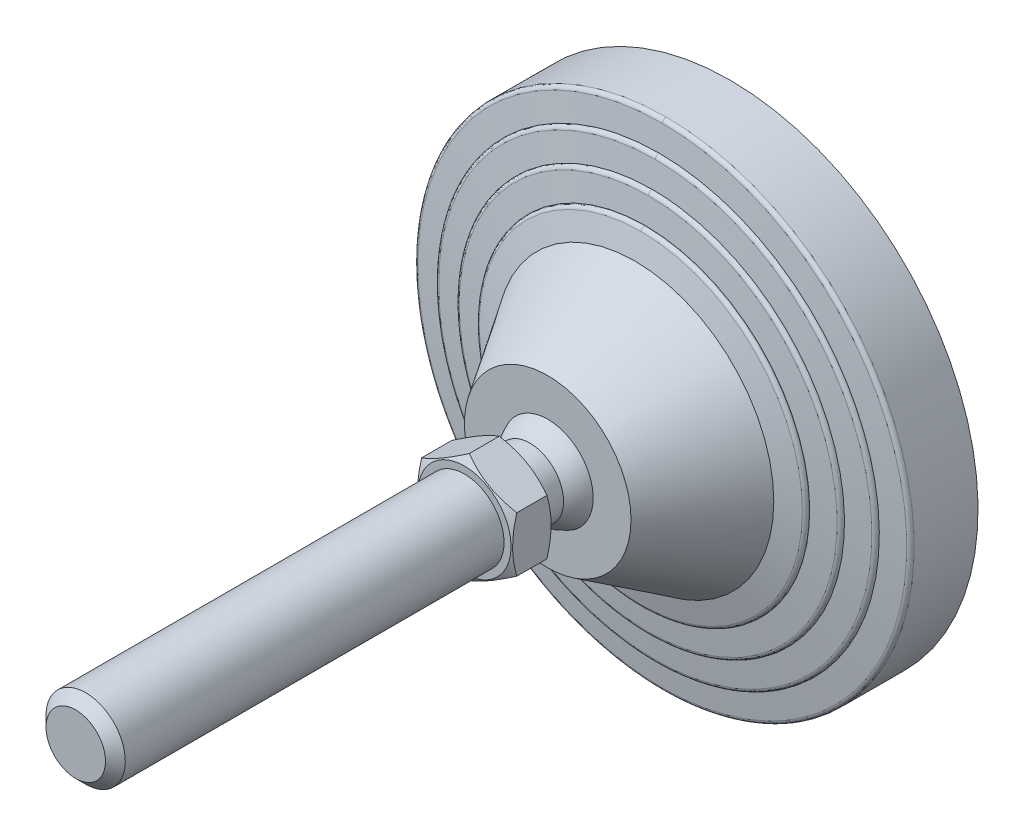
ISO-10303-21;
HEADER;
FILE_DESCRIPTION(('STEP AP214'),'2;1');
FILE_NAME('part.step','',(''),(''),'','','');
FILE_SCHEMA(('AUTOMOTIVE_DESIGN { 1 0 10303 214 1 1 1 1 }'));
ENDSEC;
DATA;
#1=APPLICATION_CONTEXT('core data for automotive mechanical design processes');
#2=APPLICATION_PROTOCOL_DEFINITION('international standard','automotive_design',2000,#1);
#3=PRODUCT_CONTEXT('',#1,'mechanical');
#4=PRODUCT('Part','Part','',(#3));
#5=PRODUCT_RELATED_PRODUCT_CATEGORY('part','',(#4));
#6=PRODUCT_DEFINITION_FORMATION('','',#4);
#7=PRODUCT_DEFINITION_CONTEXT('part definition',#1,'design');
#8=PRODUCT_DEFINITION('design','',#6,#7);
#9=PRODUCT_DEFINITION_SHAPE('','',#8);
#10=(LENGTH_UNIT() NAMED_UNIT(*) SI_UNIT(.MILLI.,.METRE.));
#11=(NAMED_UNIT(*) PLANE_ANGLE_UNIT() SI_UNIT($,.RADIAN.));
#12=(NAMED_UNIT(*) SI_UNIT($,.STERADIAN.) SOLID_ANGLE_UNIT());
#13=UNCERTAINTY_MEASURE_WITH_UNIT(LENGTH_MEASURE(1.E-05),#10,'distance_accuracy_value','');
#14=(GEOMETRIC_REPRESENTATION_CONTEXT(3) GLOBAL_UNCERTAINTY_ASSIGNED_CONTEXT((#13)) GLOBAL_UNIT_ASSIGNED_CONTEXT((#10,
#11,#12)) REPRESENTATION_CONTEXT('',''));
#15=CARTESIAN_POINT('',(0.,0.,0.));
#16=DIRECTION('',(0.,0.,1.));
#17=DIRECTION('',(1.,0.,0.));
#18=AXIS2_PLACEMENT_3D('',#15,#16,#17);
#19=CARTESIAN_POINT('',(-55.851524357,55.66,0.));
#20=DIRECTION('',(0.,0.,1.));
#21=DIRECTION('',(0.,-1.,0.));
#22=AXIS2_PLACEMENT_3D('',#19,#20,#21);
#23=PLANE('',#22);
#24=CARTESIAN_POINT('',(0.,0.,0.));
#25=DIRECTION('',(0.,0.,-1.));
#26=DIRECTION('',(0.,1.,0.));
#27=AXIS2_PLACEMENT_3D('',#24,#25,#26);
#28=CIRCLE('',#27,55.);
#29=CARTESIAN_POINT('',(0.,55.,0.));
#30=VERTEX_POINT('',#29);
#31=EDGE_CURVE('E250',#30,#30,#28,.F.);
#32=ORIENTED_EDGE('',*,*,#31,.F.);
#33=EDGE_LOOP('',(#32));
#34=FACE_BOUND('',#33,.T.);
#35=ADVANCED_FACE('F14',(#34),#23,.F.);
#36=CARTESIAN_POINT('',(0.,0.,3.));
#37=DIRECTION('',(0.,0.,-1.));
#38=DIRECTION('',(0.,1.,0.));
#39=AXIS2_PLACEMENT_3D('',#36,#37,#38);
#40=CYLINDRICAL_SURFACE('',#39,55.);
#41=ORIENTED_EDGE('',*,*,#31,.T.);
#42=EDGE_LOOP('',(#41));
#43=FACE_BOUND('',#42,.T.);
#44=CARTESIAN_POINT('',(0.,0.,3.));
#45=DIRECTION('',(0.,0.,-1.));
#46=DIRECTION('',(0.,1.,0.));
#47=AXIS2_PLACEMENT_3D('',#44,#45,#46);
#48=CIRCLE('',#47,55.);
#49=CARTESIAN_POINT('',(0.,55.,3.));
#50=VERTEX_POINT('',#49);
#51=EDGE_CURVE('E248',#50,#50,#48,.T.);
#52=ORIENTED_EDGE('',*,*,#51,.T.);
#53=EDGE_LOOP('',(#52));
#54=FACE_BOUND('',#53,.T.);
#55=ADVANCED_FACE('F393',(#43,#54),#40,.T.);
#56=CARTESIAN_POINT('',(-63.467641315,63.25,3.));
#57=DIRECTION('',(0.,0.,1.));
#58=DIRECTION('',(0.,-1.,0.));
#59=AXIS2_PLACEMENT_3D('',#56,#57,#58);
#60=PLANE('',#59);
#61=ORIENTED_EDGE('',*,*,#51,.F.);
#62=EDGE_LOOP('',(#61));
#63=FACE_BOUND('',#62,.T.);
#64=CARTESIAN_POINT('',(0.,0.,3.));
#65=DIRECTION('',(0.,0.,-1.));
#66=DIRECTION('',(0.,1.,0.));
#67=AXIS2_PLACEMENT_3D('',#64,#65,#66);
#68=CIRCLE('',#67,62.5);
#69=CARTESIAN_POINT('',(0.,62.5,3.));
#70=VERTEX_POINT('',#69);
#71=EDGE_CURVE('E244',#70,#70,#68,.F.);
#72=ORIENTED_EDGE('',*,*,#71,.F.);
#73=EDGE_LOOP('',(#72));
#74=FACE_BOUND('',#73,.T.);
#75=ADVANCED_FACE('F389',(#63,#74),#60,.F.);
#76=CARTESIAN_POINT('',(0.,0.,19.119206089));
#77=DIRECTION('',(0.,0.,-1.));
#78=DIRECTION('',(0.,1.,0.));
#79=AXIS2_PLACEMENT_3D('',#76,#77,#78);
#80=CYLINDRICAL_SURFACE('',#79,62.5);
#81=ORIENTED_EDGE('',*,*,#71,.T.);
#82=EDGE_LOOP('',(#81));
#83=FACE_BOUND('',#82,.T.);
#84=CARTESIAN_POINT('',(0.,0.,19.119206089));
#85=DIRECTION('',(0.,0.,1.));
#86=DIRECTION('',(0.,-1.,0.));
#87=AXIS2_PLACEMENT_3D('',#84,#85,#86);
#88=CIRCLE('',#87,62.5);
#89=CARTESIAN_POINT('',(-6.4094821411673E-09,-62.5,19.119206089));
#90=VERTEX_POINT('',#89);
#91=CARTESIAN_POINT('',(0.,62.5,19.119206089));
#92=VERTEX_POINT('',#91);
#93=EDGE_CURVE('E531',#90,#92,#88,.T.);
#94=ORIENTED_EDGE('',*,*,#93,.F.);
#95=CARTESIAN_POINT('',(0.,0.,19.119206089));
#96=DIRECTION('',(0.,0.,1.));
#97=DIRECTION('',(0.,-1.,0.));
#98=AXIS2_PLACEMENT_3D('',#95,#96,#97);
#99=CIRCLE('',#98,62.5);
#100=EDGE_CURVE('E247',#92,#90,#99,.T.);
#101=ORIENTED_EDGE('',*,*,#100,.F.);
#102=EDGE_LOOP('',(#94,#101));
#103=FACE_BOUND('',#102,.T.);
#104=ADVANCED_FACE('F392',(#83,#103),#80,.T.);
#105=CARTESIAN_POINT('',(0.,-62.5,19.119206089));
#106=CARTESIAN_POINT('',(-125.,-62.5,19.119206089));
#107=CARTESIAN_POINT('',(-125.,62.5,19.119206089));
#108=CARTESIAN_POINT('',(0.,62.5,19.119206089));
#109=CARTESIAN_POINT('',(0.,-62.5,19.647800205));
#110=CARTESIAN_POINT('',(-125.,-62.5,19.647800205));
#111=CARTESIAN_POINT('',(-125.,62.5,19.647800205));
#112=CARTESIAN_POINT('',(0.,62.5,19.647800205));
#113=CARTESIAN_POINT('',(0.,-62.150618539,20.044466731));
#114=CARTESIAN_POINT('',(-124.301237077,-62.150618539,20.044466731));
#115=CARTESIAN_POINT('',(-124.301237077,62.150618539,20.044466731));
#116=CARTESIAN_POINT('',(0.,62.150618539,20.044466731));
#117=CARTESIAN_POINT('',(0.,-61.62625428,20.111204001));
#118=CARTESIAN_POINT('',(-123.252508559,-61.6262542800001,20.111204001));
#119=CARTESIAN_POINT('',(-123.252508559,61.6262542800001,20.111204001));
#120=CARTESIAN_POINT('',(0.,61.62625428,20.111204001));
#121=(BOUNDED_SURFACE() B_SPLINE_SURFACE(3,3,((#105,#106,#107,#108),(#109,#110,#111,#112),(#113,
#114,#115,#116),(#117,#118,#119,#120)),.UNSPECIFIED.,.F.,.F.,
.F.) B_SPLINE_SURFACE_WITH_KNOTS((4,4),(4,4),(0.,1.),(0.,1.),
.UNSPECIFIED.) GEOMETRIC_REPRESENTATION_ITEM() RATIONAL_B_SPLINE_SURFACE(((1.,0.333333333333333,
0.333333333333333,1.),(0.833611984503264,0.277870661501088,0.277870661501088,0.833611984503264),
(0.833611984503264,0.277870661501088,0.277870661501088,0.833611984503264),(1.,0.333333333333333,
0.333333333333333,1.))) REPRESENTATION_ITEM('') SURFACE());
#122=CARTESIAN_POINT('',(0.,62.5,19.119206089));
#123=CARTESIAN_POINT('',(0.,62.5,19.647800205));
#124=CARTESIAN_POINT('',(0.,62.150618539,20.044466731));
#125=CARTESIAN_POINT('',(0.,61.62625428,20.111204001));
#126=(BOUNDED_CURVE() B_SPLINE_CURVE(3,(#122,#123,#124,#125),.UNSPECIFIED.,.F.,
.F.) B_SPLINE_CURVE_WITH_KNOTS((4,4),(0.,1.),
.UNSPECIFIED.) CURVE() GEOMETRIC_REPRESENTATION_ITEM() RATIONAL_B_SPLINE_CURVE((1.,
0.833611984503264,0.833611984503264,1.)) REPRESENTATION_ITEM(''));
#127=CARTESIAN_POINT('',(0.,61.6262542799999,20.1112040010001));
#128=VERTEX_POINT('',#127);
#129=EDGE_CURVE('E522',#92,#128,#126,.T.);
#130=CARTESIAN_POINT('',(0.,-62.5,19.119206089));
#131=CARTESIAN_POINT('',(0.,-62.5,19.647800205));
#132=CARTESIAN_POINT('',(0.,-62.150618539,20.044466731));
#133=CARTESIAN_POINT('',(0.,-61.62625428,20.111204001));
#134=(BOUNDED_CURVE() B_SPLINE_CURVE(3,(#130,#131,#132,#133),.UNSPECIFIED.,.F.,
.F.) B_SPLINE_CURVE_WITH_KNOTS((4,4),(0.,1.),
.UNSPECIFIED.) CURVE() GEOMETRIC_REPRESENTATION_ITEM() RATIONAL_B_SPLINE_CURVE((1.,
0.833611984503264,0.833611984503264,1.)) REPRESENTATION_ITEM(''));
#135=CARTESIAN_POINT('',(-1.89596340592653E-08,-61.6262542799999,20.1112040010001));
#136=VERTEX_POINT('',#135);
#137=EDGE_CURVE('E536',#136,#90,#134,.F.);
#138=CARTESIAN_POINT('',(0.,0.,20.1112040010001));
#139=DIRECTION('',(0.,0.,-1.));
#140=DIRECTION('',(0.,1.,0.));
#141=AXIS2_PLACEMENT_3D('',#138,#139,#140);
#142=CIRCLE('',#141,61.62625428);
#143=EDGE_CURVE('E515',#128,#136,#142,.F.);
#144=ORIENTED_EDGE('',*,*,#129,.F.);
#145=ORIENTED_EDGE('',*,*,#100,.T.);
#146=ORIENTED_EDGE('',*,*,#137,.F.);
#147=ORIENTED_EDGE('',*,*,#143,.F.);
#148=EDGE_LOOP('',(#144,#145,#146,#147));
#149=FACE_BOUND('',#148,.T.);
#150=ADVANCED_FACE('F716',(#149),#121,.T.);
#151=CARTESIAN_POINT('',(0.,62.5,19.119206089));
#152=CARTESIAN_POINT('',(125.,62.5,19.119206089));
#153=CARTESIAN_POINT('',(125.,-62.5,19.119206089));
#154=CARTESIAN_POINT('',(0.,-62.5,19.119206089));
#155=CARTESIAN_POINT('',(0.,62.5,19.647800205));
#156=CARTESIAN_POINT('',(125.,62.5,19.647800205));
#157=CARTESIAN_POINT('',(125.,-62.5,19.647800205));
#158=CARTESIAN_POINT('',(0.,-62.5,19.647800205));
#159=CARTESIAN_POINT('',(0.,62.150618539,20.044466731));
#160=CARTESIAN_POINT('',(124.301237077,62.150618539,20.044466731));
#161=CARTESIAN_POINT('',(124.301237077,-62.150618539,20.044466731));
#162=CARTESIAN_POINT('',(0.,-62.150618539,20.044466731));
#163=CARTESIAN_POINT('',(0.,61.62625428,20.111204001));
#164=CARTESIAN_POINT('',(123.252508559,61.6262542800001,20.111204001));
#165=CARTESIAN_POINT('',(123.252508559,-61.6262542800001,20.111204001));
#166=CARTESIAN_POINT('',(0.,-61.62625428,20.111204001));
#167=(BOUNDED_SURFACE() B_SPLINE_SURFACE(3,3,((#151,#152,#153,#154),(#155,#156,#157,#158),(#159,
#160,#161,#162),(#163,#164,#165,#166)),.UNSPECIFIED.,.F.,.F.,
.F.) B_SPLINE_SURFACE_WITH_KNOTS((4,4),(4,4),(0.,1.),(0.,1.),
.UNSPECIFIED.) GEOMETRIC_REPRESENTATION_ITEM() RATIONAL_B_SPLINE_SURFACE(((1.,0.333333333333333,
0.333333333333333,1.),(0.833611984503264,0.277870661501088,0.277870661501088,0.833611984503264),
(0.833611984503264,0.277870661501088,0.277870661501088,0.833611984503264),(1.,0.333333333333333,
0.333333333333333,1.))) REPRESENTATION_ITEM('') SURFACE());
#168=CARTESIAN_POINT('',(0.,0.,20.1112040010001));
#169=DIRECTION('',(0.,0.,-1.));
#170=DIRECTION('',(0.,1.,0.));
#171=AXIS2_PLACEMENT_3D('',#168,#169,#170);
#172=CIRCLE('',#171,61.62625428);
#173=EDGE_CURVE('E521',#136,#128,#172,.F.);
#174=ORIENTED_EDGE('',*,*,#93,.T.);
#175=ORIENTED_EDGE('',*,*,#129,.T.);
#176=ORIENTED_EDGE('',*,*,#173,.F.);
#177=ORIENTED_EDGE('',*,*,#137,.T.);
#178=EDGE_LOOP('',(#174,#175,#176,#177));
#179=FACE_BOUND('',#178,.T.);
#180=ADVANCED_FACE('F229',(#179),#167,.T.);
#181=CARTESIAN_POINT('',(0.,0.,20.890909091));
#182=DIRECTION('',(0.,0.,-1.));
#183=DIRECTION('',(1.,0.,0.));
#184=AXIS2_PLACEMENT_3D('',#181,#182,#183);
#185=CONICAL_SURFACE('',#184,55.5,1.44420419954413);
#186=ORIENTED_EDGE('',*,*,#143,.T.);
#187=ORIENTED_EDGE('',*,*,#173,.T.);
#188=EDGE_LOOP('',(#186,#187));
#189=FACE_BOUND('',#188,.T.);
#190=CARTESIAN_POINT('',(-1.13830957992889E-08,-55.5,20.890909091));
#191=CARTESIAN_POINT('',(0.666810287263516,-55.5000058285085,20.890909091));
#192=CARTESIAN_POINT('',(1.33362158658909,-55.4879831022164,20.890909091));
#193=CARTESIAN_POINT('',(2.66828219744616,-55.4398527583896,20.890909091));
#194=CARTESIAN_POINT('',(3.33612903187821,-55.4036764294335,20.890909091));
#195=CARTESIAN_POINT('',(4.67008368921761,-55.3072108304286,20.890909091));
#196=CARTESIAN_POINT('',(5.33619149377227,-55.2469213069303,20.890909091));
#197=CARTESIAN_POINT('',(6.66630694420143,-55.1022519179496,20.890909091));
#198=CARTESIAN_POINT('',(7.33031261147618,-55.0178537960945,20.890909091));
#199=CARTESIAN_POINT('',(8.65488946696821,-54.825094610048,20.890909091));
#200=CARTESIAN_POINT('',(9.31546019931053,-54.7167304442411,20.890909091));
#201=CARTESIAN_POINT('',(11.3032442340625,-54.3535835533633,20.890909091));
#202=CARTESIAN_POINT('',(12.6239565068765,-54.062110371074,20.890909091));
#203=CARTESIAN_POINT('',(15.2407929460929,-53.3834839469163,20.890909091));
#204=CARTESIAN_POINT('',(16.536910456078,-52.9963051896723,20.890909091));
#205=CARTESIAN_POINT('',(19.0989356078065,-52.127842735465,20.890909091));
#206=CARTESIAN_POINT('',(20.3648068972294,-51.6464516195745,20.890909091));
#207=CARTESIAN_POINT('',(22.8579438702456,-50.5924539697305,20.890909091));
#208=CARTESIAN_POINT('',(24.0852091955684,-50.0198465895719,20.890909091));
#209=CARTESIAN_POINT('',(26.6786676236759,-48.6922162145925,20.890909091));
#210=CARTESIAN_POINT('',(28.0374663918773,-47.9226902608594,20.890909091));
#211=CARTESIAN_POINT('',(30.6855194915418,-46.2718474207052,20.890909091));
#212=CARTESIAN_POINT('',(31.974765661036,-45.3905174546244,20.890909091));
#213=CARTESIAN_POINT('',(34.4745529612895,-43.5222940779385,20.890909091));
#214=CARTESIAN_POINT('',(35.6850872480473,-42.5353915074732,20.890909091));
#215=CARTESIAN_POINT('',(38.0186685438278,-40.4631409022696,20.890909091));
#216=CARTESIAN_POINT('',(39.1417181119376,-39.3777957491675,20.890909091));
#217=CARTESIAN_POINT('',(41.2923479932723,-37.1163936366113,20.890909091));
#218=CARTESIAN_POINT('',(42.3199319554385,-35.9403401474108,20.890909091));
#219=CARTESIAN_POINT('',(44.2723789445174,-33.5058382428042,20.890909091));
#220=CARTESIAN_POINT('',(45.1972412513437,-32.2473892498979,20.890909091));
#221=CARTESIAN_POINT('',(46.9376312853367,-29.6570957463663,20.890909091));
#222=CARTESIAN_POINT('',(47.7531628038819,-28.3252537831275,20.890909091));
#223=CARTESIAN_POINT('',(49.2691299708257,-25.5976050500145,20.890909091));
#224=CARTESIAN_POINT('',(49.9695658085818,-24.201798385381,20.890909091));
#225=CARTESIAN_POINT('',(51.2503706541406,-21.3561258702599,20.890909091));
#226=CARTESIAN_POINT('',(51.8307383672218,-19.9062594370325,20.890909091));
#227=CARTESIAN_POINT('',(52.8672716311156,-16.9627885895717,20.890909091));
#228=CARTESIAN_POINT('',(53.3234371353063,-15.4691841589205,20.890909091));
#229=CARTESIAN_POINT('',(54.1083272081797,-12.4488388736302,20.890909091));
#230=CARTESIAN_POINT('',(54.4370503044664,-10.9220976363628,20.890909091));
#231=CARTESIAN_POINT('',(54.964711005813,-7.84634988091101,20.890909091));
#232=CARTESIAN_POINT('',(55.1636486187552,-6.29734336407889,20.890909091));
#233=CARTESIAN_POINT('',(55.4303245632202,-3.18807153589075,20.890909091));
#234=CARTESIAN_POINT('',(55.4980623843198,-1.62780618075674,20.890909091));
#235=CARTESIAN_POINT('',(55.5018556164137,1.49288460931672,20.890909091));
#236=CARTESIAN_POINT('',(55.4379110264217,3.05331004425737,20.890909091));
#237=CARTESIAN_POINT('',(55.1787965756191,6.16319684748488,20.890909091));
#238=CARTESIAN_POINT('',(54.9836292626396,7.71265842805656,20.890909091));
#239=CARTESIAN_POINT('',(54.463459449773,10.7896325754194,20.890909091));
#240=CARTESIAN_POINT('',(54.1384569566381,12.3171451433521,20.890909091));
#241=CARTESIAN_POINT('',(53.3609336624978,15.3393372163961,20.890909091));
#242=CARTESIAN_POINT('',(52.9084149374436,16.8340172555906,20.890909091));
#243=CARTESIAN_POINT('',(51.8790738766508,19.7799443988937,20.890909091));
#244=CARTESIAN_POINT('',(51.3022515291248,21.2311914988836,20.890909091));
#245=CARTESIAN_POINT('',(50.0283709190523,24.0800097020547,20.890909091));
#246=CARTESIAN_POINT('',(49.3313064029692,25.4775780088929,20.890909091));
#247=CARTESIAN_POINT('',(47.8219174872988,28.2090226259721,20.890909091));
#248=CARTESIAN_POINT('',(47.009593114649,29.5428989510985,20.890909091));
#249=CARTESIAN_POINT('',(45.275439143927,32.137509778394,20.890909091));
#250=CARTESIAN_POINT('',(44.3536065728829,33.3982422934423,20.890909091));
#251=CARTESIAN_POINT('',(42.4069961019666,35.8375708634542,20.890909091));
#252=CARTESIAN_POINT('',(41.3822180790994,37.0161668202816,20.890909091));
#253=CARTESIAN_POINT('',(39.2371577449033,39.28269451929,20.890909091));
#254=CARTESIAN_POINT('',(38.11688550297,40.3706357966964,20.890909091));
#255=CARTESIAN_POINT('',(35.7885615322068,42.4483529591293,20.890909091));
#256=CARTESIAN_POINT('',(34.580510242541,43.4381293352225,20.890909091));
#257=CARTESIAN_POINT('',(32.5014047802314,44.999906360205,20.890909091));
#258=CARTESIAN_POINT('',(31.6521856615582,45.6012216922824,20.890909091));
#259=CARTESIAN_POINT('',(29.9212415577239,46.7552239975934,20.890909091));
#260=CARTESIAN_POINT('',(29.0395163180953,47.3079105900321,20.890909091));
#261=CARTESIAN_POINT('',(27.2463975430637,48.3628576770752,20.890909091));
#262=CARTESIAN_POINT('',(26.3350034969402,48.8651173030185,20.890909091));
#263=CARTESIAN_POINT('',(24.4853750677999,49.8176528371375,20.890909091));
#264=CARTESIAN_POINT('',(23.5471392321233,50.2679259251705,20.890909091));
#265=CARTESIAN_POINT('',(21.6468644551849,51.1150215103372,20.890909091));
#266=CARTESIAN_POINT('',(20.6848259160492,51.5118449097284,20.890909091));
#267=CARTESIAN_POINT('',(18.7400290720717,52.2507726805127,20.890909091));
#268=CARTESIAN_POINT('',(17.7572723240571,52.5928811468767,20.890909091));
#269=CARTESIAN_POINT('',(15.8636176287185,53.1929617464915,20.890909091));
#270=CARTESIAN_POINT('',(14.9542390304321,53.4557406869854,20.890909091));
#271=CARTESIAN_POINT('',(13.1232854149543,53.9344479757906,20.890909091));
#272=CARTESIAN_POINT('',(12.2017111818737,54.1503793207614,20.890909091));
#273=CARTESIAN_POINT('',(10.3487557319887,54.5348378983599,20.890909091));
#274=CARTESIAN_POINT('',(9.41737477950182,54.7033664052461,20.890909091));
#275=CARTESIAN_POINT('',(7.54728204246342,54.9925789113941,20.890909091));
#276=CARTESIAN_POINT('',(6.60857079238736,55.1132663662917,20.890909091));
#277=CARTESIAN_POINT('',(4.72616569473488,55.3064952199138,20.890909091));
#278=CARTESIAN_POINT('',(3.78247163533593,55.3790345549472,20.890909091));
#279=CARTESIAN_POINT('',(1.8925192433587,55.4758006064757,20.890909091));
#280=CARTESIAN_POINT('',(0.946260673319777,55.5000226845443,20.890909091));
#281=CARTESIAN_POINT('',(-1.66116564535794E-09,55.5,20.890909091));
#282=B_SPLINE_CURVE_WITH_KNOTS('',3,(#190,#191,#192,#193,#194,#195,#196,#197,#198,#199,#200,
#201,#202,#203,#204,#205,#206,#207,#208,#209,#210,#211,#212,#213,#214,#215,#216,#217,#218,#219,
#220,#221,#222,#223,#224,#225,#226,#227,#228,#229,#230,#231,#232,#233,#234,#235,#236,#237,#238,
#239,#240,#241,#242,#243,#244,#245,#246,#247,#248,#249,#250,#251,#252,#253,#254,#255,#256,#257,
#258,#259,#260,#261,#262,#263,#264,#265,#266,#267,#268,#269,#270,#271,#272,#273,#274,#275,#276,
#277,#278,#279,#280,#281),.UNSPECIFIED.,.F.,.F.,(4,2,2,2,2,2,2,2,2,2,2,2,2,2,2,2,2,2,2,2,2,2,2,
2,2,2,2,2,2,2,2,2,2,2,2,2,2,2,2,2,2,2,2,2,2,4),(0.,2.00032482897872,4.00636450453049,
6.01242526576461,8.02000917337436,10.0278530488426,14.081391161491,18.1360111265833,
22.1952813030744,26.2545891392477,30.9336173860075,35.6131935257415,40.2931760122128,
44.9730215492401,49.6526881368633,54.332387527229,59.0119245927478,63.6914539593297,
68.3710337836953,73.0506153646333,77.7302510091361,82.4098863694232,87.0895399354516,
91.7691935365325,96.4487562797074,101.128318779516,105.807805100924,110.487291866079,
115.167022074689,119.846751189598,124.526607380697,129.206469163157,133.885838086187,
138.565183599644,141.685351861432,144.805544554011,147.9257909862,151.046206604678,
154.166569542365,157.286698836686,160.125236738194,162.963593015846,165.801872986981,
168.63994790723,171.478144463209,174.316613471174),.UNSPECIFIED.);
#283=CARTESIAN_POINT('',(-1.1383239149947E-08,-55.5,20.895966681));
#284=VERTEX_POINT('',#283);
#285=CARTESIAN_POINT('',(-1.66118325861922E-09,55.5,20.895966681));
#286=VERTEX_POINT('',#285);
#287=EDGE_CURVE('E210',#284,#286,#282,.T.);
#288=ORIENTED_EDGE('',*,*,#287,.F.);
#289=CARTESIAN_POINT('',(-1.66117986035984E-09,55.5,20.890909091));
#290=CARTESIAN_POINT('',(-0.666810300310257,55.5000058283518,20.890909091));
#291=CARTESIAN_POINT('',(-1.33362159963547,55.4879831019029,20.890909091));
#292=CARTESIAN_POINT('',(-2.66828221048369,55.4398527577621,20.890909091));
#293=CARTESIAN_POINT('',(-3.33612904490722,55.403676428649,20.890909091));
#294=CARTESIAN_POINT('',(-4.67008370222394,55.3072108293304,20.890909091));
#295=CARTESIAN_POINT('',(-5.33619150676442,55.2469213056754,20.890909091));
#296=CARTESIAN_POINT('',(-6.66630695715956,55.1022519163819,20.890909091));
#297=CARTESIAN_POINT('',(-7.33031262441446,55.0178537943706,20.890909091));
#298=CARTESIAN_POINT('',(-8.65488947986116,54.8250946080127,20.890909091));
#299=CARTESIAN_POINT('',(-9.315460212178,54.7167304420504,20.890909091));
#300=CARTESIAN_POINT('',(-11.3032442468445,54.3535835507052,20.890909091));
#301=CARTESIAN_POINT('',(-12.62395651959,54.0621103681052,20.890909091));
#302=CARTESIAN_POINT('',(-15.2407929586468,53.3834839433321,20.890909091));
#303=CARTESIAN_POINT('',(-16.5369104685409,52.9963051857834,20.890909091));
#304=CARTESIAN_POINT('',(-19.0989356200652,52.1278427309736,20.890909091));
#305=CARTESIAN_POINT('',(-20.3648069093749,51.6464516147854,20.890909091));
#306=CARTESIAN_POINT('',(-22.8579438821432,50.5924539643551,20.890909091));
#307=CARTESIAN_POINT('',(-24.0852092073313,50.0198465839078,20.890909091));
#308=CARTESIAN_POINT('',(-26.6786676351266,48.6922162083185,20.890909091));
#309=CARTESIAN_POINT('',(-28.037466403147,47.9226902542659,20.890909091));
#310=CARTESIAN_POINT('',(-30.6855195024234,46.271847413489,20.890909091));
#311=CARTESIAN_POINT('',(-31.9747656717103,45.390517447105,20.890909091));
#312=CARTESIAN_POINT('',(-34.4745529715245,43.5222940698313,20.890909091));
#313=CARTESIAN_POINT('',(-35.6850872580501,42.5353914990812,20.890909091));
#314=CARTESIAN_POINT('',(-38.0186685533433,40.4631408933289,20.890909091));
#315=CARTESIAN_POINT('',(-39.1417181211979,39.3777957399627,20.890909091));
#316=CARTESIAN_POINT('',(-41.2923480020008,37.1163936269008,20.890909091));
#317=CARTESIAN_POINT('',(-42.3199319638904,35.9403401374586,20.890909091));
#318=CARTESIAN_POINT('',(-44.2723789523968,33.5058382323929,20.890909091));
#319=CARTESIAN_POINT('',(-45.1972412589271,32.247389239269,20.890909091));
#320=CARTESIAN_POINT('',(-46.937631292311,29.6570957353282,20.890909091));
#321=CARTESIAN_POINT('',(-47.753162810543,28.3252537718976,20.890909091));
#322=CARTESIAN_POINT('',(-49.2691299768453,25.597605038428,20.890909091));
#323=CARTESIAN_POINT('',(-49.9695658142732,24.2017983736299,20.890909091));
#324=CARTESIAN_POINT('',(-51.2503706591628,21.3561258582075,20.890909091));
#325=CARTESIAN_POINT('',(-51.8307383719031,19.9062594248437,20.890909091));
#326=CARTESIAN_POINT('',(-52.8672716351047,16.9627885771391,20.890909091));
#327=CARTESIAN_POINT('',(-53.3234371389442,15.4691841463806,20.890909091));
#328=CARTESIAN_POINT('',(-54.1083272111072,12.4488388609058,20.890909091));
#329=CARTESIAN_POINT('',(-54.437050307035,10.9220976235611,20.890909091));
#330=CARTESIAN_POINT('',(-54.9647110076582,7.84634986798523,20.890909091));
#331=CARTESIAN_POINT('',(-55.1636486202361,6.29734335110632,20.890909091));
#332=CARTESIAN_POINT('',(-55.4303245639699,3.1880715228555,20.890909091));
#333=CARTESIAN_POINT('',(-55.4980623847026,1.62780616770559,20.890909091));
#334=CARTESIAN_POINT('',(-55.5018556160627,-1.4928846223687,20.890909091));
#335=CARTESIAN_POINT('',(-55.4379110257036,-3.05331005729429,20.890909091));
#336=CARTESIAN_POINT('',(-55.1787965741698,-6.16319686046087,20.890909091));
#337=CARTESIAN_POINT('',(-54.9836292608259,-7.71265844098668,20.890909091));
#338=CARTESIAN_POINT('',(-54.4634594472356,-10.7896325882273,20.890909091));
#339=CARTESIAN_POINT('',(-54.1384569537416,-12.3171451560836,20.890909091));
#340=CARTESIAN_POINT('',(-53.3609336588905,-15.3393372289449,20.890909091));
#341=CARTESIAN_POINT('',(-52.9084149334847,-16.8340172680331,20.890909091));
#342=CARTESIAN_POINT('',(-51.8790738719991,-19.7799444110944,20.890909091));
#343=CARTESIAN_POINT('',(-51.3022515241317,-21.2311915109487,20.890909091));
#344=CARTESIAN_POINT('',(-50.0283709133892,-24.0800097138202,20.890909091));
#345=CARTESIAN_POINT('',(-49.3313063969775,-25.4775780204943,20.890909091));
#346=CARTESIAN_POINT('',(-47.8219174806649,-28.2090226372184,20.890909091));
#347=CARTESIAN_POINT('',(-47.0095931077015,-29.5428989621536,20.890909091));
#348=CARTESIAN_POINT('',(-45.2754391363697,-32.1375097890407,20.890909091));
#349=CARTESIAN_POINT('',(-44.3536065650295,-33.3982423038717,20.890909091));
#350=CARTESIAN_POINT('',(-42.4069960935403,-35.837570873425,20.890909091));
#351=CARTESIAN_POINT('',(-41.3822180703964,-37.0161668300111,20.890909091));
#352=CARTESIAN_POINT('',(-39.2371577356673,-39.2826945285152,20.890909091));
#353=CARTESIAN_POINT('',(-38.1168854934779,-40.3706358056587,20.890909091));
#354=CARTESIAN_POINT('',(-35.7885615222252,-42.4483529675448,20.890909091));
#355=CARTESIAN_POINT('',(-34.5805102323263,-43.4381293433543,20.890909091));
#356=CARTESIAN_POINT('',(-32.5014047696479,-44.9999063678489,20.890909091));
#357=CARTESIAN_POINT('',(-31.6521856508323,-45.6012216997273,20.890909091));
#358=CARTESIAN_POINT('',(-29.9212415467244,-46.7552240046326,20.890909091));
#359=CARTESIAN_POINT('',(-29.0395163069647,-47.3079105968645,20.890909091));
#360=CARTESIAN_POINT('',(-27.2463975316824,-48.3628576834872,20.890909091));
#361=CARTESIAN_POINT('',(-26.3350034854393,-48.8651173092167,20.890909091));
#362=CARTESIAN_POINT('',(-24.4853750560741,-49.8176528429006,20.890909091));
#363=CARTESIAN_POINT('',(-23.5471392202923,-50.2679259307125,20.890909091));
#364=CARTESIAN_POINT('',(-21.6468644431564,-51.1150215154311,20.890909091));
#365=CARTESIAN_POINT('',(-20.6848259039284,-51.5118449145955,20.890909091));
#366=CARTESIAN_POINT('',(-18.74002905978,-52.2507726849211,20.890909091));
#367=CARTESIAN_POINT('',(-17.7572723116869,-52.5928811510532,20.890909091));
#368=CARTESIAN_POINT('',(-15.8636176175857,-53.192961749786,20.890909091));
#369=CARTESIAN_POINT('',(-14.9542390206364,-53.4557406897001,20.890909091));
#370=CARTESIAN_POINT('',(-13.1232854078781,-53.934447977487,20.890909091));
#371=CARTESIAN_POINT('',(-12.20171117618,-54.1503793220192,20.890909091));
#372=CARTESIAN_POINT('',(-10.3487557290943,-54.5348378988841,20.890909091));
#373=CARTESIAN_POINT('',(-9.41737477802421,-54.7033664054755,20.890909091));
#374=CARTESIAN_POINT('',(-7.54728204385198,-54.9925789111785,20.890909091));
#375=CARTESIAN_POINT('',(-6.60857079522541,-55.1132663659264,20.890909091));
#376=CARTESIAN_POINT('',(-4.72616570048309,-55.3064952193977,20.890909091));
#377=CARTESIAN_POINT('',(-3.7824716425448,-55.37903455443,20.890909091));
#378=CARTESIAN_POINT('',(-1.89251925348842,-55.4758006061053,20.890909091));
#379=CARTESIAN_POINT('',(-0.946260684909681,-55.5000226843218,20.890909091));
#380=CARTESIAN_POINT('',(-1.13832350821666E-08,-55.5,20.890909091));
#381=B_SPLINE_CURVE_WITH_KNOTS('',3,(#289,#290,#291,#292,#293,#294,#295,#296,#297,#298,#299,
#300,#301,#302,#303,#304,#305,#306,#307,#308,#309,#310,#311,#312,#313,#314,#315,#316,#317,#318,
#319,#320,#321,#322,#323,#324,#325,#326,#327,#328,#329,#330,#331,#332,#333,#334,#335,#336,#337,
#338,#339,#340,#341,#342,#343,#344,#345,#346,#347,#348,#349,#350,#351,#352,#353,#354,#355,#356,
#357,#358,#359,#360,#361,#362,#363,#364,#365,#366,#367,#368,#369,#370,#371,#372,#373,#374,#375,
#376,#377,#378,#379,#380),.UNSPECIFIED.,.F.,.F.,(4,2,2,2,2,2,2,2,2,2,2,2,2,2,2,2,2,2,2,2,2,2,2,
2,2,2,2,2,2,2,2,2,2,2,2,2,2,2,2,2,2,2,2,2,2,4),(0.,2.00032482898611,4.00636450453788,
6.01242526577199,8.02000917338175,10.02785304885,14.0813911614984,18.1360111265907,
22.1952813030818,26.2545891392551,30.933617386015,35.6131935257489,40.2931760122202,
44.9730215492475,49.6526881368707,54.3323875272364,59.0119245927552,63.6914539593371,
68.3710337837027,73.0506153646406,77.7302510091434,82.4098863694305,87.0895399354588,
91.7691935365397,96.4487562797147,101.128318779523,105.807805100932,110.487291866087,
115.167022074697,119.846751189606,124.526607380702,129.206469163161,133.885838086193,
138.565183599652,141.685351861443,144.805544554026,147.92579098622,151.046206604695,
154.166569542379,157.286698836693,160.125236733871,162.96359300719,165.801872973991,
168.639947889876,171.478144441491,174.316613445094),.UNSPECIFIED.);
#382=EDGE_CURVE('E222',#286,#284,#381,.T.);
#383=ORIENTED_EDGE('',*,*,#382,.F.);
#384=EDGE_LOOP('',(#288,#383));
#385=FACE_BOUND('',#384,.T.);
#386=ADVANCED_FACE('F224',(#189,#385),#185,.T.);
#387=CARTESIAN_POINT('',(0.,-55.5,20.887804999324));
#388=CARTESIAN_POINT('',(-111.,-55.5000000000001,20.887804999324));
#389=CARTESIAN_POINT('',(-111.,55.5000000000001,20.887804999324));
#390=CARTESIAN_POINT('',(0.,55.5,20.887804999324));
#391=CARTESIAN_POINT('',(0.,-55.5,20.892211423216));
#392=CARTESIAN_POINT('',(-111.,-55.5000000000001,20.892211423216));
#393=CARTESIAN_POINT('',(-111.,55.5000000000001,20.892211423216));
#394=CARTESIAN_POINT('',(0.,55.5,20.892211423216));
#395=CARTESIAN_POINT('',(0.,-55.5,20.896617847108));
#396=CARTESIAN_POINT('',(-111.,-55.5000000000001,20.896617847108));
#397=CARTESIAN_POINT('',(-111.,55.5000000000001,20.896617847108));
#398=CARTESIAN_POINT('',(0.,55.5,20.896617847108));
#399=CARTESIAN_POINT('',(0.,-55.5,20.901024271));
#400=CARTESIAN_POINT('',(-111.,-55.5000000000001,20.901024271));
#401=CARTESIAN_POINT('',(-111.,55.5000000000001,20.901024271));
#402=CARTESIAN_POINT('',(0.,55.5,20.901024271));
#403=CARTESIAN_POINT('',(0.,-55.5,21.429618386));
#404=CARTESIAN_POINT('',(-111.,-55.5,21.429618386));
#405=CARTESIAN_POINT('',(-111.,55.5,21.429618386));
#406=CARTESIAN_POINT('',(0.,55.5,21.429618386));
#407=CARTESIAN_POINT('',(0.,-55.150618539,21.826284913));
#408=CARTESIAN_POINT('',(-110.301237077,-55.1506185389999,21.826284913));
#409=CARTESIAN_POINT('',(-110.301237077,55.1506185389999,21.826284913));
#410=CARTESIAN_POINT('',(0.,55.150618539,21.826284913));
#411=CARTESIAN_POINT('',(0.,-54.62625428,21.893022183));
#412=CARTESIAN_POINT('',(-109.252508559,-54.62625428,21.893022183));
#413=CARTESIAN_POINT('',(-109.252508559,54.62625428,21.893022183));
#414=CARTESIAN_POINT('',(0.,54.62625428,21.893022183));
#415=(BOUNDED_SURFACE() B_SPLINE_SURFACE(3,3,((#387,#388,#389,#390),(#391,#392,#393,#394),(#395,
#396,#397,#398),(#399,#400,#401,#402),(#403,#404,#405,#406),(#407,#408,#409,#410),(#411,#412,
#413,#414)),.UNSPECIFIED.,.F.,.F.,.F.) B_SPLINE_SURFACE_WITH_KNOTS((4,3,4),(4,4),(-0.01,0.,1.),
(0.,1.),.UNSPECIFIED.) GEOMETRIC_REPRESENTATION_ITEM() RATIONAL_B_SPLINE_SURFACE(((1.,
0.333333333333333,0.333333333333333,1.),(1.,0.333333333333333,0.333333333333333,1.),(1.,
0.333333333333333,0.333333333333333,1.),(1.,0.333333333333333,0.333333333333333,1.),
(0.833611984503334,0.277870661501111,0.277870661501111,0.833611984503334),(0.833611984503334,
0.277870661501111,0.277870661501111,0.833611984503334),(1.,0.333333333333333,0.333333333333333,1.))) REPRESENTATION_ITEM('') SURFACE());
#416=CARTESIAN_POINT('',(0.,55.5,20.901024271));
#417=CARTESIAN_POINT('',(0.,55.5,21.429618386));
#418=CARTESIAN_POINT('',(0.,55.150618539,21.826284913));
#419=CARTESIAN_POINT('',(0.,54.62625428,21.893022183));
#420=(BOUNDED_CURVE() B_SPLINE_CURVE(3,(#416,#417,#418,#419),.UNSPECIFIED.,.F.,
.F.) B_SPLINE_CURVE_WITH_KNOTS((4,4),(0.,1.),
.UNSPECIFIED.) CURVE() GEOMETRIC_REPRESENTATION_ITEM() RATIONAL_B_SPLINE_CURVE((1.,
0.833611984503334,0.833611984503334,1.)) REPRESENTATION_ITEM(''));
#421=CARTESIAN_POINT('',(0.,54.6262542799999,21.893022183));
#422=VERTEX_POINT('',#421);
#423=EDGE_CURVE('E213',#286,#422,#420,.T.);
#424=CARTESIAN_POINT('',(0.,-55.5,20.901024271));
#425=CARTESIAN_POINT('',(0.,-55.5,21.429618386));
#426=CARTESIAN_POINT('',(0.,-55.150618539,21.826284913));
#427=CARTESIAN_POINT('',(0.,-54.62625428,21.893022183));
#428=(BOUNDED_CURVE() B_SPLINE_CURVE(3,(#424,#425,#426,#427),.UNSPECIFIED.,.F.,
.F.) B_SPLINE_CURVE_WITH_KNOTS((4,4),(0.,1.),
.UNSPECIFIED.) CURVE() GEOMETRIC_REPRESENTATION_ITEM() RATIONAL_B_SPLINE_CURVE((1.,
0.833611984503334,0.833611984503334,1.)) REPRESENTATION_ITEM(''));
#429=CARTESIAN_POINT('',(-1.68060480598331E-08,-54.6262542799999,21.893022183));
#430=VERTEX_POINT('',#429);
#431=EDGE_CURVE('E214',#430,#284,#428,.F.);
#432=CARTESIAN_POINT('',(0.,0.,21.893022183));
#433=DIRECTION('',(0.,0.,-1.));
#434=DIRECTION('',(0.,1.,0.));
#435=AXIS2_PLACEMENT_3D('',#432,#433,#434);
#436=CIRCLE('',#435,54.62625428);
#437=EDGE_CURVE('E487',#422,#430,#436,.F.);
#438=ORIENTED_EDGE('',*,*,#423,.F.);
#439=ORIENTED_EDGE('',*,*,#382,.T.);
#440=ORIENTED_EDGE('',*,*,#431,.F.);
#441=ORIENTED_EDGE('',*,*,#437,.F.);
#442=EDGE_LOOP('',(#438,#439,#440,#441));
#443=FACE_BOUND('',#442,.T.);
#444=ADVANCED_FACE('F228',(#443),#415,.T.);
#445=CARTESIAN_POINT('',(0.,55.5,20.887804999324));
#446=CARTESIAN_POINT('',(111.,55.5000000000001,20.887804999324));
#447=CARTESIAN_POINT('',(111.,-55.5000000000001,20.887804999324));
#448=CARTESIAN_POINT('',(0.,-55.5,20.887804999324));
#449=CARTESIAN_POINT('',(0.,55.5,20.892211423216));
#450=CARTESIAN_POINT('',(111.,55.5000000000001,20.892211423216));
#451=CARTESIAN_POINT('',(111.,-55.5000000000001,20.892211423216));
#452=CARTESIAN_POINT('',(0.,-55.5,20.892211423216));
#453=CARTESIAN_POINT('',(0.,55.5,20.896617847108));
#454=CARTESIAN_POINT('',(111.,55.5000000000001,20.896617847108));
#455=CARTESIAN_POINT('',(111.,-55.5000000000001,20.896617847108));
#456=CARTESIAN_POINT('',(0.,-55.5,20.896617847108));
#457=CARTESIAN_POINT('',(0.,55.5,20.901024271));
#458=CARTESIAN_POINT('',(111.,55.5000000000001,20.901024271));
#459=CARTESIAN_POINT('',(111.,-55.5000000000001,20.901024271));
#460=CARTESIAN_POINT('',(0.,-55.5,20.901024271));
#461=CARTESIAN_POINT('',(0.,55.5,21.429618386));
#462=CARTESIAN_POINT('',(111.,55.5,21.429618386));
#463=CARTESIAN_POINT('',(111.,-55.5,21.429618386));
#464=CARTESIAN_POINT('',(0.,-55.5,21.429618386));
#465=CARTESIAN_POINT('',(0.,55.150618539,21.826284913));
#466=CARTESIAN_POINT('',(110.301237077,55.1506185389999,21.826284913));
#467=CARTESIAN_POINT('',(110.301237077,-55.1506185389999,21.826284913));
#468=CARTESIAN_POINT('',(0.,-55.150618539,21.826284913));
#469=CARTESIAN_POINT('',(0.,54.62625428,21.893022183));
#470=CARTESIAN_POINT('',(109.252508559,54.62625428,21.893022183));
#471=CARTESIAN_POINT('',(109.252508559,-54.62625428,21.893022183));
#472=CARTESIAN_POINT('',(0.,-54.62625428,21.893022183));
#473=(BOUNDED_SURFACE() B_SPLINE_SURFACE(3,3,((#445,#446,#447,#448),(#449,#450,#451,#452),(#453,
#454,#455,#456),(#457,#458,#459,#460),(#461,#462,#463,#464),(#465,#466,#467,#468),(#469,#470,
#471,#472)),.UNSPECIFIED.,.F.,.F.,.F.) B_SPLINE_SURFACE_WITH_KNOTS((4,3,4),(4,4),(-0.01,0.,1.),
(0.,1.),.UNSPECIFIED.) GEOMETRIC_REPRESENTATION_ITEM() RATIONAL_B_SPLINE_SURFACE(((1.,
0.333333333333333,0.333333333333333,1.),(1.,0.333333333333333,0.333333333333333,1.),(1.,
0.333333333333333,0.333333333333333,1.),(1.,0.333333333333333,0.333333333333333,1.),
(0.833611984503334,0.277870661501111,0.277870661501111,0.833611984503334),(0.833611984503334,
0.277870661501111,0.277870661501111,0.833611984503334),(1.,0.333333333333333,0.333333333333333,1.))) REPRESENTATION_ITEM('') SURFACE());
#474=CARTESIAN_POINT('',(0.,0.,21.893022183));
#475=DIRECTION('',(0.,0.,-1.));
#476=DIRECTION('',(0.,1.,0.));
#477=AXIS2_PLACEMENT_3D('',#474,#475,#476);
#478=CIRCLE('',#477,54.62625428);
#479=EDGE_CURVE('E493',#430,#422,#478,.F.);
#480=ORIENTED_EDGE('',*,*,#287,.T.);
#481=ORIENTED_EDGE('',*,*,#423,.T.);
#482=ORIENTED_EDGE('',*,*,#479,.F.);
#483=ORIENTED_EDGE('',*,*,#431,.T.);
#484=EDGE_LOOP('',(#480,#481,#482,#483));
#485=FACE_BOUND('',#484,.T.);
#486=ADVANCED_FACE('F194',(#485),#473,.T.);
#487=CARTESIAN_POINT('',(0.,0.,22.672727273));
#488=DIRECTION('',(0.,0.,-1.));
#489=DIRECTION('',(0.,1.,0.));
#490=AXIS2_PLACEMENT_3D('',#487,#488,#489);
#491=CONICAL_SURFACE('',#490,48.5,1.44420419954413);
#492=ORIENTED_EDGE('',*,*,#437,.T.);
#493=ORIENTED_EDGE('',*,*,#479,.T.);
#494=EDGE_LOOP('',(#492,#493));
#495=FACE_BOUND('',#494,.T.);
#496=CARTESIAN_POINT('',(-9.9473684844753E-09,-48.5,22.672727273));
#497=CARTESIAN_POINT('',(0.333415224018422,-48.4999999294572,22.672727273));
#498=CARTESIAN_POINT('',(0.666820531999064,-48.4965617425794,22.672727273));
#499=CARTESIAN_POINT('',(1.33352786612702,-48.4828103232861,22.672727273));
#500=CARTESIAN_POINT('',(1.66682987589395,-48.4724962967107,22.672727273));
#501=CARTESIAN_POINT('',(2.66872204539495,-48.4311451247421,22.672727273));
#502=CARTESIAN_POINT('',(3.33691272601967,-48.3896987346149,22.672727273));
#503=CARTESIAN_POINT('',(4.67104276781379,-48.2791827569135,22.672727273));
#504=CARTESIAN_POINT('',(5.33698191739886,-48.2101106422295,22.672727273));
#505=CARTESIAN_POINT('',(6.66612914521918,-48.0443714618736,22.672727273));
#506=CARTESIAN_POINT('',(7.32933372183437,-47.9476761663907,22.672727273));
#507=CARTESIAN_POINT('',(8.65121670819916,-47.7268868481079,22.672727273));
#508=CARTESIAN_POINT('',(9.30989445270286,-47.6027888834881,22.672727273));
#509=CARTESIAN_POINT('',(11.2942742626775,-47.1861322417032,22.672727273));
#510=CARTESIAN_POINT('',(12.6113745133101,-46.8513167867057,22.672727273));
#511=CARTESIAN_POINT('',(15.2131663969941,-46.0722804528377,22.672727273));
#512=CARTESIAN_POINT('',(16.4978453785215,-45.6280175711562,22.672727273));
#513=CARTESIAN_POINT('',(19.0268967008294,-44.632675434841,22.672727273));
#514=CARTESIAN_POINT('',(20.2712210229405,-44.0814740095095,22.672727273));
#515=CARTESIAN_POINT('',(22.709035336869,-42.8765478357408,22.672727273));
#516=CARTESIAN_POINT('',(23.9025301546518,-42.2228328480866,22.672727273));
#517=CARTESIAN_POINT('',(26.2339069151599,-40.8153372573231,22.672727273));
#518=CARTESIAN_POINT('',(27.3716102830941,-40.0612608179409,22.672727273));
#519=CARTESIAN_POINT('',(29.579465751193,-38.4599142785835,22.672727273));
#520=CARTESIAN_POINT('',(30.6496160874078,-37.612641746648,22.672727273));
#521=CARTESIAN_POINT('',(32.7144313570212,-35.8311972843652,22.672727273));
#522=CARTESIAN_POINT('',(33.7091176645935,-34.8970501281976,22.672727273));
#523=CARTESIAN_POINT('',(35.616265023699,-32.9482983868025,22.672727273));
#524=CARTESIAN_POINT('',(36.5287266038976,-31.9336943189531,22.672727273));
#525=CARTESIAN_POINT('',(38.2650470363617,-29.8311130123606,22.672727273));
#526=CARTESIAN_POINT('',(39.088895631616,-28.7431273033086,22.672727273));
#527=CARTESIAN_POINT('',(40.6420135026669,-26.5016202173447,22.672727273));
#528=CARTESIAN_POINT('',(41.3712826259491,-25.3480987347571,22.672727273));
#529=CARTESIAN_POINT('',(42.7300878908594,-22.9836659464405,22.672727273));
#530=CARTESIAN_POINT('',(43.3596192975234,-21.7727519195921,22.672727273));
#531=CARTESIAN_POINT('',(44.5144313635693,-19.3021944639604,22.672727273));
#532=CARTESIAN_POINT('',(45.0397120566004,-18.0425510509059,22.672727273));
#533=CARTESIAN_POINT('',(45.982277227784,-15.4835203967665,22.672727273));
#534=CARTESIAN_POINT('',(46.3995642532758,-14.18413409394,22.672727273));
#535=CARTESIAN_POINT('',(47.123191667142,-11.5548271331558,22.672727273));
#536=CARTESIAN_POINT('',(47.42953205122,-10.2249064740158,22.672727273));
#537=CARTESIAN_POINT('',(47.92908809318,-7.54398668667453,22.672727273));
#538=CARTESIAN_POINT('',(48.1223038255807,-6.19298757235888,22.672727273));
#539=CARTESIAN_POINT('',(48.3942372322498,-3.47951480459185,22.672727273));
#540=CARTESIAN_POINT('',(48.4729549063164,-2.11704115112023,22.672727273));
#541=CARTESIAN_POINT('',(48.5153327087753,0.609703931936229,22.672727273));
#542=CARTESIAN_POINT('',(48.4789920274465,1.97397537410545,22.672727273));
#543=CARTESIAN_POINT('',(48.291509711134,4.69460717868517,22.672727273));
#544=CARTESIAN_POINT('',(48.140368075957,6.05096754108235,22.672727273));
#545=CARTESIAN_POINT('',(47.7243611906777,8.74611604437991,22.672727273));
#546=CARTESIAN_POINT('',(47.4594974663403,10.0849044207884,22.672727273));
#547=CARTESIAN_POINT('',(46.8179296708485,12.7354096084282,22.672727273));
#548=CARTESIAN_POINT('',(46.4412256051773,14.0471264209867,22.672727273));
#549=CARTESIAN_POINT('',(45.5786575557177,16.6341561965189,22.672727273));
#550=CARTESIAN_POINT('',(45.0927941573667,17.9094693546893,22.672727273));
#551=CARTESIAN_POINT('',(44.0153602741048,20.4146329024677,22.672727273));
#552=CARTESIAN_POINT('',(43.4237897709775,21.6444832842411,22.672727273));
#553=CARTESIAN_POINT('',(42.1391318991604,24.0500069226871,22.672727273));
#554=CARTESIAN_POINT('',(41.4460420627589,25.2256788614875,22.672727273));
#555=CARTESIAN_POINT('',(39.9632836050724,27.51445475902,22.672727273));
#556=CARTESIAN_POINT('',(39.1736150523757,28.6275587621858,22.672727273));
#557=CARTESIAN_POINT('',(37.5033313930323,30.7832641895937,22.672727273));
#558=CARTESIAN_POINT('',(36.6227180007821,31.8258669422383,22.672727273));
#559=CARTESIAN_POINT('',(34.7767800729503,33.8331893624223,22.672727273));
#560=CARTESIAN_POINT('',(33.8114552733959,34.7979087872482,22.672727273));
#561=CARTESIAN_POINT('',(31.8029804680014,36.6425966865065,22.672727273));
#562=CARTESIAN_POINT('',(30.7598292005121,37.5225637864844,22.672727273));
#563=CARTESIAN_POINT('',(28.6030073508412,39.1915394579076,22.672727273));
#564=CARTESIAN_POINT('',(27.4893376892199,39.9805492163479,22.672727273));
#565=CARTESIAN_POINT('',(25.5812150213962,41.2150302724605,22.672727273));
#566=CARTESIAN_POINT('',(24.8040020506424,41.6873877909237,22.672727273));
#567=CARTESIAN_POINT('',(23.2241951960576,42.5877109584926,22.672727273));
#568=CARTESIAN_POINT('',(22.4216008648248,43.0156758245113,22.672727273));
#569=CARTESIAN_POINT('',(20.7935946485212,43.8258285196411,22.672727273));
#570=CARTESIAN_POINT('',(19.9681815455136,44.2080138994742,22.672727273));
#571=CARTESIAN_POINT('',(18.2974514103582,44.9252645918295,22.672727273));
#572=CARTESIAN_POINT('',(17.452141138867,45.2603456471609,22.672727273));
#573=CARTESIAN_POINT('',(15.744084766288,45.8824576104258,22.672727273));
#574=CARTESIAN_POINT('',(14.8813396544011,46.1694912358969,22.672727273));
#575=CARTESIAN_POINT('',(13.1412443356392,46.6945749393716,22.672727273));
#576=CARTESIAN_POINT('',(12.2638974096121,46.9326358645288,22.672727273));
#577=CARTESIAN_POINT('',(10.7597151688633,47.2957357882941,22.672727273));
#578=CARTESIAN_POINT('',(10.1358813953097,47.4333417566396,22.672727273));
#579=CARTESIAN_POINT('',(8.88335895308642,47.6837886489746,22.672727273));
#580=CARTESIAN_POINT('',(8.25467114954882,47.796633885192,22.672727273));
#581=CARTESIAN_POINT('',(6.99338768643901,47.9973988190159,22.672727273));
#582=CARTESIAN_POINT('',(6.36079236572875,48.0853206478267,22.672727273));
#583=CARTESIAN_POINT('',(5.09345547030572,48.2360176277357,22.672727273));
#584=CARTESIAN_POINT('',(4.4587178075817,48.2988256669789,22.672727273));
#585=CARTESIAN_POINT('',(3.18720376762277,48.3993639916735,22.672727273));
#586=CARTESIAN_POINT('',(2.55042721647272,48.4370920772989,22.672727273));
#587=CARTESIAN_POINT('',(1.27576743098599,48.4874158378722,22.672727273));
#588=CARTESIAN_POINT('',(0.637884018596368,48.5000070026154,22.672727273));
#589=CARTESIAN_POINT('',(-1.45164337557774E-09,48.5,22.672727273));
#590=B_SPLINE_CURVE_WITH_KNOTS('',3,(#496,#497,#498,#499,#500,#501,#502,#503,#504,#505,#506,
#507,#508,#509,#510,#511,#512,#513,#514,#515,#516,#517,#518,#519,#520,#521,#522,#523,#524,#525,
#526,#527,#528,#529,#530,#531,#532,#533,#534,#535,#536,#537,#538,#539,#540,#541,#542,#543,#544,
#545,#546,#547,#548,#549,#550,#551,#552,#553,#554,#555,#556,#557,#558,#559,#560,#561,#562,#563,
#564,#565,#566,#567,#568,#569,#570,#571,#572,#573,#574,#575,#576,#577,#578,#579,#580,#581,#582,
#583,#584,#585,#586,#587,#588,#589),.UNSPECIFIED.,.F.,.F.,(4,2,2,2,2,2,2,2,2,2,2,2,2,2,2,2,2,2,
2,2,2,2,2,2,2,2,2,2,2,2,2,2,2,2,2,2,2,2,2,2,2,2,2,2,2,2,4),(0.,1.00020813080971,2.0005318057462,
4.00833049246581,6.01631288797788,8.0263547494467,10.0366859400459,14.1084255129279,
18.1817301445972,22.2597159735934,26.3373137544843,30.4272089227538,34.5172108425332,
38.6060499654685,42.6948627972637,46.7841484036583,50.8734406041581,54.9629268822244,
59.0524118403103,63.141800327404,67.2311889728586,71.3205749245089,75.4099608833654,
79.4993756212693,83.5887903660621,87.6781502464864,91.7675099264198,95.8568476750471,
99.9461861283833,104.035624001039,108.125058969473,112.214416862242,116.303787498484,
120.393224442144,124.482608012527,127.209786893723,129.937013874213,132.664386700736,
135.390845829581,138.11715069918,140.842851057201,142.758881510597,144.674578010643,
146.590110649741,148.503126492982,150.416310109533,152.329836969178),.UNSPECIFIED.);
#591=CARTESIAN_POINT('',(-9.94750910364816E-09,-48.5,22.677784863));
#592=VERTEX_POINT('',#591);
#593=CARTESIAN_POINT('',(-1.45166365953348E-09,48.5,22.677784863));
#594=VERTEX_POINT('',#593);
#595=EDGE_CURVE('E168',#592,#594,#590,.T.);
#596=ORIENTED_EDGE('',*,*,#595,.F.);
#597=CARTESIAN_POINT('',(-1.45166167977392E-09,48.5,22.672727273));
#598=CARTESIAN_POINT('',(-0.333415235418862,48.4999999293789,22.672727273));
#599=CARTESIAN_POINT('',(-0.666820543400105,48.4965617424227,22.672727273));
#600=CARTESIAN_POINT('',(-1.33352787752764,48.4828103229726,22.672727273));
#601=CARTESIAN_POINT('',(-1.66682988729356,48.4724962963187,22.672727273));
#602=CARTESIAN_POINT('',(-2.66872205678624,48.4311451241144,22.672727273));
#603=CARTESIAN_POINT('',(-3.33691273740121,48.38969873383,22.672727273));
#604=CARTESIAN_POINT('',(-4.67104277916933,48.2791827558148,22.672727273));
#605=CARTESIAN_POINT('',(-5.33698192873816,48.2101106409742,22.672727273));
#606=CARTESIAN_POINT('',(-6.6661291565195,48.0443714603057,22.672727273));
#607=CARTESIAN_POINT('',(-7.32933373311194,47.9476761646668,22.672727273));
#608=CARTESIAN_POINT('',(-8.65121671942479,47.7268868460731,22.672727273));
#609=CARTESIAN_POINT('',(-9.3098944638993,47.6027888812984,22.672727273));
#610=CARTESIAN_POINT('',(-11.2942742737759,47.1861322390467,22.672727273));
#611=CARTESIAN_POINT('',(-12.6113745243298,46.8513167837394,22.672727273));
#612=CARTESIAN_POINT('',(-15.2131664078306,46.0722804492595,22.672727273));
#613=CARTESIAN_POINT('',(-16.4978453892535,45.6280175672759,22.672727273));
#614=CARTESIAN_POINT('',(-19.0268967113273,44.6326754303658,22.672727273));
#615=CARTESIAN_POINT('',(-20.2712210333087,44.0814740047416,22.672727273));
#616=CARTESIAN_POINT('',(-22.7090353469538,42.8765478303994,22.672727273));
#617=CARTESIAN_POINT('',(-23.9025301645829,42.2228328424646,22.672727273));
#618=CARTESIAN_POINT('',(-26.2339069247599,40.8153372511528,22.672727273));
#619=CARTESIAN_POINT('',(-27.3716102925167,40.0612608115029,22.672727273));
#620=CARTESIAN_POINT('',(-29.579465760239,38.4599142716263,22.672727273));
#621=CARTESIAN_POINT('',(-30.6496160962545,37.6126417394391,22.672727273));
#622=CARTESIAN_POINT('',(-32.714431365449,35.8311972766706,22.672727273));
#623=CARTESIAN_POINT('',(-33.7091176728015,34.8970501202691,22.672727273));
#624=CARTESIAN_POINT('',(-35.6162650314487,32.9482983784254,22.672727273));
#625=CARTESIAN_POINT('',(-36.5287266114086,31.9336943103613,22.672727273));
#626=CARTESIAN_POINT('',(-38.2650470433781,29.8311130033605,22.672727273));
#627=CARTESIAN_POINT('',(-39.0888956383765,28.7431272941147,22.672727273));
#628=CARTESIAN_POINT('',(-40.6420135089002,26.5016202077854,22.672727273));
#629=CARTESIAN_POINT('',(-41.3712826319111,25.3480987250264,22.672727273));
#630=CARTESIAN_POINT('',(-42.7300878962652,22.9836659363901,22.672727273));
#631=CARTESIAN_POINT('',(-43.3596193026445,21.7727519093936,22.672727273));
#632=CARTESIAN_POINT('',(-44.5144313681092,19.3021944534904,22.672727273));
#633=CARTESIAN_POINT('',(-45.0397120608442,18.0425510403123,22.672727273));
#634=CARTESIAN_POINT('',(-45.9822772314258,15.4835203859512,22.672727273));
#635=CARTESIAN_POINT('',(-46.3995642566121,14.1841340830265,22.672727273));
#636=CARTESIAN_POINT('',(-47.1231916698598,11.5548271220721,22.672727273));
#637=CARTESIAN_POINT('',(-47.4295320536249,10.2249064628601,22.672727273));
#638=CARTESIAN_POINT('',(-47.9290880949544,7.54398667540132,22.672727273));
#639=CARTESIAN_POINT('',(-48.1223038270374,6.19298756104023,22.672727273));
#640=CARTESIAN_POINT('',(-48.3942372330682,3.47951479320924,22.672727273));
#641=CARTESIAN_POINT('',(-48.4729549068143,2.11704113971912,22.672727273));
#642=CARTESIAN_POINT('',(-48.5153327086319,-0.609703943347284,22.672727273));
#643=CARTESIAN_POINT('',(-48.4789920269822,-1.97397538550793,22.672727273));
#644=CARTESIAN_POINT('',(-48.2915097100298,-4.6946071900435,22.672727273));
#645=CARTESIAN_POINT('',(-48.1403680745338,-6.0509675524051,22.672727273));
#646=CARTESIAN_POINT('',(-47.7243611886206,-8.74611605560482,22.672727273));
#647=CARTESIAN_POINT('',(-47.4594974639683,-10.0849044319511,22.672727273));
#648=CARTESIAN_POINT('',(-46.817929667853,-12.73540961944,22.672727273));
#649=CARTESIAN_POINT('',(-46.4412256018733,-14.04712643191,22.672727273));
#650=CARTESIAN_POINT('',(-45.5786575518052,-16.6341562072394,22.672727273));
#651=CARTESIAN_POINT('',(-45.0927941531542,-17.9094693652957,22.672727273));
#652=CARTESIAN_POINT('',(-44.0153602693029,-20.4146329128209,22.672727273));
#653=CARTESIAN_POINT('',(-43.4237897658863,-21.6444832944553,22.672727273));
#654=CARTESIAN_POINT('',(-42.1391318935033,-24.0500069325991,22.672727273));
#655=CARTESIAN_POINT('',(-41.4460420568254,-25.2256788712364,22.672727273));
#656=CARTESIAN_POINT('',(-39.9632835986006,-27.5144547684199,22.672727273));
#657=CARTESIAN_POINT('',(-39.1736150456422,-28.6275587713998,22.672727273));
#658=CARTESIAN_POINT('',(-37.5033313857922,-30.7832641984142,22.672727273));
#659=CARTESIAN_POINT('',(-36.6227179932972,-31.8258669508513,22.672727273));
#660=CARTESIAN_POINT('',(-34.7767800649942,-33.8331893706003,22.672727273));
#661=CARTESIAN_POINT('',(-33.8114552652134,-34.7979087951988,22.672727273));
#662=CARTESIAN_POINT('',(-31.802980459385,-36.6425966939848,22.672727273));
#663=CARTESIAN_POINT('',(-30.7598291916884,-37.5225637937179,22.672727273));
#664=CARTESIAN_POINT('',(-28.6030073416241,-39.1915394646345,22.672727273));
#665=CARTESIAN_POINT('',(-27.4893376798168,-39.9805492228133,22.672727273));
#666=CARTESIAN_POINT('',(-25.581215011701,-41.2150302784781,22.672727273));
#667=CARTESIAN_POINT('',(-24.8040020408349,-41.6873877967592,22.672727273));
#668=CARTESIAN_POINT('',(-23.2241951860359,-42.5877109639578,22.672727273));
#669=CARTESIAN_POINT('',(-22.4216008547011,-43.0156758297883,22.672727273));
#670=CARTESIAN_POINT('',(-20.7935946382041,-43.8258285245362,22.672727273));
#671=CARTESIAN_POINT('',(-19.968181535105,-44.2080139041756,22.672727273));
#672=CARTESIAN_POINT('',(-18.2974513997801,-44.9252645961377,22.672727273));
#673=CARTESIAN_POINT('',(-17.452141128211,-45.2603456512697,22.672727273));
#674=CARTESIAN_POINT('',(-15.7440847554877,-45.8824576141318,22.672727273));
#675=CARTESIAN_POINT('',(-14.8813396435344,-46.1694912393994,22.672727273));
#676=CARTESIAN_POINT('',(-13.1412443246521,-46.6945749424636,22.672727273));
#677=CARTESIAN_POINT('',(-12.2638973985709,-46.9326358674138,22.672727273));
#678=CARTESIAN_POINT('',(-10.7597151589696,-47.2957357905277,22.672727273));
#679=CARTESIAN_POINT('',(-10.1358813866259,-47.4333417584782,22.672727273));
#680=CARTESIAN_POINT('',(-8.88335894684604,-47.6837886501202,22.672727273));
#681=CARTESIAN_POINT('',(-8.25467114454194,-47.7966338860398,22.672727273));
#682=CARTESIAN_POINT('',(-6.99338768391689,-47.9973988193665,22.672727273));
#683=CARTESIAN_POINT('',(-6.36079236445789,-48.085320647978,22.672727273));
#684=CARTESIAN_POINT('',(-5.09345547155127,-48.2360176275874,22.672727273));
#685=CARTESIAN_POINT('',(-4.4587178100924,-48.2988256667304,22.672727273));
#686=CARTESIAN_POINT('',(-3.18720377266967,-48.3993639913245,22.672727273));
#687=CARTESIAN_POINT('',(-2.55042722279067,-48.4370920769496,22.672727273));
#688=CARTESIAN_POINT('',(-1.27576743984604,-48.4874158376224,22.672727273));
#689=CARTESIAN_POINT('',(-0.637884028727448,-48.5000070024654,22.672727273));
#690=CARTESIAN_POINT('',(-9.94751408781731E-09,-48.5,22.672727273));
#691=B_SPLINE_CURVE_WITH_KNOTS('',3,(#597,#598,#599,#600,#601,#602,#603,#604,#605,#606,#607,
#608,#609,#610,#611,#612,#613,#614,#615,#616,#617,#618,#619,#620,#621,#622,#623,#624,#625,#626,
#627,#628,#629,#630,#631,#632,#633,#634,#635,#636,#637,#638,#639,#640,#641,#642,#643,#644,#645,
#646,#647,#648,#649,#650,#651,#652,#653,#654,#655,#656,#657,#658,#659,#660,#661,#662,#663,#664,
#665,#666,#667,#668,#669,#670,#671,#672,#673,#674,#675,#676,#677,#678,#679,#680,#681,#682,#683,
#684,#685,#686,#687,#688,#689,#690),.UNSPECIFIED.,.F.,.F.,(4,2,2,2,2,2,2,2,2,2,2,2,2,2,2,2,2,2,
2,2,2,2,2,2,2,2,2,2,2,2,2,2,2,2,2,2,2,2,2,2,2,2,2,2,2,2,4),(0.,1.00020813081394,
2.00053180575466,4.00833049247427,6.01631288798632,8.02635474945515,10.0366859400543,
14.1084255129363,18.1817301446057,22.2597159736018,26.3373137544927,30.4272089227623,
34.5172108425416,38.6060499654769,42.6948627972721,46.7841484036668,50.8734406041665,
54.9629268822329,59.0524118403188,63.1418003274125,67.2311889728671,71.3205749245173,
75.4099608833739,79.4993756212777,83.5887903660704,87.6781502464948,91.7675099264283,
95.856847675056,99.9461861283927,104.035624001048,108.125058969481,112.214416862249,
116.303787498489,120.393224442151,124.482608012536,127.209786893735,129.93701387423,
132.664386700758,135.3908458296,138.117150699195,140.84285105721,142.758881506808,
144.674578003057,146.590110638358,148.503126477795,150.416310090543,152.329836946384),.UNSPECIFIED.);
#692=EDGE_CURVE('E181',#594,#592,#691,.T.);
#693=ORIENTED_EDGE('',*,*,#692,.F.);
#694=EDGE_LOOP('',(#596,#693));
#695=FACE_BOUND('',#694,.T.);
#696=ADVANCED_FACE('F189',(#495,#695),#491,.T.);
#697=CARTESIAN_POINT('',(0.,-48.5,22.669623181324));
#698=CARTESIAN_POINT('',(-97.,-48.5,22.669623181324));
#699=CARTESIAN_POINT('',(-97.,48.5,22.669623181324));
#700=CARTESIAN_POINT('',(0.,48.5,22.669623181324));
#701=CARTESIAN_POINT('',(0.,-48.5,22.6740296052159));
#702=CARTESIAN_POINT('',(-97.,-48.5,22.674029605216));
#703=CARTESIAN_POINT('',(-97.,48.5,22.674029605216));
#704=CARTESIAN_POINT('',(0.,48.5,22.6740296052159));
#705=CARTESIAN_POINT('',(0.,-48.5,22.678436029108));
#706=CARTESIAN_POINT('',(-97.,-48.5,22.678436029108));
#707=CARTESIAN_POINT('',(-97.,48.5,22.678436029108));
#708=CARTESIAN_POINT('',(0.,48.5,22.678436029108));
#709=CARTESIAN_POINT('',(0.,-48.5,22.682842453));
#710=CARTESIAN_POINT('',(-97.,-48.5,22.682842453));
#711=CARTESIAN_POINT('',(-97.,48.5,22.682842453));
#712=CARTESIAN_POINT('',(0.,48.5,22.682842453));
#713=CARTESIAN_POINT('',(0.,-48.5,23.211436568));
#714=CARTESIAN_POINT('',(-97.0000000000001,-48.5,23.211436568));
#715=CARTESIAN_POINT('',(-97.0000000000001,48.5,23.211436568));
#716=CARTESIAN_POINT('',(0.,48.5,23.211436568));
#717=CARTESIAN_POINT('',(0.,-48.150618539,23.608103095));
#718=CARTESIAN_POINT('',(-96.3012370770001,-48.150618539,23.608103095));
#719=CARTESIAN_POINT('',(-96.3012370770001,48.150618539,23.608103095));
#720=CARTESIAN_POINT('',(0.,48.150618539,23.608103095));
#721=CARTESIAN_POINT('',(0.,-47.62625428,23.674840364));
#722=CARTESIAN_POINT('',(-95.252508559,-47.6262542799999,23.674840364));
#723=CARTESIAN_POINT('',(-95.252508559,47.6262542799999,23.674840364));
#724=CARTESIAN_POINT('',(0.,47.62625428,23.674840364));
#725=(BOUNDED_SURFACE() B_SPLINE_SURFACE(3,3,((#697,#698,#699,#700),(#701,#702,#703,#704),(#705,
#706,#707,#708),(#709,#710,#711,#712),(#713,#714,#715,#716),(#717,#718,#719,#720),(#721,#722,
#723,#724)),.UNSPECIFIED.,.F.,.F.,.F.) B_SPLINE_SURFACE_WITH_KNOTS((4,3,4),(4,4),(-0.01,0.,1.),
(0.,1.),.UNSPECIFIED.) GEOMETRIC_REPRESENTATION_ITEM() RATIONAL_B_SPLINE_SURFACE(((1.,
0.333333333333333,0.333333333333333,1.),(1.,0.333333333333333,0.333333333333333,1.),(1.,
0.333333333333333,0.333333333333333,1.),(1.,0.333333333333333,0.333333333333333,1.),
(0.833611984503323,0.277870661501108,0.277870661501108,0.833611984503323),(0.833611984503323,
0.277870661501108,0.277870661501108,0.833611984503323),(1.,0.333333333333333,0.333333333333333,1.))) REPRESENTATION_ITEM('') SURFACE());
#726=CARTESIAN_POINT('',(0.,48.5,22.682842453));
#727=CARTESIAN_POINT('',(0.,48.5,23.211436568));
#728=CARTESIAN_POINT('',(0.,48.150618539,23.608103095));
#729=CARTESIAN_POINT('',(0.,47.62625428,23.674840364));
#730=(BOUNDED_CURVE() B_SPLINE_CURVE(3,(#726,#727,#728,#729),.UNSPECIFIED.,.F.,
.F.) B_SPLINE_CURVE_WITH_KNOTS((4,4),(0.,1.),
.UNSPECIFIED.) CURVE() GEOMETRIC_REPRESENTATION_ITEM() RATIONAL_B_SPLINE_CURVE((1.,
0.833611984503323,0.833611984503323,1.)) REPRESENTATION_ITEM(''));
#731=CARTESIAN_POINT('',(0.,47.6262542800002,23.674840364));
#732=VERTEX_POINT('',#731);
#733=EDGE_CURVE('E171',#594,#732,#730,.T.);
#734=CARTESIAN_POINT('',(0.,-48.5,22.682842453));
#735=CARTESIAN_POINT('',(0.,-48.5,23.211436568));
#736=CARTESIAN_POINT('',(0.,-48.150618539,23.608103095));
#737=CARTESIAN_POINT('',(0.,-47.62625428,23.674840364));
#738=(BOUNDED_CURVE() B_SPLINE_CURVE(3,(#734,#735,#736,#737),.UNSPECIFIED.,.F.,
.F.) B_SPLINE_CURVE_WITH_KNOTS((4,4),(0.,1.),
.UNSPECIFIED.) CURVE() GEOMETRIC_REPRESENTATION_ITEM() RATIONAL_B_SPLINE_CURVE((1.,
0.833611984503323,0.833611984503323,1.)) REPRESENTATION_ITEM(''));
#739=CARTESIAN_POINT('',(-1.4652462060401E-08,-47.6262542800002,23.674840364));
#740=VERTEX_POINT('',#739);
#741=EDGE_CURVE('E172',#740,#592,#738,.F.);
#742=CARTESIAN_POINT('',(0.,0.,23.6748403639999));
#743=DIRECTION('',(0.,0.,-1.));
#744=DIRECTION('',(0.,1.,0.));
#745=AXIS2_PLACEMENT_3D('',#742,#743,#744);
#746=CIRCLE('',#745,47.62625428);
#747=EDGE_CURVE('E452',#732,#740,#746,.F.);
#748=ORIENTED_EDGE('',*,*,#733,.F.);
#749=ORIENTED_EDGE('',*,*,#692,.T.);
#750=ORIENTED_EDGE('',*,*,#741,.F.);
#751=ORIENTED_EDGE('',*,*,#747,.F.);
#752=EDGE_LOOP('',(#748,#749,#750,#751));
#753=FACE_BOUND('',#752,.T.);
#754=ADVANCED_FACE('F193',(#753),#725,.T.);
#755=CARTESIAN_POINT('',(0.,48.5,22.669623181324));
#756=CARTESIAN_POINT('',(97.,48.5,22.669623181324));
#757=CARTESIAN_POINT('',(97.,-48.5,22.669623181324));
#758=CARTESIAN_POINT('',(0.,-48.5,22.669623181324));
#759=CARTESIAN_POINT('',(0.,48.5,22.6740296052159));
#760=CARTESIAN_POINT('',(97.,48.5,22.674029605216));
#761=CARTESIAN_POINT('',(97.,-48.5,22.674029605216));
#762=CARTESIAN_POINT('',(0.,-48.5,22.6740296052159));
#763=CARTESIAN_POINT('',(0.,48.5,22.678436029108));
#764=CARTESIAN_POINT('',(97.,48.5,22.678436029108));
#765=CARTESIAN_POINT('',(97.,-48.5,22.678436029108));
#766=CARTESIAN_POINT('',(0.,-48.5,22.678436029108));
#767=CARTESIAN_POINT('',(0.,48.5,22.682842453));
#768=CARTESIAN_POINT('',(97.,48.5,22.682842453));
#769=CARTESIAN_POINT('',(97.,-48.5,22.682842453));
#770=CARTESIAN_POINT('',(0.,-48.5,22.682842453));
#771=CARTESIAN_POINT('',(0.,48.5,23.211436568));
#772=CARTESIAN_POINT('',(97.0000000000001,48.5,23.211436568));
#773=CARTESIAN_POINT('',(97.0000000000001,-48.5,23.211436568));
#774=CARTESIAN_POINT('',(0.,-48.5,23.211436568));
#775=CARTESIAN_POINT('',(0.,48.150618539,23.608103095));
#776=CARTESIAN_POINT('',(96.3012370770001,48.150618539,23.608103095));
#777=CARTESIAN_POINT('',(96.3012370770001,-48.150618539,23.608103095));
#778=CARTESIAN_POINT('',(0.,-48.150618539,23.608103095));
#779=CARTESIAN_POINT('',(0.,47.62625428,23.674840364));
#780=CARTESIAN_POINT('',(95.252508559,47.6262542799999,23.674840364));
#781=CARTESIAN_POINT('',(95.252508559,-47.6262542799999,23.674840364));
#782=CARTESIAN_POINT('',(0.,-47.62625428,23.674840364));
#783=(BOUNDED_SURFACE() B_SPLINE_SURFACE(3,3,((#755,#756,#757,#758),(#759,#760,#761,#762),(#763,
#764,#765,#766),(#767,#768,#769,#770),(#771,#772,#773,#774),(#775,#776,#777,#778),(#779,#780,
#781,#782)),.UNSPECIFIED.,.F.,.F.,.F.) B_SPLINE_SURFACE_WITH_KNOTS((4,3,4),(4,4),(-0.01,0.,1.),
(0.,1.),.UNSPECIFIED.) GEOMETRIC_REPRESENTATION_ITEM() RATIONAL_B_SPLINE_SURFACE(((1.,
0.333333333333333,0.333333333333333,1.),(1.,0.333333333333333,0.333333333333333,1.),(1.,
0.333333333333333,0.333333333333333,1.),(1.,0.333333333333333,0.333333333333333,1.),
(0.833611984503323,0.277870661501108,0.277870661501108,0.833611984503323),(0.833611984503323,
0.277870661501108,0.277870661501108,0.833611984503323),(1.,0.333333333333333,0.333333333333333,1.))) REPRESENTATION_ITEM('') SURFACE());
#784=CARTESIAN_POINT('',(0.,0.,23.6748403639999));
#785=DIRECTION('',(0.,0.,-1.));
#786=DIRECTION('',(0.,1.,0.));
#787=AXIS2_PLACEMENT_3D('',#784,#785,#786);
#788=CIRCLE('',#787,47.62625428);
#789=EDGE_CURVE('E458',#740,#732,#788,.F.);
#790=ORIENTED_EDGE('',*,*,#595,.T.);
#791=ORIENTED_EDGE('',*,*,#733,.T.);
#792=ORIENTED_EDGE('',*,*,#789,.F.);
#793=ORIENTED_EDGE('',*,*,#741,.T.);
#794=EDGE_LOOP('',(#790,#791,#792,#793));
#795=FACE_BOUND('',#794,.T.);
#796=ADVANCED_FACE('F183',(#795),#783,.T.);
#797=CARTESIAN_POINT('',(0.,0.,24.454545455));
#798=DIRECTION('',(0.,0.,-1.));
#799=DIRECTION('',(0.,1.,0.));
#800=AXIS2_PLACEMENT_3D('',#797,#798,#799);
#801=CONICAL_SURFACE('',#800,41.5,1.4442041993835);
#802=ORIENTED_EDGE('',*,*,#747,.T.);
#803=ORIENTED_EDGE('',*,*,#789,.T.);
#804=EDGE_LOOP('',(#802,#803));
#805=FACE_BOUND('',#804,.T.);
#806=CARTESIAN_POINT('',(0.,0.,24.454545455));
#807=DIRECTION('',(0.,0.,-1.));
#808=DIRECTION('',(0.,1.,0.));
#809=AXIS2_PLACEMENT_3D('',#806,#807,#808);
#810=CIRCLE('',#809,41.5);
#811=CARTESIAN_POINT('',(0.,41.5,24.454545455));
#812=VERTEX_POINT('',#811);
#813=EDGE_CURVE('E456',#812,#812,#810,.F.);
#814=ORIENTED_EDGE('',*,*,#813,.F.);
#815=EDGE_LOOP('',(#814));
#816=FACE_BOUND('',#815,.T.);
#817=ADVANCED_FACE('F440',(#805,#816),#801,.T.);
#818=CARTESIAN_POINT('',(0.,0.,24.568111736));
#819=DIRECTION('',(0.,0.,-1.));
#820=DIRECTION('',(0.,1.,0.));
#821=AXIS2_PLACEMENT_3D('',#818,#819,#820);
#822=CYLINDRICAL_SURFACE('',#821,41.5);
#823=ORIENTED_EDGE('',*,*,#813,.T.);
#824=EDGE_LOOP('',(#823));
#825=FACE_BOUND('',#824,.T.);
#826=CARTESIAN_POINT('',(0.,0.,24.568111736));
#827=DIRECTION('',(0.,0.,1.));
#828=DIRECTION('',(0.,-1.,0.));
#829=AXIS2_PLACEMENT_3D('',#826,#827,#828);
#830=CIRCLE('',#829,41.5);
#831=CARTESIAN_POINT('',(-4.25589614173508E-09,-41.5,24.568111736));
#832=VERTEX_POINT('',#831);
#833=CARTESIAN_POINT('',(0.,41.5,24.568111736));
#834=VERTEX_POINT('',#833);
#835=EDGE_CURVE('E596',#832,#834,#830,.T.);
#836=ORIENTED_EDGE('',*,*,#835,.F.);
#837=CARTESIAN_POINT('',(0.,0.,24.568111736));
#838=DIRECTION('',(0.,0.,1.));
#839=DIRECTION('',(0.,-1.,0.));
#840=AXIS2_PLACEMENT_3D('',#837,#838,#839);
#841=CIRCLE('',#840,41.5);
#842=EDGE_CURVE('E457',#834,#832,#841,.T.);
#843=ORIENTED_EDGE('',*,*,#842,.F.);
#844=EDGE_LOOP('',(#836,#843));
#845=FACE_BOUND('',#844,.T.);
#846=ADVANCED_FACE('F432',(#825,#845),#822,.T.);
#847=CARTESIAN_POINT('',(0.,-41.5,24.568111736));
#848=CARTESIAN_POINT('',(-83.,-41.5,24.568111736));
#849=CARTESIAN_POINT('',(-83.,41.5,24.568111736));
#850=CARTESIAN_POINT('',(0.,41.5,24.568111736));
#851=CARTESIAN_POINT('',(0.,-41.5,25.044046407));
#852=CARTESIAN_POINT('',(-83.0000000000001,-41.5,25.044046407));
#853=CARTESIAN_POINT('',(-83.0000000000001,41.5,25.044046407));
#854=CARTESIAN_POINT('',(0.,41.5,25.044046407));
#855=CARTESIAN_POINT('',(0.,-41.207906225,25.419805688));
#856=CARTESIAN_POINT('',(-82.4158124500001,-41.207906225,25.419805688));
#857=CARTESIAN_POINT('',(-82.4158124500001,41.207906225,25.419805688));
#858=CARTESIAN_POINT('',(0.,41.207906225,25.419805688));
#859=CARTESIAN_POINT('',(0.,-40.746679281,25.53720891));
#860=CARTESIAN_POINT('',(-81.493358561,-40.746679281,25.53720891));
#861=CARTESIAN_POINT('',(-81.493358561,40.746679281,25.53720891));
#862=CARTESIAN_POINT('',(0.,40.746679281,25.53720891));
#863=(BOUNDED_SURFACE() B_SPLINE_SURFACE(3,3,((#847,#848,#849,#850),(#851,#852,#853,#854),(#855,
#856,#857,#858),(#859,#860,#861,#862)),.UNSPECIFIED.,.F.,.F.,
.F.) B_SPLINE_SURFACE_WITH_KNOTS((4,4),(4,4),(0.,1.),(0.,1.),
.UNSPECIFIED.) GEOMETRIC_REPRESENTATION_ITEM() RATIONAL_B_SPLINE_SURFACE(((1.,0.333333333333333,
0.333333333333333,1.),(0.859679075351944,0.286559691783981,0.286559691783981,0.859679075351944),
(0.859679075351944,0.286559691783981,0.286559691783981,0.859679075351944),(1.,0.333333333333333,
0.333333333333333,1.))) REPRESENTATION_ITEM('') SURFACE());
#864=CARTESIAN_POINT('',(0.,41.5,24.568111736));
#865=CARTESIAN_POINT('',(0.,41.5,25.044046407));
#866=CARTESIAN_POINT('',(0.,41.207906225,25.419805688));
#867=CARTESIAN_POINT('',(0.,40.746679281,25.53720891));
#868=(BOUNDED_CURVE() B_SPLINE_CURVE(3,(#864,#865,#866,#867),.UNSPECIFIED.,.F.,
.F.) B_SPLINE_CURVE_WITH_KNOTS((4,4),(0.,1.),
.UNSPECIFIED.) CURVE() GEOMETRIC_REPRESENTATION_ITEM() RATIONAL_B_SPLINE_CURVE((1.,
0.859679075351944,0.859679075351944,1.)) REPRESENTATION_ITEM(''));
#869=CARTESIAN_POINT('',(0.,40.7466792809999,25.5372089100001));
#870=VERTEX_POINT('',#869);
#871=EDGE_CURVE('E587',#834,#870,#868,.T.);
#872=CARTESIAN_POINT('',(0.,-41.5,24.568111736));
#873=CARTESIAN_POINT('',(0.,-41.5,25.044046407));
#874=CARTESIAN_POINT('',(0.,-41.207906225,25.419805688));
#875=CARTESIAN_POINT('',(0.,-40.746679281,25.53720891));
#876=(BOUNDED_CURVE() B_SPLINE_CURVE(3,(#872,#873,#874,#875),.UNSPECIFIED.,.F.,
.F.) B_SPLINE_CURVE_WITH_KNOTS((4,4),(0.,1.),
.UNSPECIFIED.) CURVE() GEOMETRIC_REPRESENTATION_ITEM() RATIONAL_B_SPLINE_CURVE((1.,
0.859679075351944,0.859679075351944,1.)) REPRESENTATION_ITEM(''));
#877=CARTESIAN_POINT('',(-1.25359254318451E-08,-40.7466792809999,25.5372089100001));
#878=VERTEX_POINT('',#877);
#879=EDGE_CURVE('E460',#878,#832,#876,.F.);
#880=CARTESIAN_POINT('',(0.,0.,25.5372089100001));
#881=DIRECTION('',(0.,0.,-1.));
#882=DIRECTION('',(0.,1.,0.));
#883=AXIS2_PLACEMENT_3D('',#880,#881,#882);
#884=CIRCLE('',#883,40.746679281);
#885=EDGE_CURVE('E584',#870,#878,#884,.F.);
#886=ORIENTED_EDGE('',*,*,#871,.F.);
#887=ORIENTED_EDGE('',*,*,#842,.T.);
#888=ORIENTED_EDGE('',*,*,#879,.F.);
#889=ORIENTED_EDGE('',*,*,#885,.F.);
#890=EDGE_LOOP('',(#886,#887,#888,#889));
#891=FACE_BOUND('',#890,.T.);
#892=ADVANCED_FACE('F421',(#891),#863,.T.);
#893=CARTESIAN_POINT('',(0.,41.5,24.568111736));
#894=CARTESIAN_POINT('',(83.,41.5,24.568111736));
#895=CARTESIAN_POINT('',(83.,-41.5,24.568111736));
#896=CARTESIAN_POINT('',(0.,-41.5,24.568111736));
#897=CARTESIAN_POINT('',(0.,41.5,25.044046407));
#898=CARTESIAN_POINT('',(83.0000000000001,41.5,25.044046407));
#899=CARTESIAN_POINT('',(83.0000000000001,-41.5,25.044046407));
#900=CARTESIAN_POINT('',(0.,-41.5,25.044046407));
#901=CARTESIAN_POINT('',(0.,41.207906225,25.419805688));
#902=CARTESIAN_POINT('',(82.4158124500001,41.207906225,25.419805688));
#903=CARTESIAN_POINT('',(82.4158124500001,-41.207906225,25.419805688));
#904=CARTESIAN_POINT('',(0.,-41.207906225,25.419805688));
#905=CARTESIAN_POINT('',(0.,40.746679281,25.53720891));
#906=CARTESIAN_POINT('',(81.493358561,40.746679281,25.53720891));
#907=CARTESIAN_POINT('',(81.493358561,-40.746679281,25.53720891));
#908=CARTESIAN_POINT('',(0.,-40.746679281,25.53720891));
#909=(BOUNDED_SURFACE() B_SPLINE_SURFACE(3,3,((#893,#894,#895,#896),(#897,#898,#899,#900),(#901,
#902,#903,#904),(#905,#906,#907,#908)),.UNSPECIFIED.,.F.,.F.,
.F.) B_SPLINE_SURFACE_WITH_KNOTS((4,4),(4,4),(0.,1.),(0.,1.),
.UNSPECIFIED.) GEOMETRIC_REPRESENTATION_ITEM() RATIONAL_B_SPLINE_SURFACE(((1.,0.333333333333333,
0.333333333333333,1.),(0.859679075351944,0.286559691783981,0.286559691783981,0.859679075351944),
(0.859679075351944,0.286559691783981,0.286559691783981,0.859679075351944),(1.,0.333333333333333,
0.333333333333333,1.))) REPRESENTATION_ITEM('') SURFACE());
#910=CARTESIAN_POINT('',(0.,0.,25.5372089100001));
#911=DIRECTION('',(0.,0.,-1.));
#912=DIRECTION('',(0.,1.,0.));
#913=AXIS2_PLACEMENT_3D('',#910,#911,#912);
#914=CIRCLE('',#913,40.746679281);
#915=EDGE_CURVE('E583',#878,#870,#914,.F.);
#916=ORIENTED_EDGE('',*,*,#835,.T.);
#917=ORIENTED_EDGE('',*,*,#871,.T.);
#918=ORIENTED_EDGE('',*,*,#915,.F.);
#919=ORIENTED_EDGE('',*,*,#879,.T.);
#920=EDGE_LOOP('',(#916,#917,#918,#919));
#921=FACE_BOUND('',#920,.T.);
#922=ADVANCED_FACE('F415',(#921),#909,.T.);
#923=CARTESIAN_POINT('',(0.,0.,27.));
#924=DIRECTION('',(0.,0.,-1.));
#925=DIRECTION('',(1.,0.,0.));
#926=AXIS2_PLACEMENT_3D('',#923,#924,#925);
#927=CONICAL_SURFACE('',#926,35.,1.32154418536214);
#928=ORIENTED_EDGE('',*,*,#885,.T.);
#929=ORIENTED_EDGE('',*,*,#915,.T.);
#930=EDGE_LOOP('',(#928,#929));
#931=FACE_BOUND('',#930,.T.);
#932=CARTESIAN_POINT('',(0.,0.,27.));
#933=DIRECTION('',(0.,0.,-1.));
#934=DIRECTION('',(0.,1.,0.));
#935=AXIS2_PLACEMENT_3D('',#932,#933,#934);
#936=CIRCLE('',#935,35.);
#937=CARTESIAN_POINT('',(0.,35.,27.0000000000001));
#938=VERTEX_POINT('',#937);
#939=EDGE_CURVE('E167',#938,#938,#936,.F.);
#940=ORIENTED_EDGE('',*,*,#939,.F.);
#941=EDGE_LOOP('',(#940));
#942=FACE_BOUND('',#941,.T.);
#943=ADVANCED_FACE('F411',(#931,#942),#927,.T.);
#944=CARTESIAN_POINT('',(0.,0.,49.));
#945=DIRECTION('',(0.,0.,-1.));
#946=DIRECTION('',(1.,0.,0.));
#947=AXIS2_PLACEMENT_3D('',#944,#945,#946);
#948=CONICAL_SURFACE('',#947,21.,0.566729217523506);
#949=ORIENTED_EDGE('',*,*,#939,.T.);
#950=EDGE_LOOP('',(#949));
#951=FACE_BOUND('',#950,.T.);
#952=CARTESIAN_POINT('',(0.,0.,49.));
#953=DIRECTION('',(0.,0.,-1.));
#954=DIRECTION('',(1.,0.,0.));
#955=AXIS2_PLACEMENT_3D('',#952,#953,#954);
#956=CIRCLE('',#955,21.);
#957=CARTESIAN_POINT('',(21.,0.,49.));
#958=VERTEX_POINT('',#957);
#959=EDGE_CURVE('E164',#958,#958,#956,.T.);
#960=ORIENTED_EDGE('',*,*,#959,.T.);
#961=EDGE_LOOP('',(#960));
#962=FACE_BOUND('',#961,.T.);
#963=ADVANCED_FACE('F387',(#951,#962),#948,.T.);
#964=CARTESIAN_POINT('',(-21.325127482,-21.252,49.));
#965=DIRECTION('',(0.,0.,-1.));
#966=DIRECTION('',(0.,1.,0.));
#967=AXIS2_PLACEMENT_3D('',#964,#965,#966);
#968=PLANE('',#967);
#969=CARTESIAN_POINT('',(0.,0.,49.));
#970=DIRECTION('',(0.,0.,-1.));
#971=DIRECTION('',(0.,1.,0.));
#972=AXIS2_PLACEMENT_3D('',#969,#970,#971);
#973=CIRCLE('',#972,11.4593152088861);
#974=CARTESIAN_POINT('',(0.,11.4593152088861,49.));
#975=VERTEX_POINT('',#974);
#976=EDGE_CURVE('E161',#975,#975,#973,.F.);
#977=ORIENTED_EDGE('',*,*,#976,.F.);
#978=EDGE_LOOP('',(#977));
#979=FACE_BOUND('',#978,.T.);
#980=ORIENTED_EDGE('',*,*,#959,.F.);
#981=EDGE_LOOP('',(#980));
#982=FACE_BOUND('',#981,.T.);
#983=ADVANCED_FACE('F384',(#979,#982),#968,.F.);
#984=CARTESIAN_POINT('',(0.,0.,44.670266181));
#985=DIRECTION('',(0.,0.,-1.));
#986=DIRECTION('',(1.,0.,0.));
#987=AXIS2_PLACEMENT_3D('',#984,#985,#986);
#988=SPHERICAL_SURFACE('',#987,12.25);
#989=ORIENTED_EDGE('',*,*,#976,.T.);
#990=EDGE_LOOP('',(#989));
#991=FACE_BOUND('',#990,.T.);
#992=CARTESIAN_POINT('',(0.,0.,53.5));
#993=DIRECTION('',(0.,0.,-1.));
#994=DIRECTION('',(0.,1.,0.));
#995=AXIS2_PLACEMENT_3D('',#992,#993,#994);
#996=CIRCLE('',#995,8.49107182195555);
#997=CARTESIAN_POINT('',(0.,8.49107182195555,53.5));
#998=VERTEX_POINT('',#997);
#999=EDGE_CURVE('E158',#998,#998,#996,.T.);
#1000=ORIENTED_EDGE('',*,*,#999,.T.);
#1001=EDGE_LOOP('',(#1000));
#1002=FACE_BOUND('',#1001,.T.);
#1003=ADVANCED_FACE('F382',(#991,#1002),#988,.T.);
#1004=CARTESIAN_POINT('',(-8.631599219,8.622532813,53.5));
#1005=DIRECTION('',(0.,0.,1.));
#1006=DIRECTION('',(0.,-1.,0.));
#1007=AXIS2_PLACEMENT_3D('',#1004,#1005,#1006);
#1008=PLANE('',#1007);
#1009=ORIENTED_EDGE('',*,*,#999,.F.);
#1010=EDGE_LOOP('',(#1009));
#1011=FACE_BOUND('',#1010,.T.);
#1012=CARTESIAN_POINT('',(0.,0.,53.5));
#1013=DIRECTION('',(0.,0.,-1.));
#1014=DIRECTION('',(1.,0.,0.));
#1015=AXIS2_PLACEMENT_3D('',#1012,#1013,#1014);
#1016=CIRCLE('',#1015,8.5);
#1017=CARTESIAN_POINT('',(8.5,0.,53.5));
#1018=VERTEX_POINT('',#1017);
#1019=EDGE_CURVE('E155',#1018,#1018,#1016,.F.);
#1020=ORIENTED_EDGE('',*,*,#1019,.F.);
#1021=EDGE_LOOP('',(#1020));
#1022=FACE_BOUND('',#1021,.T.);
#1023=ADVANCED_FACE('F374',(#1011,#1022),#1008,.F.);
#1024=CARTESIAN_POINT('',(0.,0.,60.));
#1025=DIRECTION('',(0.,0.,-1.));
#1026=DIRECTION('',(1.,0.,0.));
#1027=AXIS2_PLACEMENT_3D('',#1024,#1025,#1026);
#1028=CYLINDRICAL_SURFACE('',#1027,8.5);
#1029=ORIENTED_EDGE('',*,*,#1019,.T.);
#1030=EDGE_LOOP('',(#1029));
#1031=FACE_BOUND('',#1030,.T.);
#1032=CARTESIAN_POINT('',(0.,0.,60.));
#1033=DIRECTION('',(0.,0.,-1.));
#1034=DIRECTION('',(1.,0.,0.));
#1035=AXIS2_PLACEMENT_3D('',#1032,#1033,#1034);
#1036=CIRCLE('',#1035,8.5);
#1037=CARTESIAN_POINT('',(8.5,0.,60.));
#1038=VERTEX_POINT('',#1037);
#1039=EDGE_CURVE('E152',#1038,#1038,#1036,.T.);
#1040=ORIENTED_EDGE('',*,*,#1039,.T.);
#1041=EDGE_LOOP('',(#1040));
#1042=FACE_BOUND('',#1041,.T.);
#1043=ADVANCED_FACE('F368',(#1031,#1042),#1028,.T.);
#1044=CARTESIAN_POINT('',(-12.,14.022683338,60.));
#1045=DIRECTION('',(0.,0.,1.));
#1046=DIRECTION('',(0.,-1.,0.));
#1047=AXIS2_PLACEMENT_3D('',#1044,#1045,#1046);
#1048=PLANE('',#1047);
#1049=CARTESIAN_POINT('',(0.,0.,60.));
#1050=DIRECTION('',(0.,0.,-1.));
#1051=DIRECTION('',(-1.,0.,0.));
#1052=AXIS2_PLACEMENT_3D('',#1049,#1050,#1051);
#1053=CIRCLE('',#1052,11.75);
#1054=CARTESIAN_POINT('',(-11.75,0.,60.));
#1055=VERTEX_POINT('',#1054);
#1056=EDGE_CURVE('E569',#1055,#1055,#1053,.T.);
#1057=ORIENTED_EDGE('',*,*,#1056,.T.);
#1058=EDGE_LOOP('',(#1057));
#1059=FACE_BOUND('',#1058,.T.);
#1060=ORIENTED_EDGE('',*,*,#1039,.F.);
#1061=EDGE_LOOP('',(#1060));
#1062=FACE_BOUND('',#1061,.T.);
#1063=ADVANCED_FACE('F299',(#1059,#1062),#1048,.F.);
#1064=CARTESIAN_POINT('',(0.,0.,62.7446537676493));
#1065=DIRECTION('',(0.,0.,1.));
#1066=DIRECTION('',(1.,0.,0.));
#1067=AXIS2_PLACEMENT_3D('',#1064,#1065,#1066);
#1068=CONICAL_SURFACE('',#1067,16.503879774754,1.0471975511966);
#1069=CARTESIAN_POINT('',(-12.,-18.5673005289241,65.9799457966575));
#1070=CARTESIAN_POINT('',(-12.,-18.3054303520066,65.8529689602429));
#1071=CARTESIAN_POINT('',(-12.,-18.0432517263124,65.7266285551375));
#1072=CARTESIAN_POINT('',(-12.,-17.518213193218,65.4753648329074));
#1073=CARTESIAN_POINT('',(-12.,-17.255353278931,65.3504415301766));
#1074=CARTESIAN_POINT('',(-12.,-16.465584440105,64.9779804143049));
#1075=CARTESIAN_POINT('',(-12.,-15.9375645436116,64.7327893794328));
#1076=CARTESIAN_POINT('',(-12.,-14.875082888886,64.2488269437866));
#1077=CARTESIAN_POINT('',(-12.,-14.3406016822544,64.0100981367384));
#1078=CARTESIAN_POINT('',(-12.,-13.2673737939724,63.5424633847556));
#1079=CARTESIAN_POINT('',(-12.,-12.7286273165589,63.3135569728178));
#1080=CARTESIAN_POINT('',(-12.,-11.6287811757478,62.8610789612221));
#1081=CARTESIAN_POINT('',(-12.,-11.0675155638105,62.6379086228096));
#1082=CARTESIAN_POINT('',(-12.,-9.93839812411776,62.208561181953));
#1083=CARTESIAN_POINT('',(-12.,-9.37054556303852,62.0023859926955));
#1084=CARTESIAN_POINT('',(-12.,-8.22844622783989,61.6124757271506));
#1085=CARTESIAN_POINT('',(-12.,-7.65421521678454,61.42869485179));
#1086=CARTESIAN_POINT('',(-12.,-6.49746172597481,61.089488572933));
#1087=CARTESIAN_POINT('',(-12.,-5.91494193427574,60.934054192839));
#1088=CARTESIAN_POINT('',(-12.,-5.03645759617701,60.7282325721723));
#1089=CARTESIAN_POINT('',(-12.,-4.7436431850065,60.6643165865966));
#1090=CARTESIAN_POINT('',(-12.,-4.15602162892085,60.5463601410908));
#1091=CARTESIAN_POINT('',(-12.,-3.86121452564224,60.492319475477));
#1092=CARTESIAN_POINT('',(-12.,-3.2698136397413,60.3950701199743));
#1093=CARTESIAN_POINT('',(-12.,-2.9732198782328,60.3518613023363));
#1094=CARTESIAN_POINT('',(-12.,-2.37856388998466,60.2771392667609));
#1095=CARTESIAN_POINT('',(-12.,-2.08050172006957,60.2456255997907));
#1096=CARTESIAN_POINT('',(-12.,-1.48719815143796,60.1953126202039));
#1097=CARTESIAN_POINT('',(-12.,-1.19197038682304,60.1763535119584));
#1098=CARTESIAN_POINT('',(-12.,-0.600978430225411,60.1509342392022));
#1099=CARTESIAN_POINT('',(-12.,-0.30521424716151,60.1444738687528));
#1100=CARTESIAN_POINT('',(-12.,0.286323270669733,60.1442055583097));
#1101=CARTESIAN_POINT('',(-12.,0.582096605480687,60.150397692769));
#1102=CARTESIAN_POINT('',(-12.,1.17312037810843,60.1752841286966));
#1103=CARTESIAN_POINT('',(-12.,1.46837079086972,60.1939790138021));
#1104=CARTESIAN_POINT('',(-12.,2.17925000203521,60.2536481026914));
#1105=CARTESIAN_POINT('',(-12.,2.59438357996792,60.3006265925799));
#1106=CARTESIAN_POINT('',(-12.,3.42154397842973,60.4167320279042));
#1107=CARTESIAN_POINT('',(-12.,3.83357036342,60.4858620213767));
#1108=CARTESIAN_POINT('',(-12.,4.6541325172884,60.6438111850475));
#1109=CARTESIAN_POINT('',(-12.,5.06266527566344,60.7326458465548));
#1110=CARTESIAN_POINT('',(-12.,5.87562007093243,60.9272959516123));
#1111=CARTESIAN_POINT('',(-12.,6.28004217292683,61.0331111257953));
#1112=CARTESIAN_POINT('',(-12.,7.09363795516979,61.2616422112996));
#1113=CARTESIAN_POINT('',(-12.,7.50272114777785,61.3846780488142));
#1114=CARTESIAN_POINT('',(-12.,8.31685712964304,61.6433637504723));
#1115=CARTESIAN_POINT('',(-12.,8.72190989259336,61.779013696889));
#1116=CARTESIAN_POINT('',(-12.,9.52818687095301,62.0607823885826));
#1117=CARTESIAN_POINT('',(-12.,9.92941233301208,62.2068975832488));
#1118=CARTESIAN_POINT('',(-12.,10.7285451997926,62.5078874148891));
#1119=CARTESIAN_POINT('',(-12.,11.1264526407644,62.6627619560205));
#1120=CARTESIAN_POINT('',(-12.,12.0547049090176,63.0339509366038));
#1121=CARTESIAN_POINT('',(-12.,12.5838793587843,63.253187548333));
#1122=CARTESIAN_POINT('',(-12.,13.6378147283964,63.7020539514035));
#1123=CARTESIAN_POINT('',(-12.,14.1625753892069,63.9316843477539));
#1124=CARTESIAN_POINT('',(-12.,15.2084908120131,64.399286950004));
#1125=CARTESIAN_POINT('',(-12.,15.7296447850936,64.6372609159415));
#1126=CARTESIAN_POINT('',(-12.,16.7688283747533,65.1198925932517));
#1127=CARTESIAN_POINT('',(-12.,17.2868580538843,65.3645501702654));
#1128=CARTESIAN_POINT('',(-12.,18.3208479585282,65.8595768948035));
#1129=CARTESIAN_POINT('',(-12.,18.8368054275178,66.1099517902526));
#1130=CARTESIAN_POINT('',(-12.,19.8665133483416,66.6151985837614));
#1131=CARTESIAN_POINT('',(-12.,20.3802637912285,66.8700705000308));
#1132=CARTESIAN_POINT('',(-12.,21.4058295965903,67.3835185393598));
#1133=CARTESIAN_POINT('',(-12.,21.9176451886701,67.6420942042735));
#1134=CARTESIAN_POINT('',(-12.,22.9396806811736,68.162381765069));
#1135=CARTESIAN_POINT('',(-12.,23.4499005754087,68.4240936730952));
#1136=CARTESIAN_POINT('',(-12.,24.8947844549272,69.169966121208));
#1137=CARTESIAN_POINT('',(-12.,25.8278336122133,69.6572548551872));
#1138=CARTESIAN_POINT('',(-12.,27.6904515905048,70.6384988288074));
#1139=CARTESIAN_POINT('',(-12.,28.620020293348,71.1324542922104));
#1140=CARTESIAN_POINT('',(-12.,30.4741825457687,72.1242845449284));
#1141=CARTESIAN_POINT('',(-12.,31.3987826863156,72.6221470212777));
#1142=CARTESIAN_POINT('',(-12.,32.7840357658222,73.3719218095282));
#1143=CARTESIAN_POINT('',(-12.,33.2455002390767,73.6223370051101));
#1144=CARTESIAN_POINT('',(-12.,34.1679416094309,74.1240621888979));
#1145=CARTESIAN_POINT('',(-12.,34.6289185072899,74.3753721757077));
#1146=CARTESIAN_POINT('',(-12.,35.0896790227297,74.6270783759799));
#1147=B_SPLINE_CURVE_WITH_KNOTS('',3,(#1069,#1070,#1071,#1072,#1073,#1074,#1075,#1076,#1077,
#1078,#1079,#1080,#1081,#1082,#1083,#1084,#1085,#1086,#1087,#1088,#1089,#1090,#1091,#1092,#1093,
#1094,#1095,#1096,#1097,#1098,#1099,#1100,#1101,#1102,#1103,#1104,#1105,#1106,#1107,#1108,#1109,
#1110,#1111,#1112,#1113,#1114,#1115,#1116,#1117,#1118,#1119,#1120,#1121,#1122,#1123,#1124,#1125,
#1126,#1127,#1128,#1129,#1130,#1131,#1132,#1133,#1134,#1135,#1136,#1137,#1138,#1139,#1140,#1141,
#1142,#1143,#1144,#1145,#1146),.UNSPECIFIED.,.F.,.F.,(4,2,2,2,2,2,2,2,2,2,2,2,2,2,2,2,2,2,2,2,2,
2,2,2,2,2,2,2,2,2,2,2,2,2,2,2,2,2,4),(0.,0.873091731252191,1.74619232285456,3.49265409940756,
5.24869625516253,7.00465482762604,8.81646478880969,10.6284784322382,12.4367217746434,
14.2443914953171,15.1433791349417,16.0423480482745,16.9413063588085,17.840230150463,
18.7274804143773,19.6147160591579,20.5019569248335,21.389239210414,22.6418949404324,
23.8947231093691,25.1485397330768,26.4023364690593,27.6836476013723,28.9649670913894,
30.2458539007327,31.5267266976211,33.2449521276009,34.963277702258,36.6819679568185,
38.4006236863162,40.1210907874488,41.8415648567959,43.5618279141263,45.2820976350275,
48.4399485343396,51.5979056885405,54.7482529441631,56.3233442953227,57.8984331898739),.UNSPECIFIED.);
#1148=CARTESIAN_POINT('',(-12.,-6.92820323,61.2161343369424));
#1149=VERTEX_POINT('',#1148);
#1150=CARTESIAN_POINT('',(-12.,6.92820323,61.2161343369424));
#1151=VERTEX_POINT('',#1150);
#1152=EDGE_CURVE('E121',#1149,#1151,#1147,.T.);
#1153=ORIENTED_EDGE('',*,*,#1152,.T.);
#1154=CARTESIAN_POINT('',(-21.7962819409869,1.27231721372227,65.8216450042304));
#1155=CARTESIAN_POINT('',(-21.5656473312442,1.40547416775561,65.6931971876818));
#1156=CARTESIAN_POINT('',(-21.3347269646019,1.53879610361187,65.565433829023));
#1157=CARTESIAN_POINT('',(-20.8722533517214,1.80580536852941,65.3114357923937));
#1158=CARTESIAN_POINT('',(-20.640700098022,1.93949270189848,65.1852011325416));
#1159=CARTESIAN_POINT('',(-19.9449251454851,2.34119855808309,64.8089900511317));
#1160=CARTESIAN_POINT('',(-19.4796697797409,2.60981386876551,64.5615520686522));
#1161=CARTESIAN_POINT('',(-18.5429257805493,3.15064326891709,64.073574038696));
#1162=CARTESIAN_POINT('',(-18.0714163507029,3.42286936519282,63.8330870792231));
#1163=CARTESIAN_POINT('',(-17.1243998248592,3.96962961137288,63.3628880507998));
#1164=CARTESIAN_POINT('',(-16.6488929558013,4.24416363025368,63.133175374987));
#1165=CARTESIAN_POINT('',(-15.6884772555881,4.79865989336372,62.6853268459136));
#1166=CARTESIAN_POINT('',(-15.2035219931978,5.07864894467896,62.4673230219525));
#1167=CARTESIAN_POINT('',(-14.2277188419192,5.64202915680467,62.0492931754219));
#1168=CARTESIAN_POINT('',(-13.7368702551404,5.92542072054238,61.8492693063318));
#1169=CARTESIAN_POINT('',(-12.7496437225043,6.49539622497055,61.4729580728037));
#1170=CARTESIAN_POINT('',(-12.2532818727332,6.78197087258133,61.2966148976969));
#1171=CARTESIAN_POINT('',(-11.2533573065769,7.35927759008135,60.9737617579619));
#1172=CARTESIAN_POINT('',(-10.7497971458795,7.65000818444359,60.8272414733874));
#1173=CARTESIAN_POINT('',(-9.99323674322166,8.08680853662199,60.6366047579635));
#1174=CARTESIAN_POINT('',(-9.74290118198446,8.23133984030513,60.5782784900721));
#1175=CARTESIAN_POINT('',(-9.24062852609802,8.52132709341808,60.4716307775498));
#1176=CARTESIAN_POINT('',(-8.98869147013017,8.66678302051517,60.4233090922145));
#1177=CARTESIAN_POINT('',(-8.48340130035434,8.95851243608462,60.3375448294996));
#1178=CARTESIAN_POINT('',(-8.2300480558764,9.10478599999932,60.300103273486));
#1179=CARTESIAN_POINT('',(-7.72225475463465,9.39796059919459,60.23686434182));
#1180=CARTESIAN_POINT('',(-7.46781473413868,9.54486161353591,60.2110665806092));
#1181=CARTESIAN_POINT('',(-6.95967595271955,9.83823567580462,60.1717928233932));
#1182=CARTESIAN_POINT('',(-6.70598124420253,9.98470638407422,60.1582473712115));
#1183=CARTESIAN_POINT('',(-6.19832470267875,10.2778020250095,60.1435365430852));
#1184=CARTESIAN_POINT('',(-5.944362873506,10.4244269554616,60.1423709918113));
#1185=CARTESIAN_POINT('',(-5.43668817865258,10.7175330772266,60.1524467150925));
#1186=CARTESIAN_POINT('',(-5.18297526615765,10.8640142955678,60.1636848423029));
#1187=CARTESIAN_POINT('',(-4.67616697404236,11.1566201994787,60.1983006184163));
#1188=CARTESIAN_POINT('',(-4.42307163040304,11.3027448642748,60.2216789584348));
#1189=CARTESIAN_POINT('',(-3.79975440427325,11.662617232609,60.2937332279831));
#1190=CARTESIAN_POINT('',(-3.43010607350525,11.8760337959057,60.3491267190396));
#1191=CARTESIAN_POINT('',(-2.69389566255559,12.3010850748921,60.4826381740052));
#1192=CARTESIAN_POINT('',(-2.32733409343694,12.5127194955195,60.5607598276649));
#1193=CARTESIAN_POINT('',(-1.59707060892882,12.9343373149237,60.7370579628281));
#1194=CARTESIAN_POINT('',(-1.2333763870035,13.1443162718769,60.8352765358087));
#1195=CARTESIAN_POINT('',(-0.509753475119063,13.5621001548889,61.0487577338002));
#1196=CARTESIAN_POINT('',(-0.14982518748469,13.7699048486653,61.1640221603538));
#1197=CARTESIAN_POINT('',(0.574296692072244,14.1879768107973,61.4115966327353));
#1198=CARTESIAN_POINT('',(0.938407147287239,14.3981960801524,61.5442287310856));
#1199=CARTESIAN_POINT('',(1.66306373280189,14.8165767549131,61.8219369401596));
#1200=CARTESIAN_POINT('',(2.02360955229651,15.0247379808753,61.9670141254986));
#1201=CARTESIAN_POINT('',(2.73939172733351,15.4379950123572,62.2666054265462));
#1202=CARTESIAN_POINT('',(3.09464669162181,15.6431015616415,62.4210604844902));
#1203=CARTESIAN_POINT('',(3.62532609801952,15.9494894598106,62.659057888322));
#1204=CARTESIAN_POINT('',(3.80182460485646,16.0513909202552,62.7394297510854));
#1205=CARTESIAN_POINT('',(4.15414885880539,16.2548054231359,62.902106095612));
#1206=CARTESIAN_POINT('',(4.32997461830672,16.356318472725,62.9844105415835));
#1207=CARTESIAN_POINT('',(4.50548861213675,16.45765152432,63.0675931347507));
#1208=B_SPLINE_CURVE_WITH_KNOTS('',3,(#1154,#1155,#1156,#1157,#1158,#1159,#1160,#1161,#1162,
#1163,#1164,#1165,#1166,#1167,#1168,#1169,#1170,#1171,#1172,#1173,#1174,#1175,#1176,#1177,#1178,
#1179,#1180,#1181,#1182,#1183,#1184,#1185,#1186,#1187,#1188,#1189,#1190,#1191,#1192,#1193,#1194,
#1195,#1196,#1197,#1198,#1199,#1200,#1201,#1202,#1203,#1204,#1205,#1206,#1207),.UNSPECIFIED.,
.F.,.F.,(4,2,2,2,2,2,2,2,2,2,2,2,2,2,2,2,2,2,2,2,2,2,2,2,2,2,4),(0.,0.887014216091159,
1.77403893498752,3.5484020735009,5.33391005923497,7.11931735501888,8.92183344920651,
10.7245651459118,12.5229706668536,14.320752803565,15.2052728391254,16.0897715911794,
16.9743533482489,17.8589058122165,18.7384118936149,19.6179055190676,20.4971760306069,
21.3764966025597,22.667007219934,23.9577274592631,25.2511792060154,26.544767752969,
27.8671224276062,29.1895914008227,30.5044563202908,31.1616830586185,31.8188976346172),.UNSPECIFIED.);
#1209=CARTESIAN_POINT('',(0.,13.856406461,61.2161343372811));
#1210=VERTEX_POINT('',#1209);
#1211=EDGE_CURVE('E133',#1151,#1210,#1208,.T.);
#1212=ORIENTED_EDGE('',*,*,#1211,.T.);
#1213=CARTESIAN_POINT('',(-1.62252695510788,14.7931728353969,61.8081957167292));
#1214=CARTESIAN_POINT('',(-1.32735701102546,14.6227563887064,61.6918400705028));
#1215=CARTESIAN_POINT('',(-1.03100478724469,14.4516573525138,61.5793588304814));
#1216=CARTESIAN_POINT('',(-0.43569666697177,14.1079560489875,61.3635400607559));
#1217=CARTESIAN_POINT('',(-0.136739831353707,13.9353532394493,61.2602059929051));
#1218=CARTESIAN_POINT('',(0.465046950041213,13.5879114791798,61.0637574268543));
#1219=CARTESIAN_POINT('',(0.767887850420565,13.4130662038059,60.9706873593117));
#1220=CARTESIAN_POINT('',(1.37620451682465,13.0618544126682,60.796927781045));
#1221=CARTESIAN_POINT('',(1.68167999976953,12.8854880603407,60.716236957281));
#1222=CARTESIAN_POINT('',(2.28567153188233,12.5367733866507,60.5712344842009));
#1223=CARTESIAN_POINT('',(2.58410957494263,12.3644701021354,60.5064924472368));
#1224=CARTESIAN_POINT('',(3.18313021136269,12.0186253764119,60.391786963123));
#1225=CARTESIAN_POINT('',(3.48371283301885,11.8450839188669,60.341823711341));
#1226=CARTESIAN_POINT('',(4.08599632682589,11.4973553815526,60.2581308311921));
#1227=CARTESIAN_POINT('',(4.38769393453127,11.3231701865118,60.22437015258));
#1228=CARTESIAN_POINT('',(4.99216233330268,10.974180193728,60.173970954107));
#1229=CARTESIAN_POINT('',(5.29493308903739,10.7993754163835,60.1573318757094));
#1230=CARTESIAN_POINT('',(5.88247806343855,10.4601561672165,60.1421854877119));
#1231=CARTESIAN_POINT('',(6.16723241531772,10.295753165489,60.1426417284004));
#1232=CARTESIAN_POINT('',(6.73640024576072,9.96714396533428,60.1591226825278));
#1233=CARTESIAN_POINT('',(7.02081372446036,9.80293776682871,60.1751473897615));
#1234=CARTESIAN_POINT('',(7.58915306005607,9.47480689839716,60.2223467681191));
#1235=CARTESIAN_POINT('',(7.87307738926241,9.31088311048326,60.2535458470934));
#1236=CARTESIAN_POINT('',(8.439443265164,8.98389161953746,60.3302493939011));
#1237=CARTESIAN_POINT('',(8.72188482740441,8.82082390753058,60.3757537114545));
#1238=CARTESIAN_POINT('',(9.58311371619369,8.3235931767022,60.5351785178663));
#1239=CARTESIAN_POINT('',(10.1589967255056,7.99110696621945,60.6705212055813));
#1240=CARTESIAN_POINT('',(11.0147143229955,7.49705818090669,60.9068187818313));
#1241=CARTESIAN_POINT('',(11.2982130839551,7.33338009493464,60.9909915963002));
#1242=CARTESIAN_POINT('',(11.8627651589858,7.00743580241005,61.1690647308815));
#1243=CARTESIAN_POINT('',(12.143819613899,6.84516893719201,61.2629602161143));
#1244=CARTESIAN_POINT('',(12.423781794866,6.68353269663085,61.3610706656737));
#1245=B_SPLINE_CURVE_WITH_KNOTS('',3,(#1213,#1214,#1215,#1216,#1217,#1218,#1219,#1220,#1221,
#1222,#1223,#1224,#1225,#1226,#1227,#1228,#1229,#1230,#1231,#1232,#1233,#1234,#1235,#1236,#1237,
#1238,#1239,#1240,#1241,#1242,#1243,#1244),.UNSPECIFIED.,.F.,.F.,(4,2,2,2,2,2,2,2,2,2,2,2,2,2,2,
4),(0.,1.08047700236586,2.16136119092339,3.24675444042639,4.33203248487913,5.3836500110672,
6.4352814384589,7.48488941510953,8.53446315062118,9.52051287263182,10.5065622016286,
11.4942028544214,12.4818331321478,14.5153037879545,15.5292183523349,16.5426311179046),.UNSPECIFIED.);
#1246=CARTESIAN_POINT('',(12.,6.92820323,61.2161343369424));
#1247=VERTEX_POINT('',#1246);
#1248=EDGE_CURVE('E319',#1210,#1247,#1245,.T.);
#1249=ORIENTED_EDGE('',*,*,#1248,.T.);
#1250=CARTESIAN_POINT('',(12.,-18.5673005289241,65.9799457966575));
#1251=CARTESIAN_POINT('',(12.,-18.3054303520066,65.8529689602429));
#1252=CARTESIAN_POINT('',(12.,-18.0432517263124,65.7266285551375));
#1253=CARTESIAN_POINT('',(12.,-17.518213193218,65.4753648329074));
#1254=CARTESIAN_POINT('',(12.,-17.255353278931,65.3504415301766));
#1255=CARTESIAN_POINT('',(12.,-16.465584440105,64.9779804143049));
#1256=CARTESIAN_POINT('',(12.,-15.9375645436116,64.7327893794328));
#1257=CARTESIAN_POINT('',(12.,-14.875082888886,64.2488269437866));
#1258=CARTESIAN_POINT('',(12.,-14.3406016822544,64.0100981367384));
#1259=CARTESIAN_POINT('',(12.,-13.2673737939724,63.5424633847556));
#1260=CARTESIAN_POINT('',(12.,-12.7286273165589,63.3135569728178));
#1261=CARTESIAN_POINT('',(12.,-11.6287811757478,62.8610789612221));
#1262=CARTESIAN_POINT('',(12.,-11.0675155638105,62.6379086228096));
#1263=CARTESIAN_POINT('',(12.,-9.93839812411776,62.208561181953));
#1264=CARTESIAN_POINT('',(12.,-9.37054556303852,62.0023859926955));
#1265=CARTESIAN_POINT('',(12.,-8.22844622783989,61.6124757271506));
#1266=CARTESIAN_POINT('',(12.,-7.65421521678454,61.42869485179));
#1267=CARTESIAN_POINT('',(12.,-6.49746172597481,61.089488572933));
#1268=CARTESIAN_POINT('',(12.,-5.91494193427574,60.934054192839));
#1269=CARTESIAN_POINT('',(12.,-5.03645759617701,60.7282325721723));
#1270=CARTESIAN_POINT('',(12.,-4.7436431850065,60.6643165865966));
#1271=CARTESIAN_POINT('',(12.,-4.15602162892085,60.5463601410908));
#1272=CARTESIAN_POINT('',(12.,-3.86121452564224,60.492319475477));
#1273=CARTESIAN_POINT('',(12.,-3.2698136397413,60.3950701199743));
#1274=CARTESIAN_POINT('',(12.,-2.9732198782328,60.3518613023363));
#1275=CARTESIAN_POINT('',(12.,-2.37856388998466,60.2771392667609));
#1276=CARTESIAN_POINT('',(12.,-2.08050172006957,60.2456255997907));
#1277=CARTESIAN_POINT('',(12.,-1.48719815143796,60.1953126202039));
#1278=CARTESIAN_POINT('',(12.,-1.19197038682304,60.1763535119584));
#1279=CARTESIAN_POINT('',(12.,-0.600978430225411,60.1509342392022));
#1280=CARTESIAN_POINT('',(12.,-0.30521424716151,60.1444738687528));
#1281=CARTESIAN_POINT('',(12.,0.286323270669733,60.1442055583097));
#1282=CARTESIAN_POINT('',(12.,0.582096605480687,60.150397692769));
#1283=CARTESIAN_POINT('',(12.,1.17312037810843,60.1752841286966));
#1284=CARTESIAN_POINT('',(12.,1.46837079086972,60.1939790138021));
#1285=CARTESIAN_POINT('',(12.,2.17925000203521,60.2536481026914));
#1286=CARTESIAN_POINT('',(12.,2.59438357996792,60.3006265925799));
#1287=CARTESIAN_POINT('',(12.,3.42154397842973,60.4167320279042));
#1288=CARTESIAN_POINT('',(12.,3.83357036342,60.4858620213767));
#1289=CARTESIAN_POINT('',(12.,4.6541325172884,60.6438111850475));
#1290=CARTESIAN_POINT('',(12.,5.06266527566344,60.7326458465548));
#1291=CARTESIAN_POINT('',(12.,5.87562007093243,60.9272959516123));
#1292=CARTESIAN_POINT('',(12.,6.28004217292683,61.0331111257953));
#1293=CARTESIAN_POINT('',(12.,7.09363795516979,61.2616422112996));
#1294=CARTESIAN_POINT('',(12.,7.50272114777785,61.3846780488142));
#1295=CARTESIAN_POINT('',(12.,8.31685712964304,61.6433637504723));
#1296=CARTESIAN_POINT('',(12.,8.72190989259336,61.779013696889));
#1297=CARTESIAN_POINT('',(12.,9.52818687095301,62.0607823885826));
#1298=CARTESIAN_POINT('',(12.,9.92941233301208,62.2068975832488));
#1299=CARTESIAN_POINT('',(12.,10.7285451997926,62.5078874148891));
#1300=CARTESIAN_POINT('',(12.,11.1264526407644,62.6627619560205));
#1301=CARTESIAN_POINT('',(12.,12.0547049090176,63.0339509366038));
#1302=CARTESIAN_POINT('',(12.,12.5838793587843,63.253187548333));
#1303=CARTESIAN_POINT('',(12.,13.6378147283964,63.7020539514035));
#1304=CARTESIAN_POINT('',(12.,14.1625753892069,63.9316843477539));
#1305=CARTESIAN_POINT('',(12.,15.2084908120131,64.399286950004));
#1306=CARTESIAN_POINT('',(12.,15.7296447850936,64.6372609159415));
#1307=CARTESIAN_POINT('',(12.,16.7688283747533,65.1198925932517));
#1308=CARTESIAN_POINT('',(12.,17.2868580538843,65.3645501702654));
#1309=CARTESIAN_POINT('',(12.,18.3208479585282,65.8595768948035));
#1310=CARTESIAN_POINT('',(12.,18.8368054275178,66.1099517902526));
#1311=CARTESIAN_POINT('',(12.,19.8665133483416,66.6151985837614));
#1312=CARTESIAN_POINT('',(12.,20.3802637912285,66.8700705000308));
#1313=CARTESIAN_POINT('',(12.,21.4058295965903,67.3835185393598));
#1314=CARTESIAN_POINT('',(12.,21.9176451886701,67.6420942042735));
#1315=CARTESIAN_POINT('',(12.,22.9396806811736,68.162381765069));
#1316=CARTESIAN_POINT('',(12.,23.4499005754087,68.4240936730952));
#1317=CARTESIAN_POINT('',(12.,24.8947844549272,69.169966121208));
#1318=CARTESIAN_POINT('',(12.,25.8278336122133,69.6572548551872));
#1319=CARTESIAN_POINT('',(12.,27.6904515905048,70.6384988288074));
#1320=CARTESIAN_POINT('',(12.,28.620020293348,71.1324542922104));
#1321=CARTESIAN_POINT('',(12.,30.4741825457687,72.1242845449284));
#1322=CARTESIAN_POINT('',(12.,31.3987826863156,72.6221470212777));
#1323=CARTESIAN_POINT('',(12.,32.7840357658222,73.3719218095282));
#1324=CARTESIAN_POINT('',(12.,33.2455002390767,73.6223370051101));
#1325=CARTESIAN_POINT('',(12.,34.1679416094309,74.1240621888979));
#1326=CARTESIAN_POINT('',(12.,34.6289185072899,74.3753721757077));
#1327=CARTESIAN_POINT('',(12.,35.0896790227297,74.6270783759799));
#1328=B_SPLINE_CURVE_WITH_KNOTS('',3,(#1250,#1251,#1252,#1253,#1254,#1255,#1256,#1257,#1258,
#1259,#1260,#1261,#1262,#1263,#1264,#1265,#1266,#1267,#1268,#1269,#1270,#1271,#1272,#1273,#1274,
#1275,#1276,#1277,#1278,#1279,#1280,#1281,#1282,#1283,#1284,#1285,#1286,#1287,#1288,#1289,#1290,
#1291,#1292,#1293,#1294,#1295,#1296,#1297,#1298,#1299,#1300,#1301,#1302,#1303,#1304,#1305,#1306,
#1307,#1308,#1309,#1310,#1311,#1312,#1313,#1314,#1315,#1316,#1317,#1318,#1319,#1320,#1321,#1322,
#1323,#1324,#1325,#1326,#1327),.UNSPECIFIED.,.F.,.F.,(4,2,2,2,2,2,2,2,2,2,2,2,2,2,2,2,2,2,2,2,2,
2,2,2,2,2,2,2,2,2,2,2,2,2,2,2,2,2,4),(0.,0.873091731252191,1.74619232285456,3.49265409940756,
5.24869625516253,7.00465482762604,8.81646478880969,10.6284784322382,12.4367217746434,
14.2443914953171,15.1433791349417,16.0423480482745,16.9413063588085,17.840230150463,
18.7274804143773,19.6147160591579,20.5019569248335,21.389239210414,22.6418949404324,
23.8947231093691,25.1485397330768,26.4023364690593,27.6836476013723,28.9649670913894,
30.2458539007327,31.5267266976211,33.2449521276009,34.963277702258,36.6819679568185,
38.4006236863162,40.1210907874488,41.8415648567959,43.5618279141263,45.2820976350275,
48.4399485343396,51.5979056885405,54.7482529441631,56.3233442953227,57.8984331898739),.UNSPECIFIED.);
#1329=CARTESIAN_POINT('',(12.,-6.92820323,61.2161343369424));
#1330=VERTEX_POINT('',#1329);
#1331=EDGE_CURVE('E313',#1247,#1330,#1328,.F.);
#1332=ORIENTED_EDGE('',*,*,#1331,.T.);
#1333=CARTESIAN_POINT('',(-9.80749923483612,-19.5187687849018,65.8278930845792));
#1334=CARTESIAN_POINT('',(-9.57690080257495,-19.3856327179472,65.6994378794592));
#1335=CARTESIAN_POINT('',(-9.34601708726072,-19.2523319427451,65.5716658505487));
#1336=CARTESIAN_POINT('',(-8.88361785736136,-18.9853656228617,65.3176475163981));
#1337=CARTESIAN_POINT('',(-8.65210233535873,-18.8517000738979,65.1914012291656));
#1338=CARTESIAN_POINT('',(-7.95644271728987,-18.4500608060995,64.8151504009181));
#1339=CARTESIAN_POINT('',(-7.49126674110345,-18.1814913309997,64.5676792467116));
#1340=CARTESIAN_POINT('',(-6.5546997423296,-17.6407641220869,64.0796230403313));
#1341=CARTESIAN_POINT('',(-6.0832880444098,-17.3685944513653,63.8390907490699));
#1342=CARTESIAN_POINT('',(-5.1364742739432,-16.8219512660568,63.3687764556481));
#1343=CARTESIAN_POINT('',(-4.66107242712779,-16.547477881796,63.1389938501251));
#1344=CARTESIAN_POINT('',(-3.70080002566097,-15.9930643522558,62.6909360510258));
#1345=CARTESIAN_POINT('',(-3.21588234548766,-15.7130969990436,62.4727947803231));
#1346=CARTESIAN_POINT('',(-2.24016224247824,-15.1497647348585,62.0544516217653));
#1347=CARTESIAN_POINT('',(-1.74935912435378,-14.8663994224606,61.8542518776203));
#1348=CARTESIAN_POINT('',(-0.762224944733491,-14.2964772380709,61.4775377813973));
#1349=CARTESIAN_POINT('',(-0.265909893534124,-14.0099296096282,61.3009679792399));
#1350=CARTESIAN_POINT('',(0.733918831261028,-13.4326782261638,60.9776015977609));
#1351=CARTESIAN_POINT('',(1.23742995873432,-13.1419759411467,60.8307947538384));
#1352=CARTESIAN_POINT('',(1.99402522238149,-12.7051554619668,60.6396559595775));
#1353=CARTESIAN_POINT('',(2.24444295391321,-12.5605767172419,60.5811425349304));
#1354=CARTESIAN_POINT('',(2.74688409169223,-12.2704921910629,60.4741140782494));
#1355=CARTESIAN_POINT('',(2.99890745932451,-12.1249864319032,60.4255988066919));
#1356=CARTESIAN_POINT('',(3.50437542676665,-11.8331543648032,60.3394434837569));
#1357=CARTESIAN_POINT('',(3.75782015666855,-11.6868279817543,60.3018044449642));
#1358=CARTESIAN_POINT('',(4.2658027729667,-11.3935440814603,60.2381701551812));
#1359=CARTESIAN_POINT('',(4.52034062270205,-11.2465865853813,60.2121745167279));
#1360=CARTESIAN_POINT('',(5.02867188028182,-10.9531013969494,60.1725107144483));
#1361=CARTESIAN_POINT('',(5.28246116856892,-10.8065760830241,60.1587726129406));
#1362=CARTESIAN_POINT('',(5.79031382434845,-10.5133672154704,60.1436838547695));
#1363=CARTESIAN_POINT('',(6.04437718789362,-10.3666836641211,60.1423330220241));
#1364=CARTESIAN_POINT('',(6.5522613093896,-10.0734566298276,60.1520499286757));
#1365=CARTESIAN_POINT('',(6.80608211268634,-9.92691312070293,60.1631145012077));
#1366=CARTESIAN_POINT('',(7.31311088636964,-9.63417992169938,60.1973985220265));
#1367=CARTESIAN_POINT('',(7.56631882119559,-9.48799025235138,60.220618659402));
#1368=CARTESIAN_POINT('',(8.18936272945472,-9.1282756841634,60.2922403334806));
#1369=CARTESIAN_POINT('',(8.55863227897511,-8.91507781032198,60.3473319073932));
#1370=CARTESIAN_POINT('',(9.2940807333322,-8.49046644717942,60.4802176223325));
#1371=CARTESIAN_POINT('',(9.6602591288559,-8.27905325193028,60.5580154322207));
#1372=CARTESIAN_POINT('',(10.7548953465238,-7.64706473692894,60.821538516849));
#1373=CARTESIAN_POINT('',(11.4779990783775,-7.22958060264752,61.0372055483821));
#1374=CARTESIAN_POINT('',(12.5591444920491,-6.60538100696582,61.4062036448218));
#1375=CARTESIAN_POINT('',(12.9228909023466,-6.39537191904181,61.5384893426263));
#1376=CARTESIAN_POINT('',(13.6468705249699,-5.97738208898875,61.8155332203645));
#1377=CARTESIAN_POINT('',(14.0071034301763,-5.7694015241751,61.9602924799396));
#1378=CARTESIAN_POINT('',(14.7222515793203,-5.35651054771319,62.2592540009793));
#1379=CARTESIAN_POINT('',(15.077185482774,-5.15158936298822,62.4133972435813));
#1380=CARTESIAN_POINT('',(15.6073864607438,-4.84547768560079,62.6509348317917));
#1381=CARTESIAN_POINT('',(15.7837259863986,-4.74366801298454,62.7311547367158));
#1382=CARTESIAN_POINT('',(16.1357321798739,-4.54043714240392,62.8935292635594));
#1383=CARTESIAN_POINT('',(16.3113988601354,-4.43901593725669,62.9756838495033));
#1384=CARTESIAN_POINT('',(16.4867531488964,-4.33777509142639,63.0587173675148));
#1385=B_SPLINE_CURVE_WITH_KNOTS('',3,(#1333,#1334,#1335,#1336,#1337,#1338,#1339,#1340,#1341,
#1342,#1343,#1344,#1345,#1346,#1347,#1348,#1349,#1350,#1351,#1352,#1353,#1354,#1355,#1356,#1357,
#1358,#1359,#1360,#1361,#1362,#1363,#1364,#1365,#1366,#1367,#1368,#1369,#1370,#1371,#1372,#1373,
#1374,#1375,#1376,#1377,#1378,#1379,#1380,#1381,#1382,#1383,#1384),.UNSPECIFIED.,.F.,.F.,(4,2,2,
2,2,2,2,2,2,2,2,2,2,2,2,2,2,2,2,2,2,2,2,2,2,4),(0.,0.886910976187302,1.77383241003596,
3.54798763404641,5.33324127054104,7.11839458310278,8.92093995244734,10.7237004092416,
12.5221534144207,14.3199851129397,15.2048955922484,16.0897848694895,16.9747565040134,
17.8596986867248,18.7395587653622,19.6194063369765,20.4990295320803,21.3787025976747,
22.6677828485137,23.9570715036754,26.5406986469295,27.8616777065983,29.1827712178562,
30.4962761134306,31.1528226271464,31.809356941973),.UNSPECIFIED.);
#1386=CARTESIAN_POINT('',(0.,-13.856406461,61.2161343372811));
#1387=VERTEX_POINT('',#1386);
#1388=EDGE_CURVE('E33',#1330,#1387,#1385,.F.);
#1389=ORIENTED_EDGE('',*,*,#1388,.T.);
#1390=CARTESIAN_POINT('',(0.435846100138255,-14.1080423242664,61.3653023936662));
#1391=CARTESIAN_POINT('',(0.155751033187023,-13.9463293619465,61.2670121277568));
#1392=CARTESIAN_POINT('',(-0.12543682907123,-13.7839854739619,61.1729331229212));
#1393=CARTESIAN_POINT('',(-0.690258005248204,-13.457885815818,60.9944863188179));
#1394=CARTESIAN_POINT('',(-0.973892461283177,-13.2941293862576,60.910123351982));
#1395=CARTESIAN_POINT('',(-1.83003010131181,-12.799838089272,60.6732437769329));
#1396=CARTESIAN_POINT('',(-2.40620265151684,-12.4671847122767,60.5375012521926));
#1397=CARTESIAN_POINT('',(-3.26787319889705,-11.9696989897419,60.3774863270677));
#1398=CARTESIAN_POINT('',(-3.55045695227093,-11.8065491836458,60.3317900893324));
#1399=CARTESIAN_POINT('',(-4.11711416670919,-11.4793894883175,60.2547074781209));
#1400=CARTESIAN_POINT('',(-4.40118764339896,-11.3153795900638,60.2233212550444));
#1401=CARTESIAN_POINT('',(-4.96983145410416,-10.9870729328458,60.1757579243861));
#1402=CARTESIAN_POINT('',(-5.25440024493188,-10.8227770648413,60.1595563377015));
#1403=CARTESIAN_POINT('',(-5.82388580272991,-10.4939844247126,60.14273687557));
#1404=CARTESIAN_POINT('',(-6.10880256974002,-10.3294876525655,60.1421190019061));
#1405=CARTESIAN_POINT('',(-6.69628721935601,-9.99030323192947,60.1569421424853));
#1406=CARTESIAN_POINT('',(-6.99883607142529,-9.81562657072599,60.1733975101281));
#1407=CARTESIAN_POINT('',(-7.60286918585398,-9.46688788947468,60.2234114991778));
#1408=CARTESIAN_POINT('',(-7.90435341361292,-9.29282588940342,60.2569706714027));
#1409=CARTESIAN_POINT('',(-8.50621720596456,-8.94533966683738,60.3402489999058));
#1410=CARTESIAN_POINT('',(-8.8065935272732,-8.77191731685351,60.3899991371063));
#1411=CARTESIAN_POINT('',(-9.40520893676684,-8.42630654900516,60.504273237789));
#1412=CARTESIAN_POINT('',(-9.70344805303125,-8.25411811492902,60.5687970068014));
#1413=CARTESIAN_POINT('',(-10.3070344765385,-7.90563733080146,60.71335382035));
#1414=CARTESIAN_POINT('',(-10.6123040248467,-7.72938987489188,60.7938169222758));
#1415=CARTESIAN_POINT('',(-11.2202134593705,-7.37841319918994,60.9671235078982));
#1416=CARTESIAN_POINT('',(-11.5228530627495,-7.20368414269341,61.059968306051));
#1417=CARTESIAN_POINT('',(-12.1242443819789,-6.85647070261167,61.2559730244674));
#1418=CARTESIAN_POINT('',(-12.4230070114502,-6.68398001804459,61.3590886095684));
#1419=CARTESIAN_POINT('',(-13.0179285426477,-6.34050191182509,61.5744762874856));
#1420=CARTESIAN_POINT('',(-13.3140883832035,-6.16951394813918,61.6867449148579));
#1421=CARTESIAN_POINT('',(-13.6090662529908,-5.99920839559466,61.8028913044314));
#1422=B_SPLINE_CURVE_WITH_KNOTS('',3,(#1390,#1391,#1392,#1393,#1394,#1395,#1396,#1397,#1398,
#1399,#1400,#1401,#1402,#1403,#1404,#1405,#1406,#1407,#1408,#1409,#1410,#1411,#1412,#1413,#1414,
#1415,#1416,#1417,#1418,#1419,#1420,#1421),.UNSPECIFIED.,.F.,.F.,(4,2,2,2,2,2,2,2,2,2,2,2,2,2,2,
4),(0.,1.01401004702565,2.02852227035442,4.06321706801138,5.05141483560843,6.03962298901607,
7.02623530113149,8.01284772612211,9.06162841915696,10.1104428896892,11.161276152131,
12.2120955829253,13.296525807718,14.3810712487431,15.4611228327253,16.5407673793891),.UNSPECIFIED.);
#1423=EDGE_CURVE('E9',#1387,#1149,#1422,.T.);
#1424=ORIENTED_EDGE('',*,*,#1423,.T.);
#1425=EDGE_LOOP('',(#1153,#1212,#1249,#1332,#1389,#1424));
#1426=FACE_BOUND('',#1425,.T.);
#1427=ORIENTED_EDGE('',*,*,#1056,.F.);
#1428=EDGE_LOOP('',(#1427));
#1429=FACE_BOUND('',#1428,.T.);
#1430=ADVANCED_FACE('F119',(#1426,#1429),#1068,.T.);
#1431=CARTESIAN_POINT('',(-7.616116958,-7.59,168.));
#1432=DIRECTION('',(0.,0.,-1.));
#1433=DIRECTION('',(0.,1.,0.));
#1434=AXIS2_PLACEMENT_3D('',#1431,#1432,#1433);
#1435=PLANE('',#1434);
#1436=CARTESIAN_POINT('',(0.,0.,168.));
#1437=DIRECTION('',(0.,0.,-1.));
#1438=DIRECTION('',(0.,1.,0.));
#1439=AXIS2_PLACEMENT_3D('',#1436,#1437,#1438);
#1440=CIRCLE('',#1439,7.5);
#1441=CARTESIAN_POINT('',(0.,7.5,168.));
#1442=VERTEX_POINT('',#1441);
#1443=EDGE_CURVE('E140',#1442,#1442,#1440,.T.);
#1444=ORIENTED_EDGE('',*,*,#1443,.F.);
#1445=EDGE_LOOP('',(#1444));
#1446=FACE_BOUND('',#1445,.T.);
#1447=ADVANCED_FACE('F280',(#1446),#1435,.F.);
#1448=CARTESIAN_POINT('',(0.,0.,168.));
#1449=DIRECTION('',(0.,0.,-1.));
#1450=DIRECTION('',(0.,1.,0.));
#1451=AXIS2_PLACEMENT_3D('',#1448,#1449,#1450);
#1452=CONICAL_SURFACE('',#1451,7.5,0.785398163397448);
#1453=CARTESIAN_POINT('',(0.,0.,165.5));
#1454=DIRECTION('',(0.,0.,-1.));
#1455=DIRECTION('',(0.,1.,0.));
#1456=AXIS2_PLACEMENT_3D('',#1453,#1454,#1455);
#1457=CIRCLE('',#1456,10.);
#1458=CARTESIAN_POINT('',(0.,10.,165.5));
#1459=VERTEX_POINT('',#1458);
#1460=EDGE_CURVE('E149',#1459,#1459,#1457,.T.);
#1461=ORIENTED_EDGE('',*,*,#1460,.F.);
#1462=EDGE_LOOP('',(#1461));
#1463=FACE_BOUND('',#1462,.T.);
#1464=ORIENTED_EDGE('',*,*,#1443,.T.);
#1465=EDGE_LOOP('',(#1464));
#1466=FACE_BOUND('',#1465,.T.);
#1467=ADVANCED_FACE('F401',(#1463,#1466),#1452,.T.);
#1468=CARTESIAN_POINT('',(0.,0.,165.5));
#1469=DIRECTION('',(0.,0.,-1.));
#1470=DIRECTION('',(0.,1.,0.));
#1471=AXIS2_PLACEMENT_3D('',#1468,#1469,#1470);
#1472=CYLINDRICAL_SURFACE('',#1471,10.);
#1473=CARTESIAN_POINT('',(0.,0.,70.));
#1474=DIRECTION('',(0.,0.,-1.));
#1475=DIRECTION('',(0.,1.,0.));
#1476=AXIS2_PLACEMENT_3D('',#1473,#1474,#1475);
#1477=CIRCLE('',#1476,10.);
#1478=CARTESIAN_POINT('',(0.,10.,70.));
#1479=VERTEX_POINT('',#1478);
#1480=EDGE_CURVE('E27',#1479,#1479,#1477,.F.);
#1481=ORIENTED_EDGE('',*,*,#1480,.T.);
#1482=EDGE_LOOP('',(#1481));
#1483=FACE_BOUND('',#1482,.T.);
#1484=ORIENTED_EDGE('',*,*,#1460,.T.);
#1485=EDGE_LOOP('',(#1484));
#1486=FACE_BOUND('',#1485,.T.);
#1487=ADVANCED_FACE('F398',(#1483,#1486),#1472,.T.);
#1488=CARTESIAN_POINT('',(-12.,-14.022683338,70.));
#1489=DIRECTION('',(0.,0.,-1.));
#1490=DIRECTION('',(0.,1.,0.));
#1491=AXIS2_PLACEMENT_3D('',#1488,#1489,#1490);
#1492=PLANE('',#1491);
#1493=CARTESIAN_POINT('',(0.,0.,70.));
#1494=DIRECTION('',(0.,0.,-1.));
#1495=DIRECTION('',(-1.,0.,0.));
#1496=AXIS2_PLACEMENT_3D('',#1493,#1494,#1495);
#1497=CIRCLE('',#1496,11.75);
#1498=CARTESIAN_POINT('',(-11.75,0.,70.));
#1499=VERTEX_POINT('',#1498);
#1500=EDGE_CURVE('E132',#1499,#1499,#1497,.T.);
#1501=ORIENTED_EDGE('',*,*,#1500,.F.);
#1502=EDGE_LOOP('',(#1501));
#1503=FACE_BOUND('',#1502,.T.);
#1504=ORIENTED_EDGE('',*,*,#1480,.F.);
#1505=EDGE_LOOP('',(#1504));
#1506=FACE_BOUND('',#1505,.T.);
#1507=ADVANCED_FACE('F16',(#1503,#1506),#1492,.F.);
#1508=CARTESIAN_POINT('',(0.,0.,70.));
#1509=DIRECTION('',(0.,0.,-1.));
#1510=DIRECTION('',(-1.,0.,0.));
#1511=AXIS2_PLACEMENT_3D('',#1508,#1509,#1510);
#1512=CONICAL_SURFACE('',#1511,11.75,1.0471975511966);
#1513=CARTESIAN_POINT('',(-12.,-18.5673005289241,64.0200542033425));
#1514=CARTESIAN_POINT('',(-12.,-18.3054303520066,64.1470310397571));
#1515=CARTESIAN_POINT('',(-12.,-18.0432517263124,64.2733714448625));
#1516=CARTESIAN_POINT('',(-12.,-17.518213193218,64.5246351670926));
#1517=CARTESIAN_POINT('',(-12.,-17.255353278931,64.6495584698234));
#1518=CARTESIAN_POINT('',(-12.,-16.465584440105,65.0220195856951));
#1519=CARTESIAN_POINT('',(-12.,-15.9375645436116,65.2672106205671));
#1520=CARTESIAN_POINT('',(-12.,-14.875082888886,65.7511730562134));
#1521=CARTESIAN_POINT('',(-12.,-14.3406016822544,65.9899018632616));
#1522=CARTESIAN_POINT('',(-12.,-13.2673737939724,66.4575366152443));
#1523=CARTESIAN_POINT('',(-12.,-12.7286273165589,66.6864430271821));
#1524=CARTESIAN_POINT('',(-12.,-11.6287811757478,67.1389210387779));
#1525=CARTESIAN_POINT('',(-12.,-11.0675155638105,67.3620913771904));
#1526=CARTESIAN_POINT('',(-12.,-9.93839812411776,67.791438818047));
#1527=CARTESIAN_POINT('',(-12.,-9.37054556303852,67.9976140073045));
#1528=CARTESIAN_POINT('',(-12.,-8.22844622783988,68.3875242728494));
#1529=CARTESIAN_POINT('',(-12.,-7.65421521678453,68.57130514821));
#1530=CARTESIAN_POINT('',(-12.,-6.49746172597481,68.910511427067));
#1531=CARTESIAN_POINT('',(-12.,-5.91494193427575,69.065945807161));
#1532=CARTESIAN_POINT('',(-12.,-5.03645759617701,69.2717674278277));
#1533=CARTESIAN_POINT('',(-12.,-4.7436431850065,69.3356834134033));
#1534=CARTESIAN_POINT('',(-12.,-4.15602162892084,69.4536398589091));
#1535=CARTESIAN_POINT('',(-12.,-3.86121452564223,69.5076805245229));
#1536=CARTESIAN_POINT('',(-12.,-3.2698136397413,69.6049298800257));
#1537=CARTESIAN_POINT('',(-12.,-2.9732198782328,69.6481386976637));
#1538=CARTESIAN_POINT('',(-12.,-2.37856388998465,69.7228607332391));
#1539=CARTESIAN_POINT('',(-12.,-2.08050172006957,69.7543744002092));
#1540=CARTESIAN_POINT('',(-12.,-1.48719815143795,69.8046873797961));
#1541=CARTESIAN_POINT('',(-12.,-1.19197038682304,69.8236464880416));
#1542=CARTESIAN_POINT('',(-12.,-0.600978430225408,69.8490657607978));
#1543=CARTESIAN_POINT('',(-12.,-0.305214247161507,69.8555261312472));
#1544=CARTESIAN_POINT('',(-12.,0.286323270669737,69.8557944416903));
#1545=CARTESIAN_POINT('',(-12.,0.582096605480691,69.849602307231));
#1546=CARTESIAN_POINT('',(-12.,1.17312037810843,69.8247158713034));
#1547=CARTESIAN_POINT('',(-12.,1.46837079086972,69.8060209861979));
#1548=CARTESIAN_POINT('',(-12.,2.17925000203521,69.7463518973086));
#1549=CARTESIAN_POINT('',(-12.,2.59438357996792,69.6993734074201));
#1550=CARTESIAN_POINT('',(-12.,3.42154397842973,69.5832679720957));
#1551=CARTESIAN_POINT('',(-12.,3.83357036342,69.5141379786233));
#1552=CARTESIAN_POINT('',(-12.,4.6541325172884,69.3561888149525));
#1553=CARTESIAN_POINT('',(-12.,5.06266527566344,69.2673541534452));
#1554=CARTESIAN_POINT('',(-12.,5.87562007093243,69.0727040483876));
#1555=CARTESIAN_POINT('',(-12.,6.28004217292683,68.9668888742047));
#1556=CARTESIAN_POINT('',(-12.,7.09363795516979,68.7383577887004));
#1557=CARTESIAN_POINT('',(-12.,7.50272114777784,68.6153219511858));
#1558=CARTESIAN_POINT('',(-12.,8.31685712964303,68.3566362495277));
#1559=CARTESIAN_POINT('',(-12.,8.72190989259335,68.220986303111));
#1560=CARTESIAN_POINT('',(-12.,9.52818687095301,67.9392176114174));
#1561=CARTESIAN_POINT('',(-12.,9.92941233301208,67.7931024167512));
#1562=CARTESIAN_POINT('',(-12.,10.7285451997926,67.4921125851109));
#1563=CARTESIAN_POINT('',(-12.,11.1264526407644,67.3372380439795));
#1564=CARTESIAN_POINT('',(-12.,12.0547049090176,66.9660490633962));
#1565=CARTESIAN_POINT('',(-12.,12.5838793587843,66.746812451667));
#1566=CARTESIAN_POINT('',(-12.,13.6378147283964,66.2979460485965));
#1567=CARTESIAN_POINT('',(-12.,14.1625753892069,66.0683156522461));
#1568=CARTESIAN_POINT('',(-12.,15.2084908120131,65.600713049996));
#1569=CARTESIAN_POINT('',(-12.,15.7296447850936,65.3627390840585));
#1570=CARTESIAN_POINT('',(-12.,16.7688283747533,64.8801074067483));
#1571=CARTESIAN_POINT('',(-12.,17.2868580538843,64.6354498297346));
#1572=CARTESIAN_POINT('',(-12.,18.3208479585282,64.1404231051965));
#1573=CARTESIAN_POINT('',(-12.,18.8368054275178,63.8900482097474));
#1574=CARTESIAN_POINT('',(-12.,19.8665133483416,63.3848014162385));
#1575=CARTESIAN_POINT('',(-12.,20.3802637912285,63.1299294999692));
#1576=CARTESIAN_POINT('',(-12.,21.4058295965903,62.6164814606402));
#1577=CARTESIAN_POINT('',(-12.,21.91764518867,62.3579057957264));
#1578=CARTESIAN_POINT('',(-12.,22.9396806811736,61.837618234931));
#1579=CARTESIAN_POINT('',(-12.,23.4499005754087,61.5759063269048));
#1580=CARTESIAN_POINT('',(-12.,24.8947844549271,60.830033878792));
#1581=CARTESIAN_POINT('',(-12.,25.8278336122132,60.3427451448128));
#1582=CARTESIAN_POINT('',(-12.,27.6904515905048,59.3615011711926));
#1583=CARTESIAN_POINT('',(-12.,28.620020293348,58.8675457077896));
#1584=CARTESIAN_POINT('',(-12.,30.4741825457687,57.8757154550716));
#1585=CARTESIAN_POINT('',(-12.,31.3987826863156,57.3778529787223));
#1586=CARTESIAN_POINT('',(-12.,32.7840357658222,56.6280781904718));
#1587=CARTESIAN_POINT('',(-12.,33.2455002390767,56.3776629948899));
#1588=CARTESIAN_POINT('',(-12.,34.1679416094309,55.8759378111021));
#1589=CARTESIAN_POINT('',(-12.,34.6289185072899,55.6246278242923));
#1590=CARTESIAN_POINT('',(-12.,35.0896790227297,55.3729216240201));
#1591=B_SPLINE_CURVE_WITH_KNOTS('',3,(#1513,#1514,#1515,#1516,#1517,#1518,#1519,#1520,#1521,
#1522,#1523,#1524,#1525,#1526,#1527,#1528,#1529,#1530,#1531,#1532,#1533,#1534,#1535,#1536,#1537,
#1538,#1539,#1540,#1541,#1542,#1543,#1544,#1545,#1546,#1547,#1548,#1549,#1550,#1551,#1552,#1553,
#1554,#1555,#1556,#1557,#1558,#1559,#1560,#1561,#1562,#1563,#1564,#1565,#1566,#1567,#1568,#1569,
#1570,#1571,#1572,#1573,#1574,#1575,#1576,#1577,#1578,#1579,#1580,#1581,#1582,#1583,#1584,#1585,
#1586,#1587,#1588,#1589,#1590),.UNSPECIFIED.,.F.,.F.,(4,2,2,2,2,2,2,2,2,2,2,2,2,2,2,2,2,2,2,2,2,
2,2,2,2,2,2,2,2,2,2,2,2,2,2,2,2,2,4),(0.,0.873091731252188,1.74619232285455,3.49265409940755,
5.24869625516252,7.00465482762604,8.81646478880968,10.6284784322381,12.4367217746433,
14.2443914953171,15.1433791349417,16.0423480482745,16.9413063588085,17.840230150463,
18.7274804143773,19.6147160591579,20.5019569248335,21.389239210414,22.6418949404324,
23.8947231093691,25.1485397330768,26.4023364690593,27.6836476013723,28.9649670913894,
30.2458539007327,31.5267266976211,33.2449521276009,34.963277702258,36.6819679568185,
38.4006236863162,40.1210907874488,41.8415648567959,43.5618279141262,45.2820976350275,
48.4399485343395,51.5979056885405,54.7482529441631,56.3233442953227,57.8984331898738),.UNSPECIFIED.);
#1592=CARTESIAN_POINT('',(-12.,6.92820323,68.7838656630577));
#1593=VERTEX_POINT('',#1592);
#1594=CARTESIAN_POINT('',(-12.,-6.92820323,68.7838656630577));
#1595=VERTEX_POINT('',#1594);
#1596=EDGE_CURVE('E41',#1593,#1595,#1591,.F.);
#1597=ORIENTED_EDGE('',*,*,#1596,.T.);
#1598=CARTESIAN_POINT('',(-13.6090662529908,-5.99920839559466,68.1971086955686));
#1599=CARTESIAN_POINT('',(-13.3140883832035,-6.16951394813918,68.3132550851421));
#1600=CARTESIAN_POINT('',(-13.0179285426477,-6.34050191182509,68.4255237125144));
#1601=CARTESIAN_POINT('',(-12.4230070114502,-6.68398001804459,68.6409113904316));
#1602=CARTESIAN_POINT('',(-12.1242443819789,-6.85647070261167,68.7440269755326));
#1603=CARTESIAN_POINT('',(-11.5228530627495,-7.20368414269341,68.940031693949));
#1604=CARTESIAN_POINT('',(-11.2202134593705,-7.37841319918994,69.0328764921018));
#1605=CARTESIAN_POINT('',(-10.6123040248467,-7.72938987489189,69.2061830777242));
#1606=CARTESIAN_POINT('',(-10.3070344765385,-7.90563733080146,69.28664617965));
#1607=CARTESIAN_POINT('',(-9.70344805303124,-8.25411811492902,69.4312029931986));
#1608=CARTESIAN_POINT('',(-9.40520893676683,-8.42630654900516,69.4957267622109));
#1609=CARTESIAN_POINT('',(-8.80659352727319,-8.77191731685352,69.6100008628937));
#1610=CARTESIAN_POINT('',(-8.50621720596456,-8.94533966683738,69.6597510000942));
#1611=CARTESIAN_POINT('',(-7.90435341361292,-9.29282588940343,69.7430293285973));
#1612=CARTESIAN_POINT('',(-7.60286918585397,-9.46688788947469,69.7765885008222));
#1613=CARTESIAN_POINT('',(-6.99883607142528,-9.815626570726,69.8266024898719));
#1614=CARTESIAN_POINT('',(-6.696287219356,-9.99030323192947,69.8430578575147));
#1615=CARTESIAN_POINT('',(-6.10880256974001,-10.3294876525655,69.8578809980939));
#1616=CARTESIAN_POINT('',(-5.8238858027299,-10.4939844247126,69.85726312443));
#1617=CARTESIAN_POINT('',(-5.25440024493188,-10.8227770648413,69.8404436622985));
#1618=CARTESIAN_POINT('',(-4.96983145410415,-10.9870729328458,69.8242420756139));
#1619=CARTESIAN_POINT('',(-4.40118764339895,-11.3153795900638,69.7766787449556));
#1620=CARTESIAN_POINT('',(-4.11711416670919,-11.4793894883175,69.7452925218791));
#1621=CARTESIAN_POINT('',(-3.55045695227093,-11.8065491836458,69.6682099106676));
#1622=CARTESIAN_POINT('',(-3.26787319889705,-11.9696989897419,69.6225136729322));
#1623=CARTESIAN_POINT('',(-2.40620265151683,-12.4671847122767,69.4624987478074));
#1624=CARTESIAN_POINT('',(-1.83003010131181,-12.799838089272,69.3267562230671));
#1625=CARTESIAN_POINT('',(-0.973892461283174,-13.2941293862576,69.089876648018));
#1626=CARTESIAN_POINT('',(-0.690258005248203,-13.457885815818,69.0055136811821));
#1627=CARTESIAN_POINT('',(-0.125436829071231,-13.7839854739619,68.8270668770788));
#1628=CARTESIAN_POINT('',(0.155751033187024,-13.9463293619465,68.7329878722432));
#1629=CARTESIAN_POINT('',(0.43584610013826,-14.1080423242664,68.6346976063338));
#1630=B_SPLINE_CURVE_WITH_KNOTS('',3,(#1598,#1599,#1600,#1601,#1602,#1603,#1604,#1605,#1606,
#1607,#1608,#1609,#1610,#1611,#1612,#1613,#1614,#1615,#1616,#1617,#1618,#1619,#1620,#1621,#1622,
#1623,#1624,#1625,#1626,#1627,#1628,#1629),.UNSPECIFIED.,.F.,.F.,(4,2,2,2,2,2,2,2,2,2,2,2,2,2,2,
4),(0.,1.07964454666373,2.15969613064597,3.24424157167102,4.32867179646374,5.37949122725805,
6.4303244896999,7.4791389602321,8.52791965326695,9.51453207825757,10.501144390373,
11.4893525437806,12.4775503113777,14.5122451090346,15.5267573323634,16.540767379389),.UNSPECIFIED.);
#1631=CARTESIAN_POINT('',(0.,-13.856406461,68.7838656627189));
#1632=VERTEX_POINT('',#1631);
#1633=EDGE_CURVE('E136',#1595,#1632,#1630,.T.);
#1634=ORIENTED_EDGE('',*,*,#1633,.T.);
#1635=CARTESIAN_POINT('',(-9.80749923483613,-19.5187687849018,64.1721069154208));
#1636=CARTESIAN_POINT('',(-9.57690080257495,-19.3856327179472,64.3005621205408));
#1637=CARTESIAN_POINT('',(-9.34601708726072,-19.2523319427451,64.4283341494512));
#1638=CARTESIAN_POINT('',(-8.88361785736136,-18.9853656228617,64.6823524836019));
#1639=CARTESIAN_POINT('',(-8.65210233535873,-18.8517000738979,64.8085987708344));
#1640=CARTESIAN_POINT('',(-7.95644271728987,-18.4500608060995,65.1848495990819));
#1641=CARTESIAN_POINT('',(-7.49126674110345,-18.1814913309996,65.4323207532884));
#1642=CARTESIAN_POINT('',(-6.55469974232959,-17.6407641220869,65.9203769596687));
#1643=CARTESIAN_POINT('',(-6.08328804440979,-17.3685944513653,66.1609092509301));
#1644=CARTESIAN_POINT('',(-5.13647427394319,-16.8219512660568,66.6312235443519));
#1645=CARTESIAN_POINT('',(-4.66107242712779,-16.547477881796,66.8610061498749));
#1646=CARTESIAN_POINT('',(-3.70080002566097,-15.9930643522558,67.3090639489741));
#1647=CARTESIAN_POINT('',(-3.21588234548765,-15.7130969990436,67.5272052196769));
#1648=CARTESIAN_POINT('',(-2.24016224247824,-15.1497647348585,67.9455483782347));
#1649=CARTESIAN_POINT('',(-1.74935912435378,-14.8663994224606,68.1457481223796));
#1650=CARTESIAN_POINT('',(-0.76222494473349,-14.2964772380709,68.5224622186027));
#1651=CARTESIAN_POINT('',(-0.265909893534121,-14.0099296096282,68.6990320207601));
#1652=CARTESIAN_POINT('',(0.73391883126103,-13.4326782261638,69.022398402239));
#1653=CARTESIAN_POINT('',(1.23742995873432,-13.1419759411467,69.1692052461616));
#1654=CARTESIAN_POINT('',(1.99402522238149,-12.7051554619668,69.3603440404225));
#1655=CARTESIAN_POINT('',(2.24444295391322,-12.5605767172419,69.4188574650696));
#1656=CARTESIAN_POINT('',(2.74688409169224,-12.2704921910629,69.5258859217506));
#1657=CARTESIAN_POINT('',(2.99890745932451,-12.1249864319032,69.574401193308));
#1658=CARTESIAN_POINT('',(3.50437542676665,-11.8331543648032,69.6605565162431));
#1659=CARTESIAN_POINT('',(3.75782015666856,-11.6868279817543,69.6981955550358));
#1660=CARTESIAN_POINT('',(4.26580277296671,-11.3935440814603,69.7618298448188));
#1661=CARTESIAN_POINT('',(4.52034062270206,-11.2465865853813,69.7878254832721));
#1662=CARTESIAN_POINT('',(5.02867188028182,-10.9531013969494,69.8274892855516));
#1663=CARTESIAN_POINT('',(5.28246116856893,-10.8065760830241,69.8412273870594));
#1664=CARTESIAN_POINT('',(5.79031382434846,-10.5133672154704,69.8563161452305));
#1665=CARTESIAN_POINT('',(6.04437718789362,-10.3666836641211,69.8576669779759));
#1666=CARTESIAN_POINT('',(6.5522613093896,-10.0734566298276,69.8479500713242));
#1667=CARTESIAN_POINT('',(6.80608211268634,-9.92691312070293,69.8368854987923));
#1668=CARTESIAN_POINT('',(7.31311088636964,-9.63417992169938,69.8026014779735));
#1669=CARTESIAN_POINT('',(7.56631882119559,-9.48799025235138,69.779381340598));
#1670=CARTESIAN_POINT('',(8.18936272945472,-9.1282756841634,69.7077596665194));
#1671=CARTESIAN_POINT('',(8.55863227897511,-8.91507781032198,69.6526680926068));
#1672=CARTESIAN_POINT('',(9.29408073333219,-8.49046644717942,69.5197823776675));
#1673=CARTESIAN_POINT('',(9.66025912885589,-8.27905325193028,69.4419845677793));
#1674=CARTESIAN_POINT('',(10.7548953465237,-7.64706473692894,69.178461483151));
#1675=CARTESIAN_POINT('',(11.4779990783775,-7.22958060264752,68.9627944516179));
#1676=CARTESIAN_POINT('',(12.559144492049,-6.60538100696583,68.5937963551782));
#1677=CARTESIAN_POINT('',(12.9228909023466,-6.39537191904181,68.4615106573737));
#1678=CARTESIAN_POINT('',(13.6468705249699,-5.97738208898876,68.1844667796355));
#1679=CARTESIAN_POINT('',(14.0071034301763,-5.7694015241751,68.0397075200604));
#1680=CARTESIAN_POINT('',(14.7222515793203,-5.35651054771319,67.7407459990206));
#1681=CARTESIAN_POINT('',(15.077185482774,-5.15158936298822,67.5866027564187));
#1682=CARTESIAN_POINT('',(15.6073864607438,-4.84547768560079,67.3490651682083));
#1683=CARTESIAN_POINT('',(15.7837259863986,-4.74366801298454,67.2688452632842));
#1684=CARTESIAN_POINT('',(16.1357321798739,-4.54043714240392,67.1064707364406));
#1685=CARTESIAN_POINT('',(16.3113988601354,-4.43901593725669,67.0243161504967));
#1686=CARTESIAN_POINT('',(16.4867531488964,-4.33777509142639,66.9412826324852));
#1687=B_SPLINE_CURVE_WITH_KNOTS('',3,(#1635,#1636,#1637,#1638,#1639,#1640,#1641,#1642,#1643,
#1644,#1645,#1646,#1647,#1648,#1649,#1650,#1651,#1652,#1653,#1654,#1655,#1656,#1657,#1658,#1659,
#1660,#1661,#1662,#1663,#1664,#1665,#1666,#1667,#1668,#1669,#1670,#1671,#1672,#1673,#1674,#1675,
#1676,#1677,#1678,#1679,#1680,#1681,#1682,#1683,#1684,#1685,#1686),.UNSPECIFIED.,.F.,.F.,(4,2,2,
2,2,2,2,2,2,2,2,2,2,2,2,2,2,2,2,2,2,2,2,2,2,4),(0.,0.886910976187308,1.77383241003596,
3.54798763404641,5.33324127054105,7.11839458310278,8.92093995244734,10.7237004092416,
12.5221534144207,14.3199851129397,15.2048955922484,16.0897848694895,16.9747565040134,
17.8596986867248,18.7395587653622,19.6194063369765,20.4990295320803,21.3787025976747,
22.6677828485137,23.9570715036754,26.5406986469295,27.8616777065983,29.1827712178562,
30.4962761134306,31.1528226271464,31.809356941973),.UNSPECIFIED.);
#1688=CARTESIAN_POINT('',(12.,-6.92820323,68.7838656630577));
#1689=VERTEX_POINT('',#1688);
#1690=EDGE_CURVE('E344',#1632,#1689,#1687,.T.);
#1691=ORIENTED_EDGE('',*,*,#1690,.T.);
#1692=CARTESIAN_POINT('',(12.,-18.5673005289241,64.0200542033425));
#1693=CARTESIAN_POINT('',(12.,-18.3054303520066,64.1470310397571));
#1694=CARTESIAN_POINT('',(12.,-18.0432517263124,64.2733714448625));
#1695=CARTESIAN_POINT('',(12.,-17.518213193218,64.5246351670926));
#1696=CARTESIAN_POINT('',(12.,-17.255353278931,64.6495584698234));
#1697=CARTESIAN_POINT('',(12.,-16.465584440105,65.0220195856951));
#1698=CARTESIAN_POINT('',(12.,-15.9375645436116,65.2672106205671));
#1699=CARTESIAN_POINT('',(12.,-14.875082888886,65.7511730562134));
#1700=CARTESIAN_POINT('',(12.,-14.3406016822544,65.9899018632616));
#1701=CARTESIAN_POINT('',(12.,-13.2673737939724,66.4575366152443));
#1702=CARTESIAN_POINT('',(12.,-12.7286273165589,66.6864430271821));
#1703=CARTESIAN_POINT('',(12.,-11.6287811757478,67.1389210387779));
#1704=CARTESIAN_POINT('',(12.,-11.0675155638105,67.3620913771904));
#1705=CARTESIAN_POINT('',(12.,-9.93839812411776,67.791438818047));
#1706=CARTESIAN_POINT('',(12.,-9.37054556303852,67.9976140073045));
#1707=CARTESIAN_POINT('',(12.,-8.22844622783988,68.3875242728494));
#1708=CARTESIAN_POINT('',(12.,-7.65421521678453,68.57130514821));
#1709=CARTESIAN_POINT('',(12.,-6.49746172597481,68.910511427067));
#1710=CARTESIAN_POINT('',(12.,-5.91494193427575,69.065945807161));
#1711=CARTESIAN_POINT('',(12.,-5.03645759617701,69.2717674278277));
#1712=CARTESIAN_POINT('',(12.,-4.7436431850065,69.3356834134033));
#1713=CARTESIAN_POINT('',(12.,-4.15602162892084,69.4536398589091));
#1714=CARTESIAN_POINT('',(12.,-3.86121452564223,69.5076805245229));
#1715=CARTESIAN_POINT('',(12.,-3.2698136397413,69.6049298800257));
#1716=CARTESIAN_POINT('',(12.,-2.9732198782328,69.6481386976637));
#1717=CARTESIAN_POINT('',(12.,-2.37856388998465,69.7228607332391));
#1718=CARTESIAN_POINT('',(12.,-2.08050172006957,69.7543744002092));
#1719=CARTESIAN_POINT('',(12.,-1.48719815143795,69.8046873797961));
#1720=CARTESIAN_POINT('',(12.,-1.19197038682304,69.8236464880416));
#1721=CARTESIAN_POINT('',(12.,-0.600978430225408,69.8490657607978));
#1722=CARTESIAN_POINT('',(12.,-0.305214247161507,69.8555261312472));
#1723=CARTESIAN_POINT('',(12.,0.286323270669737,69.8557944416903));
#1724=CARTESIAN_POINT('',(12.,0.582096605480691,69.849602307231));
#1725=CARTESIAN_POINT('',(12.,1.17312037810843,69.8247158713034));
#1726=CARTESIAN_POINT('',(12.,1.46837079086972,69.8060209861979));
#1727=CARTESIAN_POINT('',(12.,2.17925000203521,69.7463518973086));
#1728=CARTESIAN_POINT('',(12.,2.59438357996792,69.6993734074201));
#1729=CARTESIAN_POINT('',(12.,3.42154397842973,69.5832679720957));
#1730=CARTESIAN_POINT('',(12.,3.83357036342,69.5141379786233));
#1731=CARTESIAN_POINT('',(12.,4.6541325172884,69.3561888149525));
#1732=CARTESIAN_POINT('',(12.,5.06266527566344,69.2673541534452));
#1733=CARTESIAN_POINT('',(12.,5.87562007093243,69.0727040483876));
#1734=CARTESIAN_POINT('',(12.,6.28004217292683,68.9668888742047));
#1735=CARTESIAN_POINT('',(12.,7.09363795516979,68.7383577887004));
#1736=CARTESIAN_POINT('',(12.,7.50272114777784,68.6153219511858));
#1737=CARTESIAN_POINT('',(12.,8.31685712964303,68.3566362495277));
#1738=CARTESIAN_POINT('',(12.,8.72190989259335,68.220986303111));
#1739=CARTESIAN_POINT('',(12.,9.52818687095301,67.9392176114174));
#1740=CARTESIAN_POINT('',(12.,9.92941233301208,67.7931024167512));
#1741=CARTESIAN_POINT('',(12.,10.7285451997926,67.4921125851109));
#1742=CARTESIAN_POINT('',(12.,11.1264526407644,67.3372380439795));
#1743=CARTESIAN_POINT('',(12.,12.0547049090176,66.9660490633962));
#1744=CARTESIAN_POINT('',(12.,12.5838793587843,66.746812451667));
#1745=CARTESIAN_POINT('',(12.,13.6378147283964,66.2979460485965));
#1746=CARTESIAN_POINT('',(12.,14.1625753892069,66.0683156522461));
#1747=CARTESIAN_POINT('',(12.,15.2084908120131,65.600713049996));
#1748=CARTESIAN_POINT('',(12.,15.7296447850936,65.3627390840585));
#1749=CARTESIAN_POINT('',(12.,16.7688283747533,64.8801074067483));
#1750=CARTESIAN_POINT('',(12.,17.2868580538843,64.6354498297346));
#1751=CARTESIAN_POINT('',(12.,18.3208479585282,64.1404231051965));
#1752=CARTESIAN_POINT('',(12.,18.8368054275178,63.8900482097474));
#1753=CARTESIAN_POINT('',(12.,19.8665133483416,63.3848014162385));
#1754=CARTESIAN_POINT('',(12.,20.3802637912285,63.1299294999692));
#1755=CARTESIAN_POINT('',(12.,21.4058295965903,62.6164814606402));
#1756=CARTESIAN_POINT('',(12.,21.91764518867,62.3579057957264));
#1757=CARTESIAN_POINT('',(12.,22.9396806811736,61.837618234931));
#1758=CARTESIAN_POINT('',(12.,23.4499005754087,61.5759063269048));
#1759=CARTESIAN_POINT('',(12.,24.8947844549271,60.830033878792));
#1760=CARTESIAN_POINT('',(12.,25.8278336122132,60.3427451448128));
#1761=CARTESIAN_POINT('',(12.,27.6904515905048,59.3615011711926));
#1762=CARTESIAN_POINT('',(12.,28.620020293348,58.8675457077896));
#1763=CARTESIAN_POINT('',(12.,30.4741825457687,57.8757154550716));
#1764=CARTESIAN_POINT('',(12.,31.3987826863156,57.3778529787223));
#1765=CARTESIAN_POINT('',(12.,32.7840357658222,56.6280781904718));
#1766=CARTESIAN_POINT('',(12.,33.2455002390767,56.3776629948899));
#1767=CARTESIAN_POINT('',(12.,34.1679416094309,55.8759378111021));
#1768=CARTESIAN_POINT('',(12.,34.6289185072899,55.6246278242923));
#1769=CARTESIAN_POINT('',(12.,35.0896790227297,55.3729216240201));
#1770=B_SPLINE_CURVE_WITH_KNOTS('',3,(#1692,#1693,#1694,#1695,#1696,#1697,#1698,#1699,#1700,
#1701,#1702,#1703,#1704,#1705,#1706,#1707,#1708,#1709,#1710,#1711,#1712,#1713,#1714,#1715,#1716,
#1717,#1718,#1719,#1720,#1721,#1722,#1723,#1724,#1725,#1726,#1727,#1728,#1729,#1730,#1731,#1732,
#1733,#1734,#1735,#1736,#1737,#1738,#1739,#1740,#1741,#1742,#1743,#1744,#1745,#1746,#1747,#1748,
#1749,#1750,#1751,#1752,#1753,#1754,#1755,#1756,#1757,#1758,#1759,#1760,#1761,#1762,#1763,#1764,
#1765,#1766,#1767,#1768,#1769),.UNSPECIFIED.,.F.,.F.,(4,2,2,2,2,2,2,2,2,2,2,2,2,2,2,2,2,2,2,2,2,
2,2,2,2,2,2,2,2,2,2,2,2,2,2,2,2,2,4),(0.,0.873091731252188,1.74619232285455,3.49265409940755,
5.24869625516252,7.00465482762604,8.81646478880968,10.6284784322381,12.4367217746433,
14.2443914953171,15.1433791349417,16.0423480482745,16.9413063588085,17.840230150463,
18.7274804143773,19.6147160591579,20.5019569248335,21.389239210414,22.6418949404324,
23.8947231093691,25.1485397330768,26.4023364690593,27.6836476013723,28.9649670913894,
30.2458539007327,31.5267266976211,33.2449521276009,34.963277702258,36.6819679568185,
38.4006236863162,40.1210907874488,41.8415648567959,43.5618279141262,45.2820976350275,
48.4399485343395,51.5979056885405,54.7482529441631,56.3233442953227,57.8984331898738),.UNSPECIFIED.);
#1771=CARTESIAN_POINT('',(12.,6.92820323,68.7838656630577));
#1772=VERTEX_POINT('',#1771);
#1773=EDGE_CURVE('E337',#1689,#1772,#1770,.T.);
#1774=ORIENTED_EDGE('',*,*,#1773,.T.);
#1775=CARTESIAN_POINT('',(12.423781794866,6.68353269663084,68.6389293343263));
#1776=CARTESIAN_POINT('',(12.143819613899,6.84516893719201,68.7370397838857));
#1777=CARTESIAN_POINT('',(11.8627651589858,7.00743580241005,68.8309352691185));
#1778=CARTESIAN_POINT('',(11.2982130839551,7.33338009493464,69.0090084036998));
#1779=CARTESIAN_POINT('',(11.0147143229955,7.49705818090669,69.0931812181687));
#1780=CARTESIAN_POINT('',(10.1589967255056,7.99110696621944,69.3294787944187));
#1781=CARTESIAN_POINT('',(9.5831137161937,8.3235931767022,69.4648214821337));
#1782=CARTESIAN_POINT('',(8.72188482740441,8.82082390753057,69.6242462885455));
#1783=CARTESIAN_POINT('',(8.43944326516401,8.98389161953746,69.6697506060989));
#1784=CARTESIAN_POINT('',(7.87307738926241,9.31088311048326,69.7464541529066));
#1785=CARTESIAN_POINT('',(7.58915306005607,9.47480689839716,69.7776532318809));
#1786=CARTESIAN_POINT('',(7.02081372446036,9.80293776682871,69.8248526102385));
#1787=CARTESIAN_POINT('',(6.73640024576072,9.96714396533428,69.8408773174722));
#1788=CARTESIAN_POINT('',(6.16723241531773,10.295753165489,69.8573582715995));
#1789=CARTESIAN_POINT('',(5.88247806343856,10.4601561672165,69.8578145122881));
#1790=CARTESIAN_POINT('',(5.2949330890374,10.7993754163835,69.8426681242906));
#1791=CARTESIAN_POINT('',(4.99216233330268,10.974180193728,69.826029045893));
#1792=CARTESIAN_POINT('',(4.38769393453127,11.3231701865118,69.77562984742));
#1793=CARTESIAN_POINT('',(4.0859963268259,11.4973553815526,69.7418691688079));
#1794=CARTESIAN_POINT('',(3.48371283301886,11.8450839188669,69.658176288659));
#1795=CARTESIAN_POINT('',(3.18313021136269,12.0186253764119,69.608213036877));
#1796=CARTESIAN_POINT('',(2.58410957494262,12.3644701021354,69.4935075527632));
#1797=CARTESIAN_POINT('',(2.28567153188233,12.5367733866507,69.4287655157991));
#1798=CARTESIAN_POINT('',(1.68167999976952,12.8854880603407,69.2837630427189));
#1799=CARTESIAN_POINT('',(1.37620451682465,13.0618544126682,69.2030722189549));
#1800=CARTESIAN_POINT('',(0.767887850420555,13.4130662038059,69.0293126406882));
#1801=CARTESIAN_POINT('',(0.465046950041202,13.5879114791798,68.9362425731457));
#1802=CARTESIAN_POINT('',(-0.136739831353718,13.9353532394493,68.7397940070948));
#1803=CARTESIAN_POINT('',(-0.435696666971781,14.1079560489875,68.6364599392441));
#1804=CARTESIAN_POINT('',(-1.0310047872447,14.4516573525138,68.4206411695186));
#1805=CARTESIAN_POINT('',(-1.32735701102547,14.6227563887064,68.3081599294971));
#1806=CARTESIAN_POINT('',(-1.62252695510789,14.7931728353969,68.1918042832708));
#1807=B_SPLINE_CURVE_WITH_KNOTS('',3,(#1775,#1776,#1777,#1778,#1779,#1780,#1781,#1782,#1783,
#1784,#1785,#1786,#1787,#1788,#1789,#1790,#1791,#1792,#1793,#1794,#1795,#1796,#1797,#1798,#1799,
#1800,#1801,#1802,#1803,#1804,#1805,#1806),.UNSPECIFIED.,.F.,.F.,(4,2,2,2,2,2,2,2,2,2,2,2,2,2,2,
4),(0.,1.01341276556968,2.02732732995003,4.06079798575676,5.04842826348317,6.03606891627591,
7.02211824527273,8.00816796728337,9.05774170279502,10.1073496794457,11.1589811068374,
12.2105986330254,13.2958766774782,14.3812699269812,15.4621541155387,16.5426311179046),.UNSPECIFIED.);
#1808=CARTESIAN_POINT('',(0.,13.856406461,68.7838656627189));
#1809=VERTEX_POINT('',#1808);
#1810=EDGE_CURVE('E256',#1772,#1809,#1807,.T.);
#1811=ORIENTED_EDGE('',*,*,#1810,.T.);
#1812=CARTESIAN_POINT('',(-21.7962819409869,1.27231721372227,64.1783549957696));
#1813=CARTESIAN_POINT('',(-21.5656473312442,1.40547416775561,64.3068028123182));
#1814=CARTESIAN_POINT('',(-21.3347269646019,1.53879610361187,64.434566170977));
#1815=CARTESIAN_POINT('',(-20.8722533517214,1.80580536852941,64.6885642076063));
#1816=CARTESIAN_POINT('',(-20.640700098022,1.93949270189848,64.8147988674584));
#1817=CARTESIAN_POINT('',(-19.9449251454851,2.34119855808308,65.1910099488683));
#1818=CARTESIAN_POINT('',(-19.4796697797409,2.6098138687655,65.4384479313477));
#1819=CARTESIAN_POINT('',(-18.5429257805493,3.15064326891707,65.926425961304));
#1820=CARTESIAN_POINT('',(-18.071416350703,3.4228693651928,66.1669129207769));
#1821=CARTESIAN_POINT('',(-17.1243998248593,3.96962961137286,66.6371119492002));
#1822=CARTESIAN_POINT('',(-16.6488929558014,4.24416363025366,66.866824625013));
#1823=CARTESIAN_POINT('',(-15.6884772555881,4.7986598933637,67.3146731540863));
#1824=CARTESIAN_POINT('',(-15.2035219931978,5.07864894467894,67.5326769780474));
#1825=CARTESIAN_POINT('',(-14.2277188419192,5.64202915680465,67.9507068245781));
#1826=CARTESIAN_POINT('',(-13.7368702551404,5.92542072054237,68.1507306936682));
#1827=CARTESIAN_POINT('',(-12.7496437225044,6.49539622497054,68.5270419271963));
#1828=CARTESIAN_POINT('',(-12.2532818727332,6.78197087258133,68.703385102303));
#1829=CARTESIAN_POINT('',(-11.2533573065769,7.35927759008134,69.0262382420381));
#1830=CARTESIAN_POINT('',(-10.7497971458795,7.65000818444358,69.1727585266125));
#1831=CARTESIAN_POINT('',(-9.99323674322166,8.08680853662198,69.3633952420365));
#1832=CARTESIAN_POINT('',(-9.74290118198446,8.23133984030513,69.4217215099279));
#1833=CARTESIAN_POINT('',(-9.24062852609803,8.52132709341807,69.5283692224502));
#1834=CARTESIAN_POINT('',(-8.98869147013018,8.66678302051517,69.5766909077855));
#1835=CARTESIAN_POINT('',(-8.48340130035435,8.95851243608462,69.6624551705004));
#1836=CARTESIAN_POINT('',(-8.2300480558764,9.10478599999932,69.699896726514));
#1837=CARTESIAN_POINT('',(-7.72225475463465,9.3979605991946,69.76313565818));
#1838=CARTESIAN_POINT('',(-7.46781473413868,9.54486161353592,69.7889334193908));
#1839=CARTESIAN_POINT('',(-6.95967595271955,9.83823567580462,69.8282071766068));
#1840=CARTESIAN_POINT('',(-6.70598124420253,9.98470638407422,69.8417526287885));
#1841=CARTESIAN_POINT('',(-6.19832470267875,10.2778020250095,69.8564634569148));
#1842=CARTESIAN_POINT('',(-5.944362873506,10.4244269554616,69.8576290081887));
#1843=CARTESIAN_POINT('',(-5.43668817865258,10.7175330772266,69.8475532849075));
#1844=CARTESIAN_POINT('',(-5.18297526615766,10.8640142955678,69.8363151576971));
#1845=CARTESIAN_POINT('',(-4.67616697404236,11.1566201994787,69.8016993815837));
#1846=CARTESIAN_POINT('',(-4.42307163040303,11.3027448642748,69.7783210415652));
#1847=CARTESIAN_POINT('',(-3.79975440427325,11.662617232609,69.7062667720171));
#1848=CARTESIAN_POINT('',(-3.43010607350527,11.8760337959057,69.6508732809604));
#1849=CARTESIAN_POINT('',(-2.69389566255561,12.3010850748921,69.5173618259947));
#1850=CARTESIAN_POINT('',(-2.32733409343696,12.5127194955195,69.4392401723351));
#1851=CARTESIAN_POINT('',(-1.59707060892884,12.9343373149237,69.2629420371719));
#1852=CARTESIAN_POINT('',(-1.23337638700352,13.1443162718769,69.1647234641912));
#1853=CARTESIAN_POINT('',(-0.509753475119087,13.5621001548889,68.9512422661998));
#1854=CARTESIAN_POINT('',(-0.149825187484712,13.7699048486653,68.8359778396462));
#1855=CARTESIAN_POINT('',(0.574296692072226,14.1879768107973,68.5884033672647));
#1856=CARTESIAN_POINT('',(0.938407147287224,14.3981960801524,68.4557712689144));
#1857=CARTESIAN_POINT('',(1.66306373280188,14.8165767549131,68.1780630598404));
#1858=CARTESIAN_POINT('',(2.02360955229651,15.0247379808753,68.0329858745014));
#1859=CARTESIAN_POINT('',(2.73939172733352,15.4379950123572,67.7333945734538));
#1860=CARTESIAN_POINT('',(3.09464669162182,15.6431015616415,67.5789395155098));
#1861=CARTESIAN_POINT('',(3.62532609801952,15.9494894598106,67.340942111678));
#1862=CARTESIAN_POINT('',(3.80182460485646,16.0513909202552,67.2605702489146));
#1863=CARTESIAN_POINT('',(4.1541488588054,16.2548054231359,67.097893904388));
#1864=CARTESIAN_POINT('',(4.32997461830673,16.3563184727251,67.0155894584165));
#1865=CARTESIAN_POINT('',(4.50548861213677,16.45765152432,66.9324068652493));
#1866=B_SPLINE_CURVE_WITH_KNOTS('',3,(#1812,#1813,#1814,#1815,#1816,#1817,#1818,#1819,#1820,
#1821,#1822,#1823,#1824,#1825,#1826,#1827,#1828,#1829,#1830,#1831,#1832,#1833,#1834,#1835,#1836,
#1837,#1838,#1839,#1840,#1841,#1842,#1843,#1844,#1845,#1846,#1847,#1848,#1849,#1850,#1851,#1852,
#1853,#1854,#1855,#1856,#1857,#1858,#1859,#1860,#1861,#1862,#1863,#1864,#1865),.UNSPECIFIED.,
.F.,.F.,(4,2,2,2,2,2,2,2,2,2,2,2,2,2,2,2,2,2,2,2,2,2,2,2,2,2,4),(0.,0.88701421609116,
1.77403893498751,3.54840207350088,5.33391005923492,7.11931735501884,8.92183344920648,
10.7245651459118,12.5229706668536,14.320752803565,15.2052728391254,16.0897715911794,
16.9743533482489,17.8589058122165,18.7384118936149,19.6179055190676,20.4971760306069,
21.3764966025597,22.667007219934,23.9577274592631,25.2511792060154,26.544767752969,
27.8671224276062,29.1895914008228,30.5044563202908,31.1616830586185,31.8188976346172),.UNSPECIFIED.);
#1867=EDGE_CURVE('E254',#1809,#1593,#1866,.F.);
#1868=ORIENTED_EDGE('',*,*,#1867,.T.);
#1869=EDGE_LOOP('',(#1597,#1634,#1691,#1774,#1811,#1868));
#1870=FACE_BOUND('',#1869,.T.);
#1871=ORIENTED_EDGE('',*,*,#1500,.T.);
#1872=EDGE_LOOP('',(#1871));
#1873=FACE_BOUND('',#1872,.T.);
#1874=ADVANCED_FACE('F273',(#1870,#1873),#1512,.T.);
#1875=CARTESIAN_POINT('',(-12.,-6.92820323,60.));
#1876=DIRECTION('',(-0.500000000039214,-0.866025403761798,0.));
#1877=DIRECTION('',(0.866025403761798,-0.500000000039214,0.));
#1878=AXIS2_PLACEMENT_3D('',#1875,#1876,#1877);
#1879=PLANE('',#1878);
#1880=ORIENTED_EDGE('',*,*,#1423,.F.);
#1881=DIRECTION('',(0.,0.,1.));
#1882=VECTOR('',#1881,1.);
#1883=CARTESIAN_POINT('',(0.,-13.856406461,65.));
#1884=LINE('',#1883,#1882);
#1885=EDGE_CURVE('E137',#1387,#1632,#1884,.T.);
#1886=ORIENTED_EDGE('',*,*,#1885,.T.);
#1887=ORIENTED_EDGE('',*,*,#1633,.F.);
#1888=DIRECTION('',(0.,0.,-1.));
#1889=VECTOR('',#1888,1.);
#1890=CARTESIAN_POINT('',(-12.,-6.92820323,65.));
#1891=LINE('',#1890,#1889);
#1892=EDGE_CURVE('E130',#1595,#1149,#1891,.T.);
#1893=ORIENTED_EDGE('',*,*,#1892,.T.);
#1894=EDGE_LOOP('',(#1880,#1886,#1887,#1893));
#1895=FACE_BOUND('',#1894,.T.);
#1896=ADVANCED_FACE('F135',(#1895),#1879,.T.);
#1897=CARTESIAN_POINT('',(0.,-13.856406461,60.));
#1898=DIRECTION('',(0.500000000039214,-0.866025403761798,0.));
#1899=DIRECTION('',(0.866025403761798,0.500000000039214,0.));
#1900=AXIS2_PLACEMENT_3D('',#1897,#1898,#1899);
#1901=PLANE('',#1900);
#1902=ORIENTED_EDGE('',*,*,#1388,.F.);
#1903=DIRECTION('',(0.,0.,1.));
#1904=VECTOR('',#1903,1.);
#1905=CARTESIAN_POINT('',(12.,-6.92820323,65.));
#1906=LINE('',#1905,#1904);
#1907=EDGE_CURVE('E138',#1330,#1689,#1906,.T.);
#1908=ORIENTED_EDGE('',*,*,#1907,.T.);
#1909=ORIENTED_EDGE('',*,*,#1690,.F.);
#1910=ORIENTED_EDGE('',*,*,#1885,.F.);
#1911=EDGE_LOOP('',(#1902,#1908,#1909,#1910));
#1912=FACE_BOUND('',#1911,.T.);
#1913=ADVANCED_FACE('F354',(#1912),#1901,.T.);
#1914=CARTESIAN_POINT('',(12.,-6.92820323,60.));
#1915=DIRECTION('',(1.,0.,0.));
#1916=DIRECTION('',(0.,1.,0.));
#1917=AXIS2_PLACEMENT_3D('',#1914,#1915,#1916);
#1918=PLANE('',#1917);
#1919=ORIENTED_EDGE('',*,*,#1331,.F.);
#1920=DIRECTION('',(0.,0.,1.));
#1921=VECTOR('',#1920,1.);
#1922=CARTESIAN_POINT('',(12.,6.92820323,65.));
#1923=LINE('',#1922,#1921);
#1924=EDGE_CURVE('E142',#1247,#1772,#1923,.T.);
#1925=ORIENTED_EDGE('',*,*,#1924,.T.);
#1926=ORIENTED_EDGE('',*,*,#1773,.F.);
#1927=ORIENTED_EDGE('',*,*,#1907,.F.);
#1928=EDGE_LOOP('',(#1919,#1925,#1926,#1927));
#1929=FACE_BOUND('',#1928,.T.);
#1930=ADVANCED_FACE('F327',(#1929),#1918,.T.);
#1931=CARTESIAN_POINT('',(12.,6.92820323,60.));
#1932=DIRECTION('',(0.500000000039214,0.866025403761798,0.));
#1933=DIRECTION('',(-0.866025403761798,0.500000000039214,0.));
#1934=AXIS2_PLACEMENT_3D('',#1931,#1932,#1933);
#1935=PLANE('',#1934);
#1936=ORIENTED_EDGE('',*,*,#1248,.F.);
#1937=DIRECTION('',(0.,0.,1.));
#1938=VECTOR('',#1937,1.);
#1939=CARTESIAN_POINT('',(0.,13.856406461,65.));
#1940=LINE('',#1939,#1938);
#1941=EDGE_CURVE('E556',#1210,#1809,#1940,.T.);
#1942=ORIENTED_EDGE('',*,*,#1941,.T.);
#1943=ORIENTED_EDGE('',*,*,#1810,.F.);
#1944=ORIENTED_EDGE('',*,*,#1924,.F.);
#1945=EDGE_LOOP('',(#1936,#1942,#1943,#1944));
#1946=FACE_BOUND('',#1945,.T.);
#1947=ADVANCED_FACE('F324',(#1946),#1935,.T.);
#1948=CARTESIAN_POINT('',(0.,13.856406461,60.));
#1949=DIRECTION('',(-0.500000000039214,0.866025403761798,0.));
#1950=DIRECTION('',(-0.866025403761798,-0.500000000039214,0.));
#1951=AXIS2_PLACEMENT_3D('',#1948,#1949,#1950);
#1952=PLANE('',#1951);
#1953=ORIENTED_EDGE('',*,*,#1211,.F.);
#1954=DIRECTION('',(0.,0.,1.));
#1955=VECTOR('',#1954,1.);
#1956=CARTESIAN_POINT('',(-12.,6.92820323,65.));
#1957=LINE('',#1956,#1955);
#1958=EDGE_CURVE('E131',#1151,#1593,#1957,.T.);
#1959=ORIENTED_EDGE('',*,*,#1958,.T.);
#1960=ORIENTED_EDGE('',*,*,#1867,.F.);
#1961=ORIENTED_EDGE('',*,*,#1941,.F.);
#1962=EDGE_LOOP('',(#1953,#1959,#1960,#1961));
#1963=FACE_BOUND('',#1962,.T.);
#1964=ADVANCED_FACE('F279',(#1963),#1952,.T.);
#1965=CARTESIAN_POINT('',(-12.,6.92820323,60.));
#1966=DIRECTION('',(-1.,0.,0.));
#1967=DIRECTION('',(0.,-1.,0.));
#1968=AXIS2_PLACEMENT_3D('',#1965,#1966,#1967);
#1969=PLANE('',#1968);
#1970=ORIENTED_EDGE('',*,*,#1152,.F.);
#1971=ORIENTED_EDGE('',*,*,#1892,.F.);
#1972=ORIENTED_EDGE('',*,*,#1596,.F.);
#1973=ORIENTED_EDGE('',*,*,#1958,.F.);
#1974=EDGE_LOOP('',(#1970,#1971,#1972,#1973));
#1975=FACE_BOUND('',#1974,.T.);
#1976=ADVANCED_FACE('F129',(#1975),#1969,.T.);
#1977=CLOSED_SHELL('',(#35,#55,#75,#104,#150,#180,#386,#444,#486,#696,#754,#796,#817,#846,#892,
#922,#943,#963,#983,#1003,#1023,#1043,#1063,#1430,#1447,#1467,#1487,#1507,#1874,#1896,#1913,
#1930,#1947,#1964,#1976));
#1978=MANIFOLD_SOLID_BREP('B1',#1977);
#1979=ADVANCED_BREP_SHAPE_REPRESENTATION('',(#18,#1978),#14);
#1980=SHAPE_DEFINITION_REPRESENTATION(#9,#1979);
ENDSEC;
END-ISO-10303-21;
